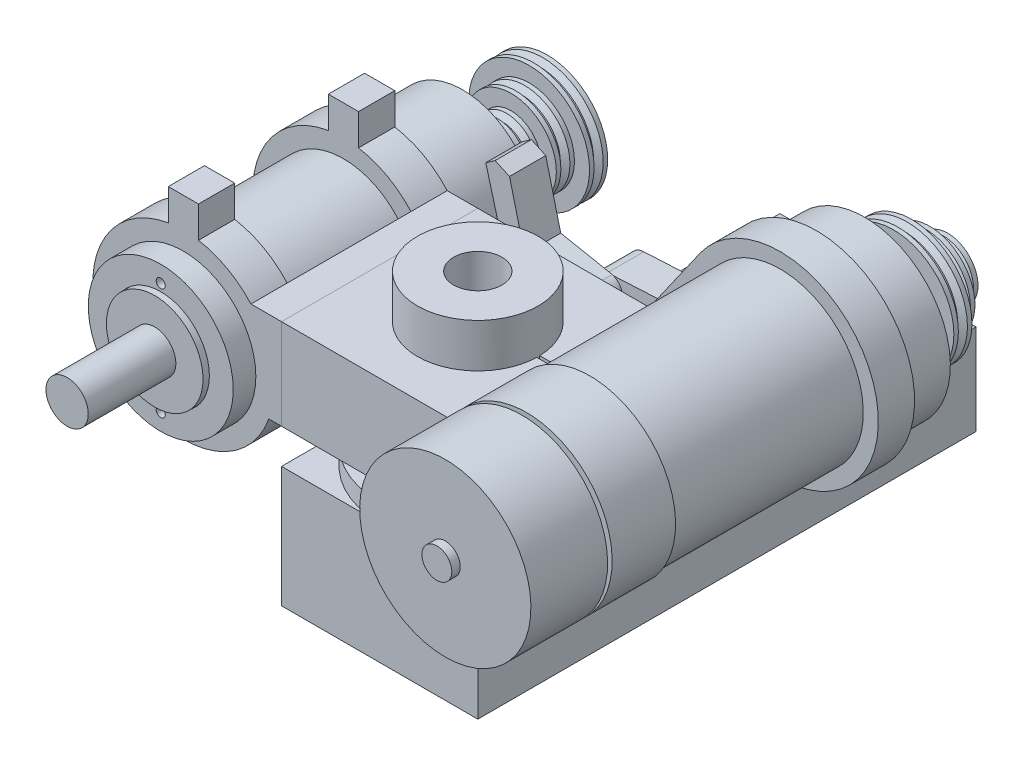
ISO-10303-21;
HEADER;
FILE_DESCRIPTION(('STEP AP214'),'2;1');
FILE_NAME('part.step','',(''),(''),'','','');
FILE_SCHEMA(('AUTOMOTIVE_DESIGN { 1 0 10303 214 1 1 1 1 }'));
ENDSEC;
DATA;
#1=APPLICATION_CONTEXT('core data for automotive mechanical design processes');
#2=APPLICATION_PROTOCOL_DEFINITION('international standard','automotive_design',2000,#1);
#3=PRODUCT_CONTEXT('',#1,'mechanical');
#4=PRODUCT('Part','Part','',(#3));
#5=PRODUCT_RELATED_PRODUCT_CATEGORY('part','',(#4));
#6=PRODUCT_DEFINITION_FORMATION('','',#4);
#7=PRODUCT_DEFINITION_CONTEXT('part definition',#1,'design');
#8=PRODUCT_DEFINITION('design','',#6,#7);
#9=PRODUCT_DEFINITION_SHAPE('','',#8);
#10=(LENGTH_UNIT() NAMED_UNIT(*) SI_UNIT(.MILLI.,.METRE.));
#11=(NAMED_UNIT(*) PLANE_ANGLE_UNIT() SI_UNIT($,.RADIAN.));
#12=(NAMED_UNIT(*) SI_UNIT($,.STERADIAN.) SOLID_ANGLE_UNIT());
#13=UNCERTAINTY_MEASURE_WITH_UNIT(LENGTH_MEASURE(1.E-05),#10,'distance_accuracy_value','');
#14=(GEOMETRIC_REPRESENTATION_CONTEXT(3) GLOBAL_UNCERTAINTY_ASSIGNED_CONTEXT((#13)) GLOBAL_UNIT_ASSIGNED_CONTEXT((#10,
#11,#12)) REPRESENTATION_CONTEXT('',''));
#15=CARTESIAN_POINT('',(0.,0.,0.));
#16=DIRECTION('',(0.,0.,1.));
#17=DIRECTION('',(1.,0.,0.));
#18=AXIS2_PLACEMENT_3D('',#15,#16,#17);
#19=CARTESIAN_POINT('',(-1.70405411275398,32.5039345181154,-56.5));
#20=DIRECTION('',(0.0523541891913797,-0.998628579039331,0.));
#21=DIRECTION('',(0.998628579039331,0.0523541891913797,0.));
#22=AXIS2_PLACEMENT_3D('',#19,#20,#21);
#23=PLANE('',#22);
#24=DIRECTION('',(0.998628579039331,0.0523541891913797,0.));
#25=VECTOR('',#24,1.);
#26=CARTESIAN_POINT('',(-1.70405411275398,32.5039345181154,-44.5));
#27=LINE('',#26,#25);
#28=CARTESIAN_POINT('',(-1.55817434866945,32.5115824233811,-44.5));
#29=VERTEX_POINT('',#28);
#30=CARTESIAN_POINT('',(36.2863595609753,34.4956232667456,-44.5));
#31=VERTEX_POINT('',#30);
#32=EDGE_CURVE('E117',#29,#31,#27,.T.);
#33=ORIENTED_EDGE('',*,*,#32,.T.);
#34=DIRECTION('',(0.,0.,1.));
#35=VECTOR('',#34,1.);
#36=CARTESIAN_POINT('',(36.2863595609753,34.4956232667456,-56.5));
#37=LINE('',#36,#35);
#38=CARTESIAN_POINT('',(36.2863595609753,34.4956232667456,-56.5));
#39=VERTEX_POINT('',#38);
#40=EDGE_CURVE('E12',#39,#31,#37,.T.);
#41=ORIENTED_EDGE('',*,*,#40,.F.);
#42=DIRECTION('',(0.998628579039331,0.0523541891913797,0.));
#43=VECTOR('',#42,1.);
#44=CARTESIAN_POINT('',(-1.70405411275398,32.5039345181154,-56.5));
#45=LINE('',#44,#43);
#46=CARTESIAN_POINT('',(-1.55817434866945,32.5115824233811,-56.5));
#47=VERTEX_POINT('',#46);
#48=EDGE_CURVE('E105',#47,#39,#45,.T.);
#49=ORIENTED_EDGE('',*,*,#48,.F.);
#50=DIRECTION('',(0.,0.,1.));
#51=VECTOR('',#50,1.);
#52=CARTESIAN_POINT('',(-1.55817434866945,32.5115824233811,-56.5));
#53=LINE('',#52,#51);
#54=EDGE_CURVE('E113',#47,#29,#53,.T.);
#55=ORIENTED_EDGE('',*,*,#54,.T.);
#56=EDGE_LOOP('',(#33,#41,#49,#55));
#57=FACE_BOUND('',#56,.T.);
#58=ADVANCED_FACE('F54',(#57),#23,.F.);
#59=CARTESIAN_POINT('',(36.2863595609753,28.9976178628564,-56.5));
#60=DIRECTION('',(0.,0.,1.));
#61=DIRECTION('',(1.,0.,0.));
#62=AXIS2_PLACEMENT_3D('',#59,#60,#61);
#63=CYLINDRICAL_SURFACE('',#62,5.49800540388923);
#64=CARTESIAN_POINT('',(36.2863595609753,28.9976178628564,-44.5));
#65=DIRECTION('',(0.,0.,-1.));
#66=DIRECTION('',(-1.,0.,0.));
#67=AXIS2_PLACEMENT_3D('',#64,#65,#66);
#68=CIRCLE('',#67,5.49800540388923);
#69=CARTESIAN_POINT('',(36.2863595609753,23.4996124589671,-44.5));
#70=VERTEX_POINT('',#69);
#71=EDGE_CURVE('E109',#31,#70,#68,.T.);
#72=ORIENTED_EDGE('',*,*,#71,.T.);
#73=DIRECTION('',(0.,0.,1.));
#74=VECTOR('',#73,1.);
#75=CARTESIAN_POINT('',(36.2863595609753,23.4996124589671,-56.5));
#76=LINE('',#75,#74);
#77=CARTESIAN_POINT('',(36.2863595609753,23.4996124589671,-56.5));
#78=VERTEX_POINT('',#77);
#79=EDGE_CURVE('E62',#78,#70,#76,.T.);
#80=ORIENTED_EDGE('',*,*,#79,.F.);
#81=CARTESIAN_POINT('',(36.2863595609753,28.9976178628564,-56.5));
#82=DIRECTION('',(0.,0.,-1.));
#83=DIRECTION('',(-1.,0.,0.));
#84=AXIS2_PLACEMENT_3D('',#81,#82,#83);
#85=CIRCLE('',#84,5.49800540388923);
#86=EDGE_CURVE('E100',#39,#78,#85,.T.);
#87=ORIENTED_EDGE('',*,*,#86,.F.);
#88=ORIENTED_EDGE('',*,*,#40,.T.);
#89=EDGE_LOOP('',(#72,#80,#87,#88));
#90=FACE_BOUND('',#89,.T.);
#91=ADVANCED_FACE('F108',(#90),#63,.T.);
#92=CARTESIAN_POINT('',(0.,23.4996124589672,-56.5));
#93=DIRECTION('',(0.,1.,0.));
#94=DIRECTION('',(-1.,0.,0.));
#95=AXIS2_PLACEMENT_3D('',#92,#93,#94);
#96=PLANE('',#95);
#97=DIRECTION('',(-1.,0.,0.));
#98=VECTOR('',#97,1.);
#99=CARTESIAN_POINT('',(0.,23.4996124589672,-44.5));
#100=LINE('',#99,#98);
#101=CARTESIAN_POINT('',(-1.55817434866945,23.4996124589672,-44.5));
#102=VERTEX_POINT('',#101);
#103=EDGE_CURVE('E87',#70,#102,#100,.T.);
#104=ORIENTED_EDGE('',*,*,#103,.T.);
#105=DIRECTION('',(0.,0.,1.));
#106=VECTOR('',#105,1.);
#107=CARTESIAN_POINT('',(-1.55817434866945,23.4996124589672,-56.5));
#108=LINE('',#107,#106);
#109=CARTESIAN_POINT('',(-1.55817434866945,23.4996124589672,-56.5));
#110=VERTEX_POINT('',#109);
#111=EDGE_CURVE('E110',#110,#102,#108,.T.);
#112=ORIENTED_EDGE('',*,*,#111,.F.);
#113=DIRECTION('',(-1.,0.,0.));
#114=VECTOR('',#113,1.);
#115=CARTESIAN_POINT('',(0.,23.4996124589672,-56.5));
#116=LINE('',#115,#114);
#117=EDGE_CURVE('E103',#78,#110,#116,.T.);
#118=ORIENTED_EDGE('',*,*,#117,.F.);
#119=ORIENTED_EDGE('',*,*,#79,.T.);
#120=EDGE_LOOP('',(#104,#112,#118,#119));
#121=FACE_BOUND('',#120,.T.);
#122=ADVANCED_FACE('F111',(#121),#96,.F.);
#123=CARTESIAN_POINT('',(-1.55817434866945,28.0055974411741,-56.5));
#124=DIRECTION('',(0.,0.,1.));
#125=DIRECTION('',(1.,0.,0.));
#126=AXIS2_PLACEMENT_3D('',#123,#124,#125);
#127=CYLINDRICAL_SURFACE('',#126,4.50598498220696);
#128=CARTESIAN_POINT('',(-1.55817434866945,28.0055974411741,-44.5));
#129=DIRECTION('',(0.,0.,-1.));
#130=DIRECTION('',(-1.,0.,0.));
#131=AXIS2_PLACEMENT_3D('',#128,#129,#130);
#132=CIRCLE('',#131,4.50598498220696);
#133=EDGE_CURVE('E93',#102,#29,#132,.T.);
#134=ORIENTED_EDGE('',*,*,#133,.T.);
#135=ORIENTED_EDGE('',*,*,#54,.F.);
#136=CARTESIAN_POINT('',(-1.55817434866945,28.0055974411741,-56.5));
#137=DIRECTION('',(0.,0.,-1.));
#138=DIRECTION('',(-1.,0.,0.));
#139=AXIS2_PLACEMENT_3D('',#136,#137,#138);
#140=CIRCLE('',#139,4.50598498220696);
#141=EDGE_CURVE('E70',#110,#47,#140,.T.);
#142=ORIENTED_EDGE('',*,*,#141,.F.);
#143=ORIENTED_EDGE('',*,*,#111,.T.);
#144=EDGE_LOOP('',(#134,#135,#142,#143));
#145=FACE_BOUND('',#144,.T.);
#146=ADVANCED_FACE('F124',(#145),#127,.T.);
#147=CARTESIAN_POINT('',(0.,0.,-56.5));
#148=DIRECTION('',(0.,0.,-1.));
#149=DIRECTION('',(-1.,0.,0.));
#150=AXIS2_PLACEMENT_3D('',#147,#148,#149);
#151=PLANE('',#150);
#152=ORIENTED_EDGE('',*,*,#48,.T.);
#153=ORIENTED_EDGE('',*,*,#86,.T.);
#154=ORIENTED_EDGE('',*,*,#117,.T.);
#155=ORIENTED_EDGE('',*,*,#141,.T.);
#156=EDGE_LOOP('',(#152,#153,#154,#155));
#157=FACE_BOUND('',#156,.T.);
#158=ADVANCED_FACE('F101',(#157),#151,.T.);
#159=CARTESIAN_POINT('',(0.,0.,-44.5));
#160=DIRECTION('',(0.,0.,-1.));
#161=DIRECTION('',(-1.,0.,0.));
#162=AXIS2_PLACEMENT_3D('',#159,#160,#161);
#163=PLANE('',#162);
#164=ORIENTED_EDGE('',*,*,#32,.F.);
#165=ORIENTED_EDGE('',*,*,#133,.F.);
#166=ORIENTED_EDGE('',*,*,#103,.F.);
#167=ORIENTED_EDGE('',*,*,#71,.F.);
#168=EDGE_LOOP('',(#164,#165,#166,#167));
#169=FACE_BOUND('',#168,.T.);
#170=ADVANCED_FACE('F127',(#169),#163,.F.);
#171=CLOSED_SHELL('',(#58,#91,#122,#146,#158,#170));
#172=MANIFOLD_SOLID_BREP('B2',#171);
#173=CARTESIAN_POINT('',(-0.592568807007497,10.1324008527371,-44.5));
#174=DIRECTION('',(-0.0583828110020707,0.998294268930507,0.));
#175=DIRECTION('',(-0.998294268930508,-0.0583828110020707,0.));
#176=AXIS2_PLACEMENT_3D('',#173,#174,#175);
#177=PLANE('',#176);
#178=DIRECTION('',(-0.998294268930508,-0.0583828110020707,0.));
#179=VECTOR('',#178,1.);
#180=CARTESIAN_POINT('',(-0.592568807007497,10.1324008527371,-32.5));
#181=LINE('',#180,#179);
#182=CARTESIAN_POINT('',(69.52879614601,14.2332782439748,-32.5));
#183=VERTEX_POINT('',#182);
#184=CARTESIAN_POINT('',(23.0838281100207,11.5170573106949,-32.5));
#185=VERTEX_POINT('',#184);
#186=EDGE_CURVE('E271',#183,#185,#181,.T.);
#187=ORIENTED_EDGE('',*,*,#186,.T.);
#188=DIRECTION('',(0.,0.,1.));
#189=VECTOR('',#188,1.);
#190=CARTESIAN_POINT('',(23.0838281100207,11.5170573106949,-44.5));
#191=LINE('',#190,#189);
#192=CARTESIAN_POINT('',(23.0838281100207,11.5170573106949,-44.5));
#193=VERTEX_POINT('',#192);
#194=EDGE_CURVE('E52',#193,#185,#191,.T.);
#195=ORIENTED_EDGE('',*,*,#194,.F.);
#196=DIRECTION('',(-0.998294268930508,-0.0583828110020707,0.));
#197=VECTOR('',#196,1.);
#198=CARTESIAN_POINT('',(-0.592568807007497,10.1324008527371,-44.5));
#199=LINE('',#198,#197);
#200=CARTESIAN_POINT('',(69.52879614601,14.2332782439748,-44.5));
#201=VERTEX_POINT('',#200);
#202=EDGE_CURVE('E253',#201,#193,#199,.T.);
#203=ORIENTED_EDGE('',*,*,#202,.F.);
#204=DIRECTION('',(0.,0.,1.));
#205=VECTOR('',#204,1.);
#206=CARTESIAN_POINT('',(69.52879614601,14.2332782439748,-44.5));
#207=LINE('',#206,#205);
#208=EDGE_CURVE('E270',#201,#183,#207,.T.);
#209=ORIENTED_EDGE('',*,*,#208,.T.);
#210=EDGE_LOOP('',(#187,#195,#203,#209));
#211=FACE_BOUND('',#210,.T.);
#212=ADVANCED_FACE('F205',(#211),#177,.F.);
#213=CARTESIAN_POINT('',(22.5,21.5,-44.5));
#214=DIRECTION('',(0.,0.,1.));
#215=DIRECTION('',(1.,0.,0.));
#216=AXIS2_PLACEMENT_3D('',#213,#214,#215);
#217=CYLINDRICAL_SURFACE('',#216,10.);
#218=CARTESIAN_POINT('',(22.5,21.5,-32.5));
#219=DIRECTION('',(0.,0.,-1.));
#220=DIRECTION('',(-1.,0.,0.));
#221=AXIS2_PLACEMENT_3D('',#218,#219,#220);
#222=CIRCLE('',#221,10.);
#223=CARTESIAN_POINT('',(14.3119365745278,27.2406983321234,-32.5));
#224=VERTEX_POINT('',#223);
#225=EDGE_CURVE('E258',#185,#224,#222,.T.);
#226=ORIENTED_EDGE('',*,*,#225,.T.);
#227=DIRECTION('',(0.,0.,1.));
#228=VECTOR('',#227,1.);
#229=CARTESIAN_POINT('',(14.3119365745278,27.2406983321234,-44.5));
#230=LINE('',#229,#228);
#231=CARTESIAN_POINT('',(14.3119365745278,27.2406983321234,-44.5));
#232=VERTEX_POINT('',#231);
#233=EDGE_CURVE('E213',#232,#224,#230,.T.);
#234=ORIENTED_EDGE('',*,*,#233,.F.);
#235=CARTESIAN_POINT('',(22.5,21.5,-44.5));
#236=DIRECTION('',(0.,0.,-1.));
#237=DIRECTION('',(-1.,0.,0.));
#238=AXIS2_PLACEMENT_3D('',#235,#236,#237);
#239=CIRCLE('',#238,10.);
#240=EDGE_CURVE('E247',#193,#232,#239,.T.);
#241=ORIENTED_EDGE('',*,*,#240,.F.);
#242=ORIENTED_EDGE('',*,*,#194,.T.);
#243=EDGE_LOOP('',(#226,#234,#241,#242));
#244=FACE_BOUND('',#243,.T.);
#245=ADVANCED_FACE('F257',(#244),#217,.T.);
#246=CARTESIAN_POINT('',(-3.20919576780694,2.24998559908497,-44.5));
#247=DIRECTION('',(-0.81880634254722,0.574069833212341,0.));
#248=DIRECTION('',(-0.574069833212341,-0.81880634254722,0.));
#249=AXIS2_PLACEMENT_3D('',#246,#247,#248);
#250=PLANE('',#249);
#251=DIRECTION('',(-0.574069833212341,-0.81880634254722,0.));
#252=VECTOR('',#251,1.);
#253=CARTESIAN_POINT('',(-3.20919576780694,2.24998559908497,-32.5));
#254=LINE('',#253,#252);
#255=CARTESIAN_POINT('',(41.020148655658,65.3351115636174,-32.5));
#256=VERTEX_POINT('',#255);
#257=EDGE_CURVE('E275',#256,#224,#254,.T.);
#258=ORIENTED_EDGE('',*,*,#257,.F.);
#259=DIRECTION('',(0.,0.,1.));
#260=VECTOR('',#259,1.);
#261=CARTESIAN_POINT('',(41.020148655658,65.3351115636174,-44.5));
#262=LINE('',#261,#260);
#263=CARTESIAN_POINT('',(41.020148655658,65.3351115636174,-44.5));
#264=VERTEX_POINT('',#263);
#265=EDGE_CURVE('E237',#264,#256,#262,.T.);
#266=ORIENTED_EDGE('',*,*,#265,.F.);
#267=DIRECTION('',(-0.574069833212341,-0.81880634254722,0.));
#268=VECTOR('',#267,1.);
#269=CARTESIAN_POINT('',(-3.20919576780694,2.24998559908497,-44.5));
#270=LINE('',#269,#268);
#271=EDGE_CURVE('E251',#264,#232,#270,.T.);
#272=ORIENTED_EDGE('',*,*,#271,.T.);
#273=ORIENTED_EDGE('',*,*,#233,.T.);
#274=EDGE_LOOP('',(#258,#266,#272,#273));
#275=FACE_BOUND('',#274,.T.);
#276=ADVANCED_FACE('F262',(#275),#250,.T.);
#277=CARTESIAN_POINT('',(67.6313547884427,46.6778419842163,-44.5));
#278=DIRECTION('',(0.,0.,1.));
#279=DIRECTION('',(1.,0.,0.));
#280=AXIS2_PLACEMENT_3D('',#277,#278,#279);
#281=CYLINDRICAL_SURFACE('',#280,32.5);
#282=CARTESIAN_POINT('',(67.6313547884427,46.6778419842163,-32.5));
#283=DIRECTION('',(0.,0.,-1.));
#284=DIRECTION('',(-1.,0.,0.));
#285=AXIS2_PLACEMENT_3D('',#282,#283,#284);
#286=CIRCLE('',#285,32.5);
#287=EDGE_CURVE('E240',#256,#183,#286,.T.);
#288=ORIENTED_EDGE('',*,*,#287,.T.);
#289=ORIENTED_EDGE('',*,*,#208,.F.);
#290=CARTESIAN_POINT('',(67.6313547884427,46.6778419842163,-44.5));
#291=DIRECTION('',(0.,0.,-1.));
#292=DIRECTION('',(-1.,0.,0.));
#293=AXIS2_PLACEMENT_3D('',#290,#291,#292);
#294=CIRCLE('',#293,32.5);
#295=EDGE_CURVE('E221',#264,#201,#294,.T.);
#296=ORIENTED_EDGE('',*,*,#295,.F.);
#297=ORIENTED_EDGE('',*,*,#265,.T.);
#298=EDGE_LOOP('',(#288,#289,#296,#297));
#299=FACE_BOUND('',#298,.T.);
#300=ADVANCED_FACE('F293',(#299),#281,.T.);
#301=CARTESIAN_POINT('',(67.6313547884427,46.6778419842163,-44.5));
#302=DIRECTION('',(0.,0.,1.));
#303=DIRECTION('',(1.,0.,0.));
#304=AXIS2_PLACEMENT_3D('',#301,#302,#303);
#305=CYLINDRICAL_SURFACE('',#304,27.5);
#306=CARTESIAN_POINT('',(67.6313547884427,46.6778419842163,-44.5));
#307=DIRECTION('',(0.,0.,-1.));
#308=DIRECTION('',(-1.,0.,0.));
#309=AXIS2_PLACEMENT_3D('',#306,#307,#308);
#310=CIRCLE('',#309,27.5);
#311=CARTESIAN_POINT('',(40.1313547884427,46.6778419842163,-44.5));
#312=VERTEX_POINT('',#311);
#313=EDGE_CURVE('E264',#312,#312,#310,.T.);
#314=ORIENTED_EDGE('',*,*,#313,.T.);
#315=EDGE_LOOP('',(#314));
#316=FACE_BOUND('',#315,.T.);
#317=CARTESIAN_POINT('',(67.6313547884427,46.6778419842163,-32.5));
#318=DIRECTION('',(0.,0.,-1.));
#319=DIRECTION('',(-1.,0.,0.));
#320=AXIS2_PLACEMENT_3D('',#317,#318,#319);
#321=CIRCLE('',#320,27.5);
#322=CARTESIAN_POINT('',(40.1313547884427,46.6778419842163,-32.5));
#323=VERTEX_POINT('',#322);
#324=EDGE_CURVE('E278',#323,#323,#321,.T.);
#325=ORIENTED_EDGE('',*,*,#324,.F.);
#326=EDGE_LOOP('',(#325));
#327=FACE_BOUND('',#326,.T.);
#328=ADVANCED_FACE('F291',(#316,#327),#305,.F.);
#329=CARTESIAN_POINT('',(0.,0.,-44.5));
#330=DIRECTION('',(0.,0.,-1.));
#331=DIRECTION('',(-1.,0.,0.));
#332=AXIS2_PLACEMENT_3D('',#329,#330,#331);
#333=PLANE('',#332);
#334=ORIENTED_EDGE('',*,*,#202,.T.);
#335=ORIENTED_EDGE('',*,*,#240,.T.);
#336=ORIENTED_EDGE('',*,*,#271,.F.);
#337=ORIENTED_EDGE('',*,*,#295,.T.);
#338=EDGE_LOOP('',(#334,#335,#336,#337));
#339=FACE_BOUND('',#338,.T.);
#340=ORIENTED_EDGE('',*,*,#313,.F.);
#341=EDGE_LOOP('',(#340));
#342=FACE_BOUND('',#341,.T.);
#343=ADVANCED_FACE('F248',(#339,#342),#333,.T.);
#344=CARTESIAN_POINT('',(0.,0.,-32.5));
#345=DIRECTION('',(0.,0.,-1.));
#346=DIRECTION('',(-1.,0.,0.));
#347=AXIS2_PLACEMENT_3D('',#344,#345,#346);
#348=PLANE('',#347);
#349=ORIENTED_EDGE('',*,*,#186,.F.);
#350=ORIENTED_EDGE('',*,*,#287,.F.);
#351=ORIENTED_EDGE('',*,*,#257,.T.);
#352=ORIENTED_EDGE('',*,*,#225,.F.);
#353=EDGE_LOOP('',(#349,#350,#351,#352));
#354=FACE_BOUND('',#353,.T.);
#355=ORIENTED_EDGE('',*,*,#324,.T.);
#356=EDGE_LOOP('',(#355));
#357=FACE_BOUND('',#356,.T.);
#358=ADVANCED_FACE('F285',(#354,#357),#348,.F.);
#359=CLOSED_SHELL('',(#212,#245,#276,#300,#328,#343,#358));
#360=MANIFOLD_SOLID_BREP('B6',#359);
#361=CARTESIAN_POINT('',(-65.,21.5,126.341621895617));
#362=DIRECTION('',(0.,0.,-1.));
#363=DIRECTION('',(-1.,0.,0.));
#364=AXIS2_PLACEMENT_3D('',#361,#362,#363);
#365=CYLINDRICAL_SURFACE('',#364,30.);
#366=CARTESIAN_POINT('',(-65.,21.5,-20.5));
#367=DIRECTION('',(0.,0.,-1.));
#368=DIRECTION('',(-1.,0.,0.));
#369=AXIS2_PLACEMENT_3D('',#366,#367,#368);
#370=CIRCLE('',#369,30.);
#371=CARTESIAN_POINT('',(-60.,51.0803989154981,-20.5));
#372=VERTEX_POINT('',#371);
#373=CARTESIAN_POINT('',(-42.6393202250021,41.5,-20.5));
#374=VERTEX_POINT('',#373);
#375=EDGE_CURVE('E592',#372,#374,#370,.T.);
#376=ORIENTED_EDGE('',*,*,#375,.T.);
#377=DIRECTION('',(0.,0.,-1.));
#378=VECTOR('',#377,1.);
#379=CARTESIAN_POINT('',(-42.6393202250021,41.5,126.341621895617));
#380=LINE('',#379,#378);
#381=CARTESIAN_POINT('',(-42.6393202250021,41.5,-32.5));
#382=VERTEX_POINT('',#381);
#383=EDGE_CURVE('E536',#374,#382,#380,.T.);
#384=ORIENTED_EDGE('',*,*,#383,.T.);
#385=CARTESIAN_POINT('',(-65.,21.5,-32.5));
#386=DIRECTION('',(0.,0.,-1.));
#387=DIRECTION('',(-1.,0.,0.));
#388=AXIS2_PLACEMENT_3D('',#385,#386,#387);
#389=CIRCLE('',#388,30.);
#390=CARTESIAN_POINT('',(-60.,51.0803989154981,-32.5));
#391=VERTEX_POINT('',#390);
#392=EDGE_CURVE('E569',#391,#382,#389,.T.);
#393=ORIENTED_EDGE('',*,*,#392,.F.);
#394=DIRECTION('',(0.,0.,-1.));
#395=VECTOR('',#394,1.);
#396=CARTESIAN_POINT('',(-60.,51.0803989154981,126.341621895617));
#397=LINE('',#396,#395);
#398=EDGE_CURVE('E531',#372,#391,#397,.T.);
#399=ORIENTED_EDGE('',*,*,#398,.F.);
#400=EDGE_LOOP('',(#376,#384,#393,#399));
#401=FACE_BOUND('',#400,.T.);
#402=ADVANCED_FACE('F389',(#401),#365,.T.);
#403=CARTESIAN_POINT('',(-60.0000000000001,1.19870318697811E-13,126.341621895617));
#404=DIRECTION('',(1.,0.,0.));
#405=DIRECTION('',(0.,1.,0.));
#406=AXIS2_PLACEMENT_3D('',#403,#404,#405);
#407=PLANE('',#406);
#408=DIRECTION('',(0.,-1.,0.));
#409=VECTOR('',#408,1.);
#410=CARTESIAN_POINT('',(-60.0000000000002,-40.0010000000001,-20.5));
#411=LINE('',#410,#409);
#412=CARTESIAN_POINT('',(-60.,61.5,-20.5));
#413=VERTEX_POINT('',#412);
#414=EDGE_CURVE('E498',#413,#372,#411,.T.);
#415=ORIENTED_EDGE('',*,*,#414,.T.);
#416=ORIENTED_EDGE('',*,*,#398,.T.);
#417=DIRECTION('',(0.,-1.,0.));
#418=VECTOR('',#417,1.);
#419=CARTESIAN_POINT('',(-60.0000000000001,1.19870318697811E-13,-32.5));
#420=LINE('',#419,#418);
#421=CARTESIAN_POINT('',(-60.,61.5,-32.5));
#422=VERTEX_POINT('',#421);
#423=EDGE_CURVE('E565',#422,#391,#420,.T.);
#424=ORIENTED_EDGE('',*,*,#423,.F.);
#425=DIRECTION('',(0.,0.,-1.));
#426=VECTOR('',#425,1.);
#427=CARTESIAN_POINT('',(-60.,61.5,126.341621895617));
#428=LINE('',#427,#426);
#429=EDGE_CURVE('E527',#413,#422,#428,.T.);
#430=ORIENTED_EDGE('',*,*,#429,.F.);
#431=EDGE_LOOP('',(#415,#416,#424,#430));
#432=FACE_BOUND('',#431,.T.);
#433=ADVANCED_FACE('F618',(#432),#407,.T.);
#434=CARTESIAN_POINT('',(0.,61.5,126.341621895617));
#435=DIRECTION('',(0.,-1.,0.));
#436=DIRECTION('',(0.,0.,-1.));
#437=AXIS2_PLACEMENT_3D('',#434,#435,#436);
#438=PLANE('',#437);
#439=DIRECTION('',(0.,0.,-1.));
#440=VECTOR('',#439,1.);
#441=CARTESIAN_POINT('',(-70.,61.5,126.341621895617));
#442=LINE('',#441,#440);
#443=CARTESIAN_POINT('',(-70.,61.5,-20.5));
#444=VERTEX_POINT('',#443);
#445=CARTESIAN_POINT('',(-70.,61.5,-32.5));
#446=VERTEX_POINT('',#445);
#447=EDGE_CURVE('E509',#444,#446,#442,.T.);
#448=ORIENTED_EDGE('',*,*,#447,.F.);
#449=DIRECTION('',(-1.,0.,0.));
#450=VECTOR('',#449,1.);
#451=CARTESIAN_POINT('',(-95.,61.5,-20.5));
#452=LINE('',#451,#450);
#453=EDGE_CURVE('E491',#413,#444,#452,.T.);
#454=ORIENTED_EDGE('',*,*,#453,.F.);
#455=ORIENTED_EDGE('',*,*,#429,.T.);
#456=DIRECTION('',(-1.,0.,0.));
#457=VECTOR('',#456,1.);
#458=CARTESIAN_POINT('',(0.,61.5,-32.5));
#459=LINE('',#458,#457);
#460=EDGE_CURVE('E517',#422,#446,#459,.T.);
#461=ORIENTED_EDGE('',*,*,#460,.T.);
#462=EDGE_LOOP('',(#448,#454,#455,#461));
#463=FACE_BOUND('',#462,.T.);
#464=ADVANCED_FACE('F515',(#463),#438,.F.);
#465=CARTESIAN_POINT('',(-69.9999999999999,0.,126.341621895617));
#466=DIRECTION('',(1.,0.,0.));
#467=DIRECTION('',(0.,1.,0.));
#468=AXIS2_PLACEMENT_3D('',#465,#466,#467);
#469=PLANE('',#468);
#470=DIRECTION('',(0.,0.,-1.));
#471=VECTOR('',#470,1.);
#472=CARTESIAN_POINT('',(-70.,51.0803989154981,126.341621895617));
#473=LINE('',#472,#471);
#474=CARTESIAN_POINT('',(-70.,51.0803989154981,-20.5));
#475=VERTEX_POINT('',#474);
#476=CARTESIAN_POINT('',(-70.,51.0803989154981,-32.5));
#477=VERTEX_POINT('',#476);
#478=EDGE_CURVE('E511',#475,#477,#473,.T.);
#479=ORIENTED_EDGE('',*,*,#478,.F.);
#480=DIRECTION('',(0.,-1.,0.));
#481=VECTOR('',#480,1.);
#482=CARTESIAN_POINT('',(-69.9999999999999,-40.001,-20.5));
#483=LINE('',#482,#481);
#484=EDGE_CURVE('E495',#444,#475,#483,.T.);
#485=ORIENTED_EDGE('',*,*,#484,.F.);
#486=ORIENTED_EDGE('',*,*,#447,.T.);
#487=DIRECTION('',(0.,-1.,0.));
#488=VECTOR('',#487,1.);
#489=CARTESIAN_POINT('',(-69.9999999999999,0.,-32.5));
#490=LINE('',#489,#488);
#491=EDGE_CURVE('E521',#446,#477,#490,.T.);
#492=ORIENTED_EDGE('',*,*,#491,.T.);
#493=EDGE_LOOP('',(#479,#485,#486,#492));
#494=FACE_BOUND('',#493,.T.);
#495=ADVANCED_FACE('F507',(#494),#469,.F.);
#496=CARTESIAN_POINT('',(-65.,21.5,126.341621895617));
#497=DIRECTION('',(0.,0.,-1.));
#498=DIRECTION('',(-1.,0.,0.));
#499=AXIS2_PLACEMENT_3D('',#496,#497,#498);
#500=CYLINDRICAL_SURFACE('',#499,30.);
#501=CARTESIAN_POINT('',(-65.,21.5,-20.5));
#502=DIRECTION('',(0.,0.,-1.));
#503=DIRECTION('',(-1.,0.,0.));
#504=AXIS2_PLACEMENT_3D('',#501,#502,#503);
#505=CIRCLE('',#504,30.);
#506=CARTESIAN_POINT('',(-42.6393202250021,1.5,-20.5));
#507=VERTEX_POINT('',#506);
#508=EDGE_CURVE('E587',#507,#475,#505,.T.);
#509=ORIENTED_EDGE('',*,*,#508,.T.);
#510=ORIENTED_EDGE('',*,*,#478,.T.);
#511=CARTESIAN_POINT('',(-65.,21.5,-32.5));
#512=DIRECTION('',(0.,0.,-1.));
#513=DIRECTION('',(-1.,0.,0.));
#514=AXIS2_PLACEMENT_3D('',#511,#512,#513);
#515=CIRCLE('',#514,30.);
#516=CARTESIAN_POINT('',(-36.7157287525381,11.5,-32.5));
#517=VERTEX_POINT('',#516);
#518=EDGE_CURVE('E562',#517,#477,#515,.T.);
#519=ORIENTED_EDGE('',*,*,#518,.F.);
#520=DIRECTION('',(0.,0.,-1.));
#521=VECTOR('',#520,1.);
#522=CARTESIAN_POINT('',(-36.7157287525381,11.5,126.341621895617));
#523=LINE('',#522,#521);
#524=CARTESIAN_POINT('',(-36.7157287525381,11.5,32.5));
#525=VERTEX_POINT('',#524);
#526=EDGE_CURVE('E543',#525,#517,#523,.T.);
#527=ORIENTED_EDGE('',*,*,#526,.F.);
#528=CARTESIAN_POINT('',(-65.,21.5,32.5));
#529=DIRECTION('',(0.,0.,1.));
#530=DIRECTION('',(1.,0.,0.));
#531=AXIS2_PLACEMENT_3D('',#528,#529,#530);
#532=CIRCLE('',#531,30.);
#533=CARTESIAN_POINT('',(-70.,51.0803989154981,32.5));
#534=VERTEX_POINT('',#533);
#535=EDGE_CURVE('E546',#525,#534,#532,.F.);
#536=ORIENTED_EDGE('',*,*,#535,.T.);
#537=CARTESIAN_POINT('',(-70.,51.0803989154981,20.5));
#538=VERTEX_POINT('',#537);
#539=EDGE_CURVE('E393',#534,#538,#473,.T.);
#540=ORIENTED_EDGE('',*,*,#539,.T.);
#541=CARTESIAN_POINT('',(-65.,21.5,20.5));
#542=DIRECTION('',(0.,0.,1.));
#543=DIRECTION('',(1.,0.,0.));
#544=AXIS2_PLACEMENT_3D('',#541,#542,#543);
#545=CIRCLE('',#544,30.);
#546=CARTESIAN_POINT('',(-42.6393202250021,1.5,20.5));
#547=VERTEX_POINT('',#546);
#548=EDGE_CURVE('E406',#538,#547,#545,.T.);
#549=ORIENTED_EDGE('',*,*,#548,.T.);
#550=DIRECTION('',(0.,0.,-1.));
#551=VECTOR('',#550,1.);
#552=CARTESIAN_POINT('',(-42.6393202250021,1.5,126.341621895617));
#553=LINE('',#552,#551);
#554=EDGE_CURVE('E589',#547,#507,#553,.T.);
#555=ORIENTED_EDGE('',*,*,#554,.T.);
#556=EDGE_LOOP('',(#509,#510,#519,#527,#536,#540,#549,#555));
#557=FACE_BOUND('',#556,.T.);
#558=ADVANCED_FACE('F648',(#557),#500,.T.);
#559=CARTESIAN_POINT('',(0.,11.5,126.341621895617));
#560=DIRECTION('',(0.,-1.,0.));
#561=DIRECTION('',(0.,0.,-1.));
#562=AXIS2_PLACEMENT_3D('',#559,#560,#561);
#563=PLANE('',#562);
#564=DIRECTION('',(0.,0.,-1.));
#565=VECTOR('',#564,1.);
#566=CARTESIAN_POINT('',(-32.5,11.5,126.341621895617));
#567=LINE('',#566,#565);
#568=CARTESIAN_POINT('',(-32.5,11.5,32.5));
#569=VERTEX_POINT('',#568);
#570=CARTESIAN_POINT('',(-32.5,11.5,-32.5));
#571=VERTEX_POINT('',#570);
#572=EDGE_CURVE('E541',#569,#571,#567,.T.);
#573=ORIENTED_EDGE('',*,*,#572,.F.);
#574=DIRECTION('',(-1.,0.,0.));
#575=VECTOR('',#574,1.);
#576=CARTESIAN_POINT('',(0.,11.5,32.5));
#577=LINE('',#576,#575);
#578=EDGE_CURVE('E544',#569,#525,#577,.T.);
#579=ORIENTED_EDGE('',*,*,#578,.T.);
#580=ORIENTED_EDGE('',*,*,#526,.T.);
#581=DIRECTION('',(-1.,0.,0.));
#582=VECTOR('',#581,1.);
#583=CARTESIAN_POINT('',(0.,11.5,-32.5));
#584=LINE('',#583,#582);
#585=EDGE_CURVE('E554',#571,#517,#584,.T.);
#586=ORIENTED_EDGE('',*,*,#585,.F.);
#587=EDGE_LOOP('',(#573,#579,#580,#586));
#588=FACE_BOUND('',#587,.T.);
#589=ADVANCED_FACE('F654',(#588),#563,.T.);
#590=CARTESIAN_POINT('',(-32.5,0.,126.341621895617));
#591=DIRECTION('',(-1.,0.,0.));
#592=DIRECTION('',(0.,0.,1.));
#593=AXIS2_PLACEMENT_3D('',#590,#591,#592);
#594=PLANE('',#593);
#595=DIRECTION('',(0.,1.,0.));
#596=VECTOR('',#595,1.);
#597=CARTESIAN_POINT('',(-32.5,0.,32.5));
#598=LINE('',#597,#596);
#599=CARTESIAN_POINT('',(-32.5,41.5,32.5));
#600=VERTEX_POINT('',#599);
#601=EDGE_CURVE('E550',#569,#600,#598,.T.);
#602=ORIENTED_EDGE('',*,*,#601,.F.);
#603=ORIENTED_EDGE('',*,*,#572,.T.);
#604=DIRECTION('',(0.,1.,0.));
#605=VECTOR('',#604,1.);
#606=CARTESIAN_POINT('',(-32.5,0.,-32.5));
#607=LINE('',#606,#605);
#608=CARTESIAN_POINT('',(-32.5,41.5,-32.5));
#609=VERTEX_POINT('',#608);
#610=EDGE_CURVE('E540',#571,#609,#607,.T.);
#611=ORIENTED_EDGE('',*,*,#610,.T.);
#612=DIRECTION('',(0.,0.,-1.));
#613=VECTOR('',#612,1.);
#614=CARTESIAN_POINT('',(-32.5,41.5,126.341621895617));
#615=LINE('',#614,#613);
#616=EDGE_CURVE('E537',#600,#609,#615,.T.);
#617=ORIENTED_EDGE('',*,*,#616,.F.);
#618=EDGE_LOOP('',(#602,#603,#611,#617));
#619=FACE_BOUND('',#618,.T.);
#620=ADVANCED_FACE('F657',(#619),#594,.F.);
#621=CARTESIAN_POINT('',(0.,41.5,126.341621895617));
#622=DIRECTION('',(0.,-1.,0.));
#623=DIRECTION('',(0.,0.,-1.));
#624=AXIS2_PLACEMENT_3D('',#621,#622,#623);
#625=PLANE('',#624);
#626=DIRECTION('',(-1.,0.,0.));
#627=VECTOR('',#626,1.);
#628=CARTESIAN_POINT('',(0.,41.5,32.5));
#629=LINE('',#628,#627);
#630=CARTESIAN_POINT('',(-42.6393202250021,41.5,32.5));
#631=VERTEX_POINT('',#630);
#632=EDGE_CURVE('E553',#600,#631,#629,.T.);
#633=ORIENTED_EDGE('',*,*,#632,.F.);
#634=ORIENTED_EDGE('',*,*,#616,.T.);
#635=DIRECTION('',(-1.,0.,0.));
#636=VECTOR('',#635,1.);
#637=CARTESIAN_POINT('',(0.,41.5,-32.5));
#638=LINE('',#637,#636);
#639=EDGE_CURVE('E539',#609,#382,#638,.T.);
#640=ORIENTED_EDGE('',*,*,#639,.T.);
#641=ORIENTED_EDGE('',*,*,#383,.F.);
#642=DIRECTION('',(0.,0.,-1.));
#643=VECTOR('',#642,1.);
#644=CARTESIAN_POINT('',(-42.6393202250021,41.5,126.341621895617));
#645=LINE('',#644,#643);
#646=CARTESIAN_POINT('',(-42.6393202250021,41.5,20.5));
#647=VERTEX_POINT('',#646);
#648=EDGE_CURVE('E599',#647,#374,#645,.T.);
#649=ORIENTED_EDGE('',*,*,#648,.F.);
#650=EDGE_CURVE('E532',#631,#647,#380,.T.);
#651=ORIENTED_EDGE('',*,*,#650,.F.);
#652=EDGE_LOOP('',(#633,#634,#640,#641,#649,#651));
#653=FACE_BOUND('',#652,.T.);
#654=ADVANCED_FACE('F610',(#653),#625,.F.);
#655=CARTESIAN_POINT('',(-65.,21.5,20.5));
#656=DIRECTION('',(0.,0.,1.));
#657=DIRECTION('',(1.,0.,0.));
#658=AXIS2_PLACEMENT_3D('',#655,#656,#657);
#659=CIRCLE('',#658,30.);
#660=CARTESIAN_POINT('',(-60.,51.0803989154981,20.5));
#661=VERTEX_POINT('',#660);
#662=EDGE_CURVE('E548',#647,#661,#659,.T.);
#663=ORIENTED_EDGE('',*,*,#662,.T.);
#664=CARTESIAN_POINT('',(-60.,51.0803989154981,32.5));
#665=VERTEX_POINT('',#664);
#666=EDGE_CURVE('E528',#665,#661,#397,.T.);
#667=ORIENTED_EDGE('',*,*,#666,.F.);
#668=CARTESIAN_POINT('',(-65.,21.5,32.5));
#669=DIRECTION('',(0.,0.,1.));
#670=DIRECTION('',(1.,0.,0.));
#671=AXIS2_PLACEMENT_3D('',#668,#669,#670);
#672=CIRCLE('',#671,30.);
#673=EDGE_CURVE('E557',#665,#631,#672,.F.);
#674=ORIENTED_EDGE('',*,*,#673,.T.);
#675=ORIENTED_EDGE('',*,*,#650,.T.);
#676=EDGE_LOOP('',(#663,#667,#674,#675));
#677=FACE_BOUND('',#676,.T.);
#678=ADVANCED_FACE('F629',(#677),#365,.T.);
#679=DIRECTION('',(0.,1.,0.));
#680=VECTOR('',#679,1.);
#681=CARTESIAN_POINT('',(-60.0000000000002,-40.0010000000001,20.5));
#682=LINE('',#681,#680);
#683=CARTESIAN_POINT('',(-60.,61.5,20.5));
#684=VERTEX_POINT('',#683);
#685=EDGE_CURVE('E512',#661,#684,#682,.T.);
#686=ORIENTED_EDGE('',*,*,#685,.T.);
#687=CARTESIAN_POINT('',(-60.,61.5,32.5));
#688=VERTEX_POINT('',#687);
#689=EDGE_CURVE('E522',#688,#684,#428,.T.);
#690=ORIENTED_EDGE('',*,*,#689,.F.);
#691=DIRECTION('',(0.,-1.,0.));
#692=VECTOR('',#691,1.);
#693=CARTESIAN_POINT('',(-60.0000000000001,1.19870318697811E-13,32.5));
#694=LINE('',#693,#692);
#695=EDGE_CURVE('E535',#688,#665,#694,.T.);
#696=ORIENTED_EDGE('',*,*,#695,.T.);
#697=ORIENTED_EDGE('',*,*,#666,.T.);
#698=EDGE_LOOP('',(#686,#690,#696,#697));
#699=FACE_BOUND('',#698,.T.);
#700=ADVANCED_FACE('F621',(#699),#407,.T.);
#701=ORIENTED_EDGE('',*,*,#689,.T.);
#702=DIRECTION('',(1.,0.,0.));
#703=VECTOR('',#702,1.);
#704=CARTESIAN_POINT('',(-95.,61.5,20.5));
#705=LINE('',#704,#703);
#706=CARTESIAN_POINT('',(-70.,61.5,20.5));
#707=VERTEX_POINT('',#706);
#708=EDGE_CURVE('E503',#707,#684,#705,.T.);
#709=ORIENTED_EDGE('',*,*,#708,.F.);
#710=CARTESIAN_POINT('',(-70.,61.5,32.5));
#711=VERTEX_POINT('',#710);
#712=EDGE_CURVE('E519',#711,#707,#442,.T.);
#713=ORIENTED_EDGE('',*,*,#712,.F.);
#714=DIRECTION('',(-1.,0.,0.));
#715=VECTOR('',#714,1.);
#716=CARTESIAN_POINT('',(0.,61.5,32.5));
#717=LINE('',#716,#715);
#718=EDGE_CURVE('E398',#688,#711,#717,.T.);
#719=ORIENTED_EDGE('',*,*,#718,.F.);
#720=EDGE_LOOP('',(#701,#709,#713,#719));
#721=FACE_BOUND('',#720,.T.);
#722=ADVANCED_FACE('F627',(#721),#438,.F.);
#723=ORIENTED_EDGE('',*,*,#712,.T.);
#724=DIRECTION('',(0.,1.,0.));
#725=VECTOR('',#724,1.);
#726=CARTESIAN_POINT('',(-69.9999999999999,-40.001,20.5));
#727=LINE('',#726,#725);
#728=EDGE_CURVE('E513',#538,#707,#727,.T.);
#729=ORIENTED_EDGE('',*,*,#728,.F.);
#730=ORIENTED_EDGE('',*,*,#539,.F.);
#731=DIRECTION('',(0.,-1.,0.));
#732=VECTOR('',#731,1.);
#733=CARTESIAN_POINT('',(-69.9999999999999,0.,32.5));
#734=LINE('',#733,#732);
#735=EDGE_CURVE('E203',#711,#534,#734,.T.);
#736=ORIENTED_EDGE('',*,*,#735,.F.);
#737=EDGE_LOOP('',(#723,#729,#730,#736));
#738=FACE_BOUND('',#737,.T.);
#739=ADVANCED_FACE('F636',(#738),#469,.F.);
#740=CARTESIAN_POINT('',(0.,0.,-32.5));
#741=DIRECTION('',(0.,0.,-1.));
#742=DIRECTION('',(-1.,0.,0.));
#743=AXIS2_PLACEMENT_3D('',#740,#741,#742);
#744=PLANE('',#743);
#745=ORIENTED_EDGE('',*,*,#518,.T.);
#746=ORIENTED_EDGE('',*,*,#491,.F.);
#747=ORIENTED_EDGE('',*,*,#460,.F.);
#748=ORIENTED_EDGE('',*,*,#423,.T.);
#749=ORIENTED_EDGE('',*,*,#392,.T.);
#750=ORIENTED_EDGE('',*,*,#639,.F.);
#751=ORIENTED_EDGE('',*,*,#610,.F.);
#752=ORIENTED_EDGE('',*,*,#585,.T.);
#753=EDGE_LOOP('',(#745,#746,#747,#748,#749,#750,#751,#752));
#754=FACE_BOUND('',#753,.T.);
#755=ADVANCED_FACE('F615',(#754),#744,.T.);
#756=CARTESIAN_POINT('',(32.5,11.5,32.5));
#757=DIRECTION('',(0.,0.,1.));
#758=DIRECTION('',(1.,0.,0.));
#759=AXIS2_PLACEMENT_3D('',#756,#757,#758);
#760=PLANE('',#759);
#761=ORIENTED_EDGE('',*,*,#535,.F.);
#762=ORIENTED_EDGE('',*,*,#578,.F.);
#763=ORIENTED_EDGE('',*,*,#601,.T.);
#764=ORIENTED_EDGE('',*,*,#632,.T.);
#765=ORIENTED_EDGE('',*,*,#673,.F.);
#766=ORIENTED_EDGE('',*,*,#695,.F.);
#767=ORIENTED_EDGE('',*,*,#718,.T.);
#768=ORIENTED_EDGE('',*,*,#735,.T.);
#769=EDGE_LOOP('',(#761,#762,#763,#764,#765,#766,#767,#768));
#770=FACE_BOUND('',#769,.T.);
#771=ADVANCED_FACE('F391',(#770),#760,.T.);
#772=CARTESIAN_POINT('',(-95.,-40.001,-20.5));
#773=DIRECTION('',(0.,0.,-1.));
#774=DIRECTION('',(-1.,0.,0.));
#775=AXIS2_PLACEMENT_3D('',#772,#773,#774);
#776=PLANE('',#775);
#777=ORIENTED_EDGE('',*,*,#414,.F.);
#778=ORIENTED_EDGE('',*,*,#453,.T.);
#779=ORIENTED_EDGE('',*,*,#484,.T.);
#780=ORIENTED_EDGE('',*,*,#508,.F.);
#781=DIRECTION('',(0.,1.,0.));
#782=VECTOR('',#781,1.);
#783=CARTESIAN_POINT('',(-42.6393202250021,-40.001,-20.5));
#784=LINE('',#783,#782);
#785=EDGE_CURVE('E581',#507,#374,#784,.T.);
#786=ORIENTED_EDGE('',*,*,#785,.T.);
#787=ORIENTED_EDGE('',*,*,#375,.F.);
#788=EDGE_LOOP('',(#777,#778,#779,#780,#786,#787));
#789=FACE_BOUND('',#788,.T.);
#790=ADVANCED_FACE('F493',(#789),#776,.F.);
#791=CARTESIAN_POINT('',(-42.6393202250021,-40.001,-20.5));
#792=DIRECTION('',(1.,0.,0.));
#793=DIRECTION('',(0.,0.,-1.));
#794=AXIS2_PLACEMENT_3D('',#791,#792,#793);
#795=PLANE('',#794);
#796=DIRECTION('',(0.,1.,0.));
#797=VECTOR('',#796,1.);
#798=CARTESIAN_POINT('',(-42.6393202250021,-40.001,20.5));
#799=LINE('',#798,#797);
#800=EDGE_CURVE('E502',#547,#647,#799,.T.);
#801=ORIENTED_EDGE('',*,*,#800,.T.);
#802=ORIENTED_EDGE('',*,*,#648,.T.);
#803=ORIENTED_EDGE('',*,*,#785,.F.);
#804=ORIENTED_EDGE('',*,*,#554,.F.);
#805=EDGE_LOOP('',(#801,#802,#803,#804));
#806=FACE_BOUND('',#805,.T.);
#807=ADVANCED_FACE('F602',(#806),#795,.F.);
#808=CARTESIAN_POINT('',(-95.,-40.001,20.5));
#809=DIRECTION('',(0.,0.,1.));
#810=DIRECTION('',(1.,0.,0.));
#811=AXIS2_PLACEMENT_3D('',#808,#809,#810);
#812=PLANE('',#811);
#813=ORIENTED_EDGE('',*,*,#800,.F.);
#814=ORIENTED_EDGE('',*,*,#548,.F.);
#815=ORIENTED_EDGE('',*,*,#728,.T.);
#816=ORIENTED_EDGE('',*,*,#708,.T.);
#817=ORIENTED_EDGE('',*,*,#685,.F.);
#818=ORIENTED_EDGE('',*,*,#662,.F.);
#819=EDGE_LOOP('',(#813,#814,#815,#816,#817,#818));
#820=FACE_BOUND('',#819,.T.);
#821=ADVANCED_FACE('F646',(#820),#812,.F.);
#822=CLOSED_SHELL('',(#402,#433,#464,#495,#558,#589,#620,#654,#678,#700,#722,#739,#755,#771,
#790,#807,#821));
#823=MANIFOLD_SOLID_BREP('B46',#822);
#824=CARTESIAN_POINT('',(32.5,11.5,-32.5));
#825=DIRECTION('',(0.,0.,-1.));
#826=DIRECTION('',(-1.,0.,0.));
#827=AXIS2_PLACEMENT_3D('',#824,#825,#826);
#828=PLANE('',#827);
#829=DIRECTION('',(-0.981428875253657,0.191826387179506,0.));
#830=VECTOR('',#829,1.);
#831=CARTESIAN_POINT('',(6.17256408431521,31.5802883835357,-32.5));
#832=LINE('',#831,#830);
#833=CARTESIAN_POINT('',(0.,32.7867544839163,-32.5));
#834=VERTEX_POINT('',#833);
#835=CARTESIAN_POINT('',(-17.0454470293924,36.1183932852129,-32.5));
#836=VERTEX_POINT('',#835);
#837=EDGE_CURVE('E818',#834,#836,#832,.T.);
#838=ORIENTED_EDGE('',*,*,#837,.T.);
#839=DIRECTION('',(-0.243219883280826,0.969971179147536,0.));
#840=VECTOR('',#839,1.);
#841=CARTESIAN_POINT('',(-7.51619119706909,-1.88468192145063,-32.5));
#842=LINE('',#841,#840);
#843=CARTESIAN_POINT('',(-18.3948827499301,41.5,-32.5));
#844=VERTEX_POINT('',#843);
#845=EDGE_CURVE('E944',#836,#844,#842,.T.);
#846=ORIENTED_EDGE('',*,*,#845,.T.);
#847=DIRECTION('',(-1.,0.,0.));
#848=VECTOR('',#847,1.);
#849=CARTESIAN_POINT('',(32.5,41.5,-32.5));
#850=LINE('',#849,#848);
#851=CARTESIAN_POINT('',(32.5,41.5,-32.5));
#852=VERTEX_POINT('',#851);
#853=EDGE_CURVE('E1028',#852,#844,#850,.T.);
#854=ORIENTED_EDGE('',*,*,#853,.F.);
#855=DIRECTION('',(0.,1.,0.));
#856=VECTOR('',#855,1.);
#857=CARTESIAN_POINT('',(32.5,11.5,-32.5));
#858=LINE('',#857,#856);
#859=CARTESIAN_POINT('',(32.5,11.5,-32.5));
#860=VERTEX_POINT('',#859);
#861=EDGE_CURVE('E1053',#860,#852,#858,.T.);
#862=ORIENTED_EDGE('',*,*,#861,.F.);
#863=DIRECTION('',(-1.,0.,0.));
#864=VECTOR('',#863,1.);
#865=CARTESIAN_POINT('',(32.5,11.5,-32.5));
#866=LINE('',#865,#864);
#867=CARTESIAN_POINT('',(-32.5,11.5,-32.5));
#868=VERTEX_POINT('',#867);
#869=EDGE_CURVE('E1045',#860,#868,#866,.T.);
#870=ORIENTED_EDGE('',*,*,#869,.T.);
#871=DIRECTION('',(0.,1.,0.));
#872=VECTOR('',#871,1.);
#873=CARTESIAN_POINT('',(-32.5,11.5,-32.5));
#874=LINE('',#873,#872);
#875=CARTESIAN_POINT('',(-32.5,41.5,-32.5));
#876=VERTEX_POINT('',#875);
#877=EDGE_CURVE('E1049',#868,#876,#874,.T.);
#878=ORIENTED_EDGE('',*,*,#877,.T.);
#879=CARTESIAN_POINT('',(-25.9363107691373,41.5,-32.5));
#880=VERTEX_POINT('',#879);
#881=EDGE_CURVE('E1027',#880,#876,#850,.T.);
#882=ORIENTED_EDGE('',*,*,#881,.F.);
#883=DIRECTION('',(-0.262989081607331,0.964798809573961,0.));
#884=VECTOR('',#883,1.);
#885=CARTESIAN_POINT('',(-13.6126115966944,-3.71058523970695,-32.5));
#886=LINE('',#885,#884);
#887=CARTESIAN_POINT('',(-22.7703183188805,29.8852754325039,-32.5));
#888=VERTEX_POINT('',#887);
#889=EDGE_CURVE('E825',#888,#880,#886,.T.);
#890=ORIENTED_EDGE('',*,*,#889,.F.);
#891=CARTESIAN_POINT('',(-17.9463242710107,31.2002208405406,-32.5));
#892=DIRECTION('',(0.,0.,-1.));
#893=DIRECTION('',(-1.,0.,0.));
#894=AXIS2_PLACEMENT_3D('',#891,#892,#893);
#895=CIRCLE('',#894,5.);
#896=CARTESIAN_POINT('',(-18.911413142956,26.294244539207,-32.5));
#897=VERTEX_POINT('',#896);
#898=EDGE_CURVE('E968',#897,#888,#895,.T.);
#899=ORIENTED_EDGE('',*,*,#898,.F.);
#900=DIRECTION('',(-0.981195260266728,0.193017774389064,0.));
#901=VECTOR('',#900,1.);
#902=CARTESIAN_POINT('',(4.27525669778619,21.7330327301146,-32.5));
#903=LINE('',#902,#901);
#904=CARTESIAN_POINT('',(-2.52879412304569,23.0715051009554,-32.5));
#905=VERTEX_POINT('',#904);
#906=EDGE_CURVE('E965',#905,#897,#903,.T.);
#907=ORIENTED_EDGE('',*,*,#906,.F.);
#908=CARTESIAN_POINT('',(-1.55817434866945,28.0055974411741,-32.5));
#909=DIRECTION('',(0.,0.,-1.));
#910=DIRECTION('',(-1.,0.,0.));
#911=AXIS2_PLACEMENT_3D('',#908,#909,#910);
#912=CIRCLE('',#911,5.02865488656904);
#913=EDGE_CURVE('E963',#834,#905,#912,.T.);
#914=ORIENTED_EDGE('',*,*,#913,.F.);
#915=EDGE_LOOP('',(#838,#846,#854,#862,#870,#878,#882,#890,#899,#907,#914));
#916=FACE_BOUND('',#915,.T.);
#917=ADVANCED_FACE('F801',(#916),#828,.T.);
#918=CARTESIAN_POINT('',(0.,6.,0.));
#919=DIRECTION('',(0.,-1.,0.));
#920=DIRECTION('',(0.,0.,-1.));
#921=AXIS2_PLACEMENT_3D('',#918,#919,#920);
#922=CYLINDRICAL_SURFACE('',#921,32.5);
#923=CARTESIAN_POINT('',(0.,6.,0.));
#924=DIRECTION('',(0.,1.,0.));
#925=DIRECTION('',(0.,0.,1.));
#926=AXIS2_PLACEMENT_3D('',#923,#924,#925);
#927=CIRCLE('',#926,32.5);
#928=CARTESIAN_POINT('',(0.,6.,32.5));
#929=VERTEX_POINT('',#928);
#930=EDGE_CURVE('E810',#929,#929,#927,.T.);
#931=ORIENTED_EDGE('',*,*,#930,.F.);
#932=EDGE_LOOP('',(#931));
#933=FACE_BOUND('',#932,.T.);
#934=CARTESIAN_POINT('',(0.,0.,0.));
#935=DIRECTION('',(0.,1.,0.));
#936=DIRECTION('',(0.,0.,1.));
#937=AXIS2_PLACEMENT_3D('',#934,#935,#936);
#938=CIRCLE('',#937,32.5);
#939=CARTESIAN_POINT('',(0.,0.,32.5));
#940=VERTEX_POINT('',#939);
#941=EDGE_CURVE('E805',#940,#940,#938,.T.);
#942=ORIENTED_EDGE('',*,*,#941,.T.);
#943=EDGE_LOOP('',(#942));
#944=FACE_BOUND('',#943,.T.);
#945=ADVANCED_FACE('F803',(#933,#944),#922,.T.);
#946=CARTESIAN_POINT('',(0.,6.,0.));
#947=DIRECTION('',(0.,1.,0.));
#948=DIRECTION('',(0.,0.,1.));
#949=AXIS2_PLACEMENT_3D('',#946,#947,#948);
#950=PLANE('',#949);
#951=CARTESIAN_POINT('',(0.,6.,0.));
#952=DIRECTION('',(0.,1.,0.));
#953=DIRECTION('',(0.,0.,1.));
#954=AXIS2_PLACEMENT_3D('',#951,#952,#953);
#955=CIRCLE('',#954,20.);
#956=CARTESIAN_POINT('',(0.,6.,20.));
#957=VERTEX_POINT('',#956);
#958=EDGE_CURVE('E387',#957,#957,#955,.T.);
#959=ORIENTED_EDGE('',*,*,#958,.F.);
#960=EDGE_LOOP('',(#959));
#961=FACE_BOUND('',#960,.T.);
#962=ORIENTED_EDGE('',*,*,#930,.T.);
#963=EDGE_LOOP('',(#962));
#964=FACE_BOUND('',#963,.T.);
#965=ADVANCED_FACE('F1076',(#961,#964),#950,.T.);
#966=CARTESIAN_POINT('',(0.,0.,0.));
#967=DIRECTION('',(0.,1.,0.));
#968=DIRECTION('',(0.,0.,1.));
#969=AXIS2_PLACEMENT_3D('',#966,#967,#968);
#970=PLANE('',#969);
#971=CARTESIAN_POINT('',(0.,0.,0.));
#972=DIRECTION('',(0.,1.,0.));
#973=DIRECTION('',(0.,0.,1.));
#974=AXIS2_PLACEMENT_3D('',#971,#972,#973);
#975=CIRCLE('',#974,8.);
#976=CARTESIAN_POINT('',(0.,0.,8.));
#977=VERTEX_POINT('',#976);
#978=EDGE_CURVE('E1061',#977,#977,#975,.F.);
#979=ORIENTED_EDGE('',*,*,#978,.F.);
#980=EDGE_LOOP('',(#979));
#981=FACE_BOUND('',#980,.T.);
#982=ORIENTED_EDGE('',*,*,#941,.F.);
#983=EDGE_LOOP('',(#982));
#984=FACE_BOUND('',#983,.T.);
#985=ADVANCED_FACE('F1073',(#981,#984),#970,.F.);
#986=CARTESIAN_POINT('',(0.,56.,0.));
#987=DIRECTION('',(0.,-1.,0.));
#988=DIRECTION('',(0.,0.,-1.));
#989=AXIS2_PLACEMENT_3D('',#986,#987,#988);
#990=CYLINDRICAL_SURFACE('',#989,20.);
#991=CARTESIAN_POINT('',(0.,41.5,0.));
#992=DIRECTION('',(0.,1.,0.));
#993=DIRECTION('',(0.,0.,1.));
#994=AXIS2_PLACEMENT_3D('',#991,#992,#993);
#995=CIRCLE('',#994,20.);
#996=CARTESIAN_POINT('',(19.9937490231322,41.5,-0.499999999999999));
#997=VERTEX_POINT('',#996);
#998=CARTESIAN_POINT('',(19.9937490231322,41.5,0.500000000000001));
#999=VERTEX_POINT('',#998);
#1000=EDGE_CURVE('E1015',#997,#999,#995,.T.);
#1001=ORIENTED_EDGE('',*,*,#1000,.T.);
#1002=DIRECTION('',(0.,1.,0.));
#1003=VECTOR('',#1002,1.);
#1004=CARTESIAN_POINT('',(19.9937490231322,-40.001,0.500000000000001));
#1005=LINE('',#1004,#1003);
#1006=CARTESIAN_POINT('',(19.9937490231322,11.5,0.500000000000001));
#1007=VERTEX_POINT('',#1006);
#1008=EDGE_CURVE('E1002',#1007,#999,#1005,.T.);
#1009=ORIENTED_EDGE('',*,*,#1008,.F.);
#1010=CARTESIAN_POINT('',(0.,11.5,0.));
#1011=DIRECTION('',(0.,1.,0.));
#1012=DIRECTION('',(0.,0.,1.));
#1013=AXIS2_PLACEMENT_3D('',#1010,#1011,#1012);
#1014=CIRCLE('',#1013,20.);
#1015=CARTESIAN_POINT('',(19.9937490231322,11.5,-0.499999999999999));
#1016=VERTEX_POINT('',#1015);
#1017=EDGE_CURVE('E1031',#1016,#1007,#1014,.T.);
#1018=ORIENTED_EDGE('',*,*,#1017,.F.);
#1019=DIRECTION('',(0.,1.,0.));
#1020=VECTOR('',#1019,1.);
#1021=CARTESIAN_POINT('',(19.9937490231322,-40.001,-0.499999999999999));
#1022=LINE('',#1021,#1020);
#1023=EDGE_CURVE('E1003',#1016,#997,#1022,.T.);
#1024=ORIENTED_EDGE('',*,*,#1023,.T.);
#1025=EDGE_LOOP('',(#1001,#1009,#1018,#1024));
#1026=FACE_BOUND('',#1025,.T.);
#1027=CARTESIAN_POINT('',(0.,56.,0.));
#1028=DIRECTION('',(0.,1.,0.));
#1029=DIRECTION('',(0.,0.,1.));
#1030=AXIS2_PLACEMENT_3D('',#1027,#1028,#1029);
#1031=CIRCLE('',#1030,20.);
#1032=CARTESIAN_POINT('',(0.,56.,20.));
#1033=VERTEX_POINT('',#1032);
#1034=EDGE_CURVE('E1064',#1033,#1033,#1031,.T.);
#1035=ORIENTED_EDGE('',*,*,#1034,.F.);
#1036=EDGE_LOOP('',(#1035));
#1037=FACE_BOUND('',#1036,.T.);
#1038=ORIENTED_EDGE('',*,*,#958,.T.);
#1039=EDGE_LOOP('',(#1038));
#1040=FACE_BOUND('',#1039,.T.);
#1041=ADVANCED_FACE('F1075',(#1026,#1037,#1040),#990,.T.);
#1042=CARTESIAN_POINT('',(0.,56.,0.));
#1043=DIRECTION('',(0.,1.,0.));
#1044=DIRECTION('',(0.,0.,1.));
#1045=AXIS2_PLACEMENT_3D('',#1042,#1043,#1044);
#1046=PLANE('',#1045);
#1047=CARTESIAN_POINT('',(0.,56.,0.));
#1048=DIRECTION('',(0.,1.,0.));
#1049=DIRECTION('',(0.,0.,1.));
#1050=AXIS2_PLACEMENT_3D('',#1047,#1048,#1049);
#1051=CIRCLE('',#1050,8.);
#1052=CARTESIAN_POINT('',(0.,56.,8.));
#1053=VERTEX_POINT('',#1052);
#1054=EDGE_CURVE('E1052',#1053,#1053,#1051,.T.);
#1055=ORIENTED_EDGE('',*,*,#1054,.F.);
#1056=EDGE_LOOP('',(#1055));
#1057=FACE_BOUND('',#1056,.T.);
#1058=ORIENTED_EDGE('',*,*,#1034,.T.);
#1059=EDGE_LOOP('',(#1058));
#1060=FACE_BOUND('',#1059,.T.);
#1061=ADVANCED_FACE('F1083',(#1057,#1060),#1046,.T.);
#1062=CARTESIAN_POINT('',(0.,-40.001,0.));
#1063=DIRECTION('',(0.,1.,0.));
#1064=DIRECTION('',(0.,0.,1.));
#1065=AXIS2_PLACEMENT_3D('',#1062,#1063,#1064);
#1066=CYLINDRICAL_SURFACE('',#1065,8.);
#1067=ORIENTED_EDGE('',*,*,#1054,.T.);
#1068=EDGE_LOOP('',(#1067));
#1069=FACE_BOUND('',#1068,.T.);
#1070=ORIENTED_EDGE('',*,*,#978,.T.);
#1071=EDGE_LOOP('',(#1070));
#1072=FACE_BOUND('',#1071,.T.);
#1073=ADVANCED_FACE('F1113',(#1069,#1072),#1066,.F.);
#1074=CARTESIAN_POINT('',(32.5,11.5,-32.5));
#1075=DIRECTION('',(1.,0.,0.));
#1076=DIRECTION('',(0.,0.,-1.));
#1077=AXIS2_PLACEMENT_3D('',#1074,#1075,#1076);
#1078=PLANE('',#1077);
#1079=DIRECTION('',(0.,0.,-1.));
#1080=VECTOR('',#1079,1.);
#1081=CARTESIAN_POINT('',(32.5,11.5,-32.5));
#1082=LINE('',#1081,#1080);
#1083=CARTESIAN_POINT('',(32.5,11.5,32.5));
#1084=VERTEX_POINT('',#1083);
#1085=CARTESIAN_POINT('',(32.5,11.5,0.500000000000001));
#1086=VERTEX_POINT('',#1085);
#1087=EDGE_CURVE('E1042',#1084,#1086,#1082,.T.);
#1088=ORIENTED_EDGE('',*,*,#1087,.T.);
#1089=DIRECTION('',(0.,1.,0.));
#1090=VECTOR('',#1089,1.);
#1091=CARTESIAN_POINT('',(32.5,-40.001,0.500000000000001));
#1092=LINE('',#1091,#1090);
#1093=CARTESIAN_POINT('',(32.5,41.5,0.500000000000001));
#1094=VERTEX_POINT('',#1093);
#1095=EDGE_CURVE('E1008',#1086,#1094,#1092,.T.);
#1096=ORIENTED_EDGE('',*,*,#1095,.T.);
#1097=DIRECTION('',(0.,0.,-1.));
#1098=VECTOR('',#1097,1.);
#1099=CARTESIAN_POINT('',(32.5,41.5,-32.5));
#1100=LINE('',#1099,#1098);
#1101=CARTESIAN_POINT('',(32.5,41.5,32.5));
#1102=VERTEX_POINT('',#1101);
#1103=EDGE_CURVE('E1024',#1102,#1094,#1100,.T.);
#1104=ORIENTED_EDGE('',*,*,#1103,.F.);
#1105=DIRECTION('',(0.,1.,0.));
#1106=VECTOR('',#1105,1.);
#1107=CARTESIAN_POINT('',(32.5,11.5,32.5));
#1108=LINE('',#1107,#1106);
#1109=EDGE_CURVE('E1056',#1084,#1102,#1108,.T.);
#1110=ORIENTED_EDGE('',*,*,#1109,.F.);
#1111=EDGE_LOOP('',(#1088,#1096,#1104,#1110));
#1112=FACE_BOUND('',#1111,.T.);
#1113=ADVANCED_FACE('F1106',(#1112),#1078,.T.);
#1114=CARTESIAN_POINT('',(-32.5,11.5,-32.5));
#1115=DIRECTION('',(-1.,0.,0.));
#1116=DIRECTION('',(0.,0.,1.));
#1117=AXIS2_PLACEMENT_3D('',#1114,#1115,#1116);
#1118=PLANE('',#1117);
#1119=DIRECTION('',(0.,1.,0.));
#1120=VECTOR('',#1119,1.);
#1121=CARTESIAN_POINT('',(-32.5,11.5,32.5));
#1122=LINE('',#1121,#1120);
#1123=CARTESIAN_POINT('',(-32.5,11.5,32.5));
#1124=VERTEX_POINT('',#1123);
#1125=CARTESIAN_POINT('',(-32.5,41.5,32.5));
#1126=VERTEX_POINT('',#1125);
#1127=EDGE_CURVE('E1048',#1124,#1126,#1122,.T.);
#1128=ORIENTED_EDGE('',*,*,#1127,.T.);
#1129=DIRECTION('',(0.,0.,1.));
#1130=VECTOR('',#1129,1.);
#1131=CARTESIAN_POINT('',(-32.5,41.5,-32.5));
#1132=LINE('',#1131,#1130);
#1133=EDGE_CURVE('E1017',#876,#1126,#1132,.T.);
#1134=ORIENTED_EDGE('',*,*,#1133,.F.);
#1135=ORIENTED_EDGE('',*,*,#877,.F.);
#1136=DIRECTION('',(0.,0.,1.));
#1137=VECTOR('',#1136,1.);
#1138=CARTESIAN_POINT('',(-32.5,11.5,-32.5));
#1139=LINE('',#1138,#1137);
#1140=EDGE_CURVE('E1035',#868,#1124,#1139,.T.);
#1141=ORIENTED_EDGE('',*,*,#1140,.T.);
#1142=EDGE_LOOP('',(#1128,#1134,#1135,#1141));
#1143=FACE_BOUND('',#1142,.T.);
#1144=ADVANCED_FACE('F1104',(#1143),#1118,.T.);
#1145=DIRECTION('',(0.,1.,0.));
#1146=VECTOR('',#1145,1.);
#1147=CARTESIAN_POINT('',(32.5,-40.001,-0.499999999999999));
#1148=LINE('',#1147,#1146);
#1149=CARTESIAN_POINT('',(32.5,11.5,-0.499999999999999));
#1150=VERTEX_POINT('',#1149);
#1151=CARTESIAN_POINT('',(32.5,41.5,-0.5));
#1152=VERTEX_POINT('',#1151);
#1153=EDGE_CURVE('E1006',#1150,#1152,#1148,.T.);
#1154=ORIENTED_EDGE('',*,*,#1153,.F.);
#1155=EDGE_CURVE('E1041',#1150,#860,#1082,.T.);
#1156=ORIENTED_EDGE('',*,*,#1155,.T.);
#1157=ORIENTED_EDGE('',*,*,#861,.T.);
#1158=EDGE_CURVE('E1023',#1152,#852,#1100,.T.);
#1159=ORIENTED_EDGE('',*,*,#1158,.F.);
#1160=EDGE_LOOP('',(#1154,#1156,#1157,#1159));
#1161=FACE_BOUND('',#1160,.T.);
#1162=ADVANCED_FACE('F1100',(#1161),#1078,.T.);
#1163=CARTESIAN_POINT('',(32.5,11.5,32.5));
#1164=DIRECTION('',(0.,0.,1.));
#1165=DIRECTION('',(1.,0.,0.));
#1166=AXIS2_PLACEMENT_3D('',#1163,#1164,#1165);
#1167=PLANE('',#1166);
#1168=ORIENTED_EDGE('',*,*,#1109,.T.);
#1169=DIRECTION('',(1.,0.,0.));
#1170=VECTOR('',#1169,1.);
#1171=CARTESIAN_POINT('',(32.5,41.5,32.5));
#1172=LINE('',#1171,#1170);
#1173=EDGE_CURVE('E1020',#1126,#1102,#1172,.T.);
#1174=ORIENTED_EDGE('',*,*,#1173,.F.);
#1175=ORIENTED_EDGE('',*,*,#1127,.F.);
#1176=DIRECTION('',(1.,0.,0.));
#1177=VECTOR('',#1176,1.);
#1178=CARTESIAN_POINT('',(32.5,11.5,32.5));
#1179=LINE('',#1178,#1177);
#1180=EDGE_CURVE('E1038',#1124,#1084,#1179,.T.);
#1181=ORIENTED_EDGE('',*,*,#1180,.T.);
#1182=EDGE_LOOP('',(#1168,#1174,#1175,#1181));
#1183=FACE_BOUND('',#1182,.T.);
#1184=ADVANCED_FACE('F1103',(#1183),#1167,.T.);
#1185=CARTESIAN_POINT('',(0.,11.5,0.));
#1186=DIRECTION('',(0.,-1.,0.));
#1187=DIRECTION('',(0.,0.,-1.));
#1188=AXIS2_PLACEMENT_3D('',#1185,#1186,#1187);
#1189=PLANE('',#1188);
#1190=DIRECTION('',(-1.,0.,0.));
#1191=VECTOR('',#1190,1.);
#1192=CARTESIAN_POINT('',(0.,11.5,-0.499999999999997));
#1193=LINE('',#1192,#1191);
#1194=EDGE_CURVE('E929',#1150,#1016,#1193,.T.);
#1195=ORIENTED_EDGE('',*,*,#1194,.T.);
#1196=ORIENTED_EDGE('',*,*,#1017,.T.);
#1197=DIRECTION('',(-1.,0.,0.));
#1198=VECTOR('',#1197,1.);
#1199=CARTESIAN_POINT('',(0.,11.5,0.500000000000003));
#1200=LINE('',#1199,#1198);
#1201=EDGE_CURVE('E1005',#1086,#1007,#1200,.T.);
#1202=ORIENTED_EDGE('',*,*,#1201,.F.);
#1203=ORIENTED_EDGE('',*,*,#1087,.F.);
#1204=ORIENTED_EDGE('',*,*,#1180,.F.);
#1205=ORIENTED_EDGE('',*,*,#1140,.F.);
#1206=ORIENTED_EDGE('',*,*,#869,.F.);
#1207=ORIENTED_EDGE('',*,*,#1155,.F.);
#1208=EDGE_LOOP('',(#1195,#1196,#1202,#1203,#1204,#1205,#1206,#1207));
#1209=FACE_BOUND('',#1208,.T.);
#1210=ADVANCED_FACE('F1098',(#1209),#1189,.T.);
#1211=CARTESIAN_POINT('',(0.,41.5,0.));
#1212=DIRECTION('',(0.,-1.,0.));
#1213=DIRECTION('',(0.,0.,-1.));
#1214=AXIS2_PLACEMENT_3D('',#1211,#1212,#1213);
#1215=PLANE('',#1214);
#1216=ORIENTED_EDGE('',*,*,#1000,.F.);
#1217=DIRECTION('',(-1.,0.,0.));
#1218=VECTOR('',#1217,1.);
#1219=CARTESIAN_POINT('',(0.,41.5,-0.499999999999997));
#1220=LINE('',#1219,#1218);
#1221=EDGE_CURVE('E999',#1152,#997,#1220,.T.);
#1222=ORIENTED_EDGE('',*,*,#1221,.F.);
#1223=ORIENTED_EDGE('',*,*,#1158,.T.);
#1224=ORIENTED_EDGE('',*,*,#853,.T.);
#1225=EDGE_CURVE('E1032',#844,#880,#850,.T.);
#1226=ORIENTED_EDGE('',*,*,#1225,.T.);
#1227=ORIENTED_EDGE('',*,*,#881,.T.);
#1228=ORIENTED_EDGE('',*,*,#1133,.T.);
#1229=ORIENTED_EDGE('',*,*,#1173,.T.);
#1230=ORIENTED_EDGE('',*,*,#1103,.T.);
#1231=DIRECTION('',(-1.,0.,0.));
#1232=VECTOR('',#1231,1.);
#1233=CARTESIAN_POINT('',(0.,41.5,0.500000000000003));
#1234=LINE('',#1233,#1232);
#1235=EDGE_CURVE('E996',#1094,#999,#1234,.T.);
#1236=ORIENTED_EDGE('',*,*,#1235,.T.);
#1237=EDGE_LOOP('',(#1216,#1222,#1223,#1224,#1226,#1227,#1228,#1229,#1230,#1236));
#1238=FACE_BOUND('',#1237,.T.);
#1239=ADVANCED_FACE('F1162',(#1238),#1215,.F.);
#1240=CARTESIAN_POINT('',(0.,-40.001,0.500000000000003));
#1241=DIRECTION('',(0.,0.,-1.));
#1242=DIRECTION('',(-1.,0.,0.));
#1243=AXIS2_PLACEMENT_3D('',#1240,#1241,#1242);
#1244=PLANE('',#1243);
#1245=ORIENTED_EDGE('',*,*,#1201,.T.);
#1246=ORIENTED_EDGE('',*,*,#1008,.T.);
#1247=ORIENTED_EDGE('',*,*,#1235,.F.);
#1248=ORIENTED_EDGE('',*,*,#1095,.F.);
#1249=EDGE_LOOP('',(#1245,#1246,#1247,#1248));
#1250=FACE_BOUND('',#1249,.T.);
#1251=ADVANCED_FACE('F1170',(#1250),#1244,.T.);
#1252=CARTESIAN_POINT('',(0.,-40.001,-0.499999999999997));
#1253=DIRECTION('',(0.,0.,-1.));
#1254=DIRECTION('',(-1.,0.,0.));
#1255=AXIS2_PLACEMENT_3D('',#1252,#1253,#1254);
#1256=PLANE('',#1255);
#1257=ORIENTED_EDGE('',*,*,#1153,.T.);
#1258=ORIENTED_EDGE('',*,*,#1221,.T.);
#1259=ORIENTED_EDGE('',*,*,#1023,.F.);
#1260=ORIENTED_EDGE('',*,*,#1194,.F.);
#1261=EDGE_LOOP('',(#1257,#1258,#1259,#1260));
#1262=FACE_BOUND('',#1261,.T.);
#1263=ADVANCED_FACE('F1178',(#1262),#1256,.F.);
#1264=CARTESIAN_POINT('',(6.17256408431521,31.5802883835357,-44.5));
#1265=DIRECTION('',(0.191826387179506,0.981428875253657,0.));
#1266=DIRECTION('',(-0.981428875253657,0.191826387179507,0.));
#1267=AXIS2_PLACEMENT_3D('',#1264,#1265,#1266);
#1268=PLANE('',#1267);
#1269=ORIENTED_EDGE('',*,*,#837,.F.);
#1270=DIRECTION('',(0.,0.,1.));
#1271=VECTOR('',#1270,1.);
#1272=CARTESIAN_POINT('',(0.,32.7867544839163,-44.5));
#1273=LINE('',#1272,#1271);
#1274=CARTESIAN_POINT('',(0.,32.7867544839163,-44.5));
#1275=VERTEX_POINT('',#1274);
#1276=EDGE_CURVE('E921',#1275,#834,#1273,.T.);
#1277=ORIENTED_EDGE('',*,*,#1276,.F.);
#1278=DIRECTION('',(-0.981428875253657,0.191826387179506,0.));
#1279=VECTOR('',#1278,1.);
#1280=CARTESIAN_POINT('',(6.17256408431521,31.5802883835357,-44.5));
#1281=LINE('',#1280,#1279);
#1282=CARTESIAN_POINT('',(-17.0454470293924,36.1183932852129,-44.5));
#1283=VERTEX_POINT('',#1282);
#1284=EDGE_CURVE('E925',#1275,#1283,#1281,.T.);
#1285=ORIENTED_EDGE('',*,*,#1284,.T.);
#1286=DIRECTION('',(0.,0.,1.));
#1287=VECTOR('',#1286,1.);
#1288=CARTESIAN_POINT('',(-17.0454470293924,36.1183932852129,-44.5));
#1289=LINE('',#1288,#1287);
#1290=EDGE_CURVE('E961',#1283,#836,#1289,.T.);
#1291=ORIENTED_EDGE('',*,*,#1290,.T.);
#1292=EDGE_LOOP('',(#1269,#1277,#1285,#1291));
#1293=FACE_BOUND('',#1292,.T.);
#1294=ADVANCED_FACE('F923',(#1293),#1268,.T.);
#1295=CARTESIAN_POINT('',(-1.55817434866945,28.0055974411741,-44.5));
#1296=DIRECTION('',(0.,0.,1.));
#1297=DIRECTION('',(1.,0.,0.));
#1298=AXIS2_PLACEMENT_3D('',#1295,#1296,#1297);
#1299=CYLINDRICAL_SURFACE('',#1298,5.02865488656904);
#1300=ORIENTED_EDGE('',*,*,#913,.T.);
#1301=DIRECTION('',(0.,0.,1.));
#1302=VECTOR('',#1301,1.);
#1303=CARTESIAN_POINT('',(-2.52879412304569,23.0715051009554,-44.5));
#1304=LINE('',#1303,#1302);
#1305=CARTESIAN_POINT('',(-2.52879412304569,23.0715051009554,-44.5));
#1306=VERTEX_POINT('',#1305);
#1307=EDGE_CURVE('E930',#1306,#905,#1304,.T.);
#1308=ORIENTED_EDGE('',*,*,#1307,.F.);
#1309=CARTESIAN_POINT('',(-1.55817434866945,28.0055974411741,-44.5));
#1310=DIRECTION('',(0.,0.,-1.));
#1311=DIRECTION('',(-1.,0.,0.));
#1312=AXIS2_PLACEMENT_3D('',#1309,#1310,#1311);
#1313=CIRCLE('',#1312,5.02865488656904);
#1314=EDGE_CURVE('E933',#1275,#1306,#1313,.T.);
#1315=ORIENTED_EDGE('',*,*,#1314,.F.);
#1316=ORIENTED_EDGE('',*,*,#1276,.T.);
#1317=EDGE_LOOP('',(#1300,#1308,#1315,#1316));
#1318=FACE_BOUND('',#1317,.T.);
#1319=ADVANCED_FACE('F934',(#1318),#1299,.T.);
#1320=CARTESIAN_POINT('',(4.27525669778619,21.7330327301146,-44.5));
#1321=DIRECTION('',(0.193017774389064,0.981195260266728,0.));
#1322=DIRECTION('',(-0.981195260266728,0.193017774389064,0.));
#1323=AXIS2_PLACEMENT_3D('',#1320,#1321,#1322);
#1324=PLANE('',#1323);
#1325=ORIENTED_EDGE('',*,*,#906,.T.);
#1326=DIRECTION('',(0.,0.,1.));
#1327=VECTOR('',#1326,1.);
#1328=CARTESIAN_POINT('',(-18.911413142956,26.294244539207,-44.5));
#1329=LINE('',#1328,#1327);
#1330=CARTESIAN_POINT('',(-18.911413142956,26.294244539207,-44.5));
#1331=VERTEX_POINT('',#1330);
#1332=EDGE_CURVE('E990',#1331,#897,#1329,.T.);
#1333=ORIENTED_EDGE('',*,*,#1332,.F.);
#1334=DIRECTION('',(-0.981195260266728,0.193017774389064,0.));
#1335=VECTOR('',#1334,1.);
#1336=CARTESIAN_POINT('',(4.27525669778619,21.7330327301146,-44.5));
#1337=LINE('',#1336,#1335);
#1338=EDGE_CURVE('E938',#1306,#1331,#1337,.T.);
#1339=ORIENTED_EDGE('',*,*,#1338,.F.);
#1340=ORIENTED_EDGE('',*,*,#1307,.T.);
#1341=EDGE_LOOP('',(#1325,#1333,#1339,#1340));
#1342=FACE_BOUND('',#1341,.T.);
#1343=ADVANCED_FACE('F1204',(#1342),#1324,.F.);
#1344=CARTESIAN_POINT('',(-17.9463242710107,31.2002208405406,-44.5));
#1345=DIRECTION('',(0.,0.,1.));
#1346=DIRECTION('',(1.,0.,0.));
#1347=AXIS2_PLACEMENT_3D('',#1344,#1345,#1346);
#1348=CYLINDRICAL_SURFACE('',#1347,5.);
#1349=ORIENTED_EDGE('',*,*,#898,.T.);
#1350=DIRECTION('',(0.,0.,1.));
#1351=VECTOR('',#1350,1.);
#1352=CARTESIAN_POINT('',(-22.7703183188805,29.8852754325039,-44.5));
#1353=LINE('',#1352,#1351);
#1354=CARTESIAN_POINT('',(-22.7703183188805,29.8852754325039,-44.5));
#1355=VERTEX_POINT('',#1354);
#1356=EDGE_CURVE('E987',#1355,#888,#1353,.T.);
#1357=ORIENTED_EDGE('',*,*,#1356,.F.);
#1358=CARTESIAN_POINT('',(-17.9463242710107,31.2002208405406,-44.5));
#1359=DIRECTION('',(0.,0.,-1.));
#1360=DIRECTION('',(-1.,0.,0.));
#1361=AXIS2_PLACEMENT_3D('',#1358,#1359,#1360);
#1362=CIRCLE('',#1361,5.);
#1363=EDGE_CURVE('E950',#1331,#1355,#1362,.T.);
#1364=ORIENTED_EDGE('',*,*,#1363,.F.);
#1365=ORIENTED_EDGE('',*,*,#1332,.T.);
#1366=EDGE_LOOP('',(#1349,#1357,#1364,#1365));
#1367=FACE_BOUND('',#1366,.T.);
#1368=ADVANCED_FACE('F1211',(#1367),#1348,.T.);
#1369=CARTESIAN_POINT('',(-13.6126115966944,-3.71058523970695,-44.5));
#1370=DIRECTION('',(0.964798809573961,0.262989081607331,0.));
#1371=DIRECTION('',(-0.262989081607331,0.964798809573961,0.));
#1372=AXIS2_PLACEMENT_3D('',#1369,#1370,#1371);
#1373=PLANE('',#1372);
#1374=ORIENTED_EDGE('',*,*,#889,.T.);
#1375=CARTESIAN_POINT('',(-29.8602505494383,55.8953216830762,-32.5));
#1376=VERTEX_POINT('',#1375);
#1377=EDGE_CURVE('E970',#880,#1376,#886,.T.);
#1378=ORIENTED_EDGE('',*,*,#1377,.T.);
#1379=DIRECTION('',(0.,0.,1.));
#1380=VECTOR('',#1379,1.);
#1381=CARTESIAN_POINT('',(-29.8602505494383,55.8953216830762,-44.5));
#1382=LINE('',#1381,#1380);
#1383=CARTESIAN_POINT('',(-29.8602505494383,55.8953216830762,-44.5));
#1384=VERTEX_POINT('',#1383);
#1385=EDGE_CURVE('E984',#1384,#1376,#1382,.T.);
#1386=ORIENTED_EDGE('',*,*,#1385,.F.);
#1387=DIRECTION('',(-0.262989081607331,0.964798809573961,0.));
#1388=VECTOR('',#1387,1.);
#1389=CARTESIAN_POINT('',(-13.6126115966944,-3.71058523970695,-44.5));
#1390=LINE('',#1389,#1388);
#1391=EDGE_CURVE('E952',#1355,#1384,#1390,.T.);
#1392=ORIENTED_EDGE('',*,*,#1391,.F.);
#1393=ORIENTED_EDGE('',*,*,#1356,.T.);
#1394=EDGE_LOOP('',(#1374,#1378,#1386,#1392,#1393));
#1395=FACE_BOUND('',#1394,.T.);
#1396=ADVANCED_FACE('F1219',(#1395),#1373,.F.);
#1397=CARTESIAN_POINT('',(-36.1772168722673,51.4538618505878,-44.5));
#1398=DIRECTION('',(-0.57516313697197,0.818038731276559,0.));
#1399=DIRECTION('',(-0.818038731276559,-0.575163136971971,0.));
#1400=AXIS2_PLACEMENT_3D('',#1397,#1398,#1399);
#1401=PLANE('',#1400);
#1402=DIRECTION('',(-0.818038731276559,-0.575163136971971,0.));
#1403=VECTOR('',#1402,1.);
#1404=CARTESIAN_POINT('',(-36.1772168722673,51.4538618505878,-32.5));
#1405=LINE('',#1404,#1403);
#1406=CARTESIAN_POINT('',(-26.767906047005,58.0695494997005,-32.5));
#1407=VERTEX_POINT('',#1406);
#1408=EDGE_CURVE('E972',#1407,#1376,#1405,.T.);
#1409=ORIENTED_EDGE('',*,*,#1408,.F.);
#1410=DIRECTION('',(0.,0.,1.));
#1411=VECTOR('',#1410,1.);
#1412=CARTESIAN_POINT('',(-26.767906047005,58.0695494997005,-44.5));
#1413=LINE('',#1412,#1411);
#1414=CARTESIAN_POINT('',(-26.767906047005,58.0695494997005,-44.5));
#1415=VERTEX_POINT('',#1414);
#1416=EDGE_CURVE('E982',#1415,#1407,#1413,.T.);
#1417=ORIENTED_EDGE('',*,*,#1416,.F.);
#1418=DIRECTION('',(-0.818038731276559,-0.575163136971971,0.));
#1419=VECTOR('',#1418,1.);
#1420=CARTESIAN_POINT('',(-36.1772168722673,51.4538618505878,-44.5));
#1421=LINE('',#1420,#1419);
#1422=EDGE_CURVE('E954',#1415,#1384,#1421,.T.);
#1423=ORIENTED_EDGE('',*,*,#1422,.T.);
#1424=ORIENTED_EDGE('',*,*,#1385,.T.);
#1425=EDGE_LOOP('',(#1409,#1417,#1423,#1424));
#1426=FACE_BOUND('',#1425,.T.);
#1427=ADVANCED_FACE('F1227',(#1426),#1401,.T.);
#1428=CARTESIAN_POINT('',(17.3201481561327,37.94580802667,-44.5));
#1429=DIRECTION('',(0.415234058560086,0.909714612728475,0.));
#1430=DIRECTION('',(-0.909714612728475,0.415234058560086,0.));
#1431=AXIS2_PLACEMENT_3D('',#1428,#1429,#1430);
#1432=PLANE('',#1431);
#1433=DIRECTION('',(-0.909714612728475,0.415234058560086,0.));
#1434=VECTOR('',#1433,1.);
#1435=CARTESIAN_POINT('',(17.3201481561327,37.94580802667,-32.5));
#1436=LINE('',#1435,#1434);
#1437=CARTESIAN_POINT('',(-22.004503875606,55.8953216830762,-32.5));
#1438=VERTEX_POINT('',#1437);
#1439=EDGE_CURVE('E975',#1438,#1407,#1436,.T.);
#1440=ORIENTED_EDGE('',*,*,#1439,.F.);
#1441=DIRECTION('',(0.,0.,1.));
#1442=VECTOR('',#1441,1.);
#1443=CARTESIAN_POINT('',(-22.004503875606,55.8953216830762,-44.5));
#1444=LINE('',#1443,#1442);
#1445=CARTESIAN_POINT('',(-22.004503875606,55.8953216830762,-44.5));
#1446=VERTEX_POINT('',#1445);
#1447=EDGE_CURVE('E979',#1446,#1438,#1444,.T.);
#1448=ORIENTED_EDGE('',*,*,#1447,.F.);
#1449=DIRECTION('',(-0.909714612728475,0.415234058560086,0.));
#1450=VECTOR('',#1449,1.);
#1451=CARTESIAN_POINT('',(17.3201481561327,37.94580802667,-44.5));
#1452=LINE('',#1451,#1450);
#1453=EDGE_CURVE('E957',#1446,#1415,#1452,.T.);
#1454=ORIENTED_EDGE('',*,*,#1453,.T.);
#1455=ORIENTED_EDGE('',*,*,#1416,.T.);
#1456=EDGE_LOOP('',(#1440,#1448,#1454,#1455));
#1457=FACE_BOUND('',#1456,.T.);
#1458=ADVANCED_FACE('F1235',(#1457),#1432,.T.);
#1459=CARTESIAN_POINT('',(-7.51619119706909,-1.88468192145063,-44.5));
#1460=DIRECTION('',(0.969971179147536,0.243219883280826,0.));
#1461=DIRECTION('',(-0.243219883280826,0.969971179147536,0.));
#1462=AXIS2_PLACEMENT_3D('',#1459,#1460,#1461);
#1463=PLANE('',#1462);
#1464=ORIENTED_EDGE('',*,*,#845,.F.);
#1465=ORIENTED_EDGE('',*,*,#1290,.F.);
#1466=DIRECTION('',(-0.243219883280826,0.969971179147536,0.));
#1467=VECTOR('',#1466,1.);
#1468=CARTESIAN_POINT('',(-7.51619119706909,-1.88468192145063,-44.5));
#1469=LINE('',#1468,#1467);
#1470=EDGE_CURVE('E943',#1283,#1446,#1469,.T.);
#1471=ORIENTED_EDGE('',*,*,#1470,.T.);
#1472=ORIENTED_EDGE('',*,*,#1447,.T.);
#1473=EDGE_CURVE('E946',#844,#1438,#842,.T.);
#1474=ORIENTED_EDGE('',*,*,#1473,.F.);
#1475=EDGE_LOOP('',(#1464,#1465,#1471,#1472,#1474));
#1476=FACE_BOUND('',#1475,.T.);
#1477=ADVANCED_FACE('F1243',(#1476),#1463,.T.);
#1478=CARTESIAN_POINT('',(0.,0.,-44.5));
#1479=DIRECTION('',(0.,0.,-1.));
#1480=DIRECTION('',(-1.,0.,0.));
#1481=AXIS2_PLACEMENT_3D('',#1478,#1479,#1480);
#1482=PLANE('',#1481);
#1483=ORIENTED_EDGE('',*,*,#1284,.F.);
#1484=ORIENTED_EDGE('',*,*,#1314,.T.);
#1485=ORIENTED_EDGE('',*,*,#1338,.T.);
#1486=ORIENTED_EDGE('',*,*,#1363,.T.);
#1487=ORIENTED_EDGE('',*,*,#1391,.T.);
#1488=ORIENTED_EDGE('',*,*,#1422,.F.);
#1489=ORIENTED_EDGE('',*,*,#1453,.F.);
#1490=ORIENTED_EDGE('',*,*,#1470,.F.);
#1491=EDGE_LOOP('',(#1483,#1484,#1485,#1486,#1487,#1488,#1489,#1490));
#1492=FACE_BOUND('',#1491,.T.);
#1493=ADVANCED_FACE('F940',(#1492),#1482,.T.);
#1494=CARTESIAN_POINT('',(0.,0.,-32.5));
#1495=DIRECTION('',(0.,0.,-1.));
#1496=DIRECTION('',(-1.,0.,0.));
#1497=AXIS2_PLACEMENT_3D('',#1494,#1495,#1496);
#1498=PLANE('',#1497);
#1499=ORIENTED_EDGE('',*,*,#1225,.F.);
#1500=ORIENTED_EDGE('',*,*,#1473,.T.);
#1501=ORIENTED_EDGE('',*,*,#1439,.T.);
#1502=ORIENTED_EDGE('',*,*,#1408,.T.);
#1503=ORIENTED_EDGE('',*,*,#1377,.F.);
#1504=EDGE_LOOP('',(#1499,#1500,#1501,#1502,#1503));
#1505=FACE_BOUND('',#1504,.T.);
#1506=ADVANCED_FACE('F1258',(#1505),#1498,.F.);
#1507=CLOSED_SHELL('',(#917,#945,#965,#985,#1041,#1061,#1073,#1113,#1144,#1162,#1184,#1210,
#1239,#1251,#1263,#1294,#1319,#1343,#1368,#1396,#1427,#1458,#1477,#1493,#1506));
#1508=MANIFOLD_SOLID_BREP('B197',#1507);
#1509=CARTESIAN_POINT('',(67.6313547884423,46.6778419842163,-101.450371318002));
#1510=DIRECTION('',(0.,0.,-1.));
#1511=DIRECTION('',(0.,-1.,0.));
#1512=AXIS2_PLACEMENT_3D('',#1509,#1510,#1511);
#1513=CYLINDRICAL_SURFACE('',#1512,4.94999999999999);
#1514=CARTESIAN_POINT('',(67.6313547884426,46.6778419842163,-63.));
#1515=DIRECTION('',(0.,0.,1.));
#1516=DIRECTION('',(1.,0.,0.));
#1517=AXIS2_PLACEMENT_3D('',#1514,#1515,#1516);
#1518=CIRCLE('',#1517,4.94999999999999);
#1519=CARTESIAN_POINT('',(72.5813547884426,46.6778419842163,-63.0000000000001));
#1520=VERTEX_POINT('',#1519);
#1521=EDGE_CURVE('E1530',#1520,#1520,#1518,.T.);
#1522=ORIENTED_EDGE('',*,*,#1521,.T.);
#1523=EDGE_LOOP('',(#1522));
#1524=FACE_BOUND('',#1523,.T.);
#1525=CARTESIAN_POINT('',(67.6313547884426,46.6778419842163,-62.5));
#1526=DIRECTION('',(0.,0.,-1.));
#1527=DIRECTION('',(0.,-1.,0.));
#1528=AXIS2_PLACEMENT_3D('',#1525,#1526,#1527);
#1529=CIRCLE('',#1528,4.94999999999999);
#1530=CARTESIAN_POINT('',(67.6313547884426,41.7278419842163,-62.5));
#1531=VERTEX_POINT('',#1530);
#1532=EDGE_CURVE('E800',#1531,#1531,#1529,.T.);
#1533=ORIENTED_EDGE('',*,*,#1532,.T.);
#1534=EDGE_LOOP('',(#1533));
#1535=FACE_BOUND('',#1534,.T.);
#1536=ADVANCED_FACE('F1382',(#1524,#1535),#1513,.T.);
#1537=CARTESIAN_POINT('',(67.6313547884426,51.6278419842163,-62.5));
#1538=DIRECTION('',(0.,0.,1.));
#1539=DIRECTION('',(0.,1.,0.));
#1540=AXIS2_PLACEMENT_3D('',#1537,#1538,#1539);
#1541=PLANE('',#1540);
#1542=ORIENTED_EDGE('',*,*,#1532,.F.);
#1543=EDGE_LOOP('',(#1542));
#1544=FACE_BOUND('',#1543,.T.);
#1545=CARTESIAN_POINT('',(67.6313547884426,46.6778419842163,-62.5));
#1546=DIRECTION('',(0.,0.,-1.));
#1547=DIRECTION('',(0.,-1.,0.));
#1548=AXIS2_PLACEMENT_3D('',#1545,#1546,#1547);
#1549=CIRCLE('',#1548,12.5);
#1550=CARTESIAN_POINT('',(67.6313547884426,34.1778419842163,-62.5));
#1551=VERTEX_POINT('',#1550);
#1552=EDGE_CURVE('E1390',#1551,#1551,#1549,.T.);
#1553=ORIENTED_EDGE('',*,*,#1552,.T.);
#1554=EDGE_LOOP('',(#1553));
#1555=FACE_BOUND('',#1554,.T.);
#1556=ADVANCED_FACE('F1564',(#1544,#1555),#1541,.F.);
#1557=CARTESIAN_POINT('',(67.6313547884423,46.6778419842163,-101.450371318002));
#1558=DIRECTION('',(0.,0.,-1.));
#1559=DIRECTION('',(0.,-1.,0.));
#1560=AXIS2_PLACEMENT_3D('',#1557,#1558,#1559);
#1561=CYLINDRICAL_SURFACE('',#1560,12.5);
#1562=ORIENTED_EDGE('',*,*,#1552,.F.);
#1563=EDGE_LOOP('',(#1562));
#1564=FACE_BOUND('',#1563,.T.);
#1565=CARTESIAN_POINT('',(67.6313547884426,46.6778419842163,-60.5));
#1566=DIRECTION('',(0.,0.,-1.));
#1567=DIRECTION('',(0.,-1.,0.));
#1568=AXIS2_PLACEMENT_3D('',#1565,#1566,#1567);
#1569=CIRCLE('',#1568,12.5);
#1570=CARTESIAN_POINT('',(67.6313547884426,34.1778419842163,-60.5));
#1571=VERTEX_POINT('',#1570);
#1572=EDGE_CURVE('E1395',#1571,#1571,#1569,.T.);
#1573=ORIENTED_EDGE('',*,*,#1572,.T.);
#1574=EDGE_LOOP('',(#1573));
#1575=FACE_BOUND('',#1574,.T.);
#1576=ADVANCED_FACE('F1569',(#1564,#1575),#1561,.T.);
#1577=CARTESIAN_POINT('',(67.6313547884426,59.1778419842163,-60.5));
#1578=DIRECTION('',(0.,0.,1.));
#1579=DIRECTION('',(0.,1.,0.));
#1580=AXIS2_PLACEMENT_3D('',#1577,#1578,#1579);
#1581=PLANE('',#1580);
#1582=ORIENTED_EDGE('',*,*,#1572,.F.);
#1583=EDGE_LOOP('',(#1582));
#1584=FACE_BOUND('',#1583,.T.);
#1585=CARTESIAN_POINT('',(67.6313547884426,46.6778419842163,-60.5));
#1586=DIRECTION('',(0.,0.,-1.));
#1587=DIRECTION('',(0.,-1.,0.));
#1588=AXIS2_PLACEMENT_3D('',#1585,#1586,#1587);
#1589=CIRCLE('',#1588,28.35);
#1590=CARTESIAN_POINT('',(67.6313547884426,18.3278419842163,-60.5));
#1591=VERTEX_POINT('',#1590);
#1592=EDGE_CURVE('E1400',#1591,#1591,#1589,.T.);
#1593=ORIENTED_EDGE('',*,*,#1592,.T.);
#1594=EDGE_LOOP('',(#1593));
#1595=FACE_BOUND('',#1594,.T.);
#1596=ADVANCED_FACE('F1575',(#1584,#1595),#1581,.F.);
#1597=CARTESIAN_POINT('',(67.6313547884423,46.6778419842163,-101.450371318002));
#1598=DIRECTION('',(0.,0.,-1.));
#1599=DIRECTION('',(0.,-1.,0.));
#1600=AXIS2_PLACEMENT_3D('',#1597,#1598,#1599);
#1601=CYLINDRICAL_SURFACE('',#1600,28.35);
#1602=ORIENTED_EDGE('',*,*,#1592,.F.);
#1603=EDGE_LOOP('',(#1602));
#1604=FACE_BOUND('',#1603,.T.);
#1605=CARTESIAN_POINT('',(67.6313547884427,46.6778419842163,-45.9));
#1606=DIRECTION('',(0.,0.,-1.));
#1607=DIRECTION('',(0.,-1.,0.));
#1608=AXIS2_PLACEMENT_3D('',#1605,#1606,#1607);
#1609=CIRCLE('',#1608,28.35);
#1610=CARTESIAN_POINT('',(67.6313547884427,18.3278419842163,-45.9));
#1611=VERTEX_POINT('',#1610);
#1612=EDGE_CURVE('E1406',#1611,#1611,#1609,.T.);
#1613=ORIENTED_EDGE('',*,*,#1612,.T.);
#1614=EDGE_LOOP('',(#1613));
#1615=FACE_BOUND('',#1614,.T.);
#1616=ADVANCED_FACE('F1579',(#1604,#1615),#1601,.T.);
#1617=CARTESIAN_POINT('',(67.6313547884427,75.0278419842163,-45.9));
#1618=DIRECTION('',(0.,0.,-1.));
#1619=DIRECTION('',(0.,-1.,0.));
#1620=AXIS2_PLACEMENT_3D('',#1617,#1618,#1619);
#1621=PLANE('',#1620);
#1622=ORIENTED_EDGE('',*,*,#1612,.F.);
#1623=EDGE_LOOP('',(#1622));
#1624=FACE_BOUND('',#1623,.T.);
#1625=CARTESIAN_POINT('',(67.6313547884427,46.6778419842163,-45.9));
#1626=DIRECTION('',(0.,0.,-1.));
#1627=DIRECTION('',(0.,-1.,0.));
#1628=AXIS2_PLACEMENT_3D('',#1625,#1626,#1627);
#1629=CIRCLE('',#1628,27.5);
#1630=CARTESIAN_POINT('',(67.6313547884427,19.1778419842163,-45.9));
#1631=VERTEX_POINT('',#1630);
#1632=EDGE_CURVE('E1410',#1631,#1631,#1629,.T.);
#1633=ORIENTED_EDGE('',*,*,#1632,.T.);
#1634=EDGE_LOOP('',(#1633));
#1635=FACE_BOUND('',#1634,.T.);
#1636=ADVANCED_FACE('F1583',(#1624,#1635),#1621,.F.);
#1637=CARTESIAN_POINT('',(67.6313547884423,46.6778419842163,-101.450371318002));
#1638=DIRECTION('',(0.,0.,-1.));
#1639=DIRECTION('',(0.,-1.,0.));
#1640=AXIS2_PLACEMENT_3D('',#1637,#1638,#1639);
#1641=CYLINDRICAL_SURFACE('',#1640,27.5);
#1642=ORIENTED_EDGE('',*,*,#1632,.F.);
#1643=EDGE_LOOP('',(#1642));
#1644=FACE_BOUND('',#1643,.T.);
#1645=CARTESIAN_POINT('',(67.6313547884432,46.6778419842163,30.5));
#1646=DIRECTION('',(0.,0.,-1.));
#1647=DIRECTION('',(0.,-1.,0.));
#1648=AXIS2_PLACEMENT_3D('',#1645,#1646,#1647);
#1649=CIRCLE('',#1648,27.5);
#1650=CARTESIAN_POINT('',(67.6313547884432,19.1778419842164,30.5));
#1651=VERTEX_POINT('',#1650);
#1652=EDGE_CURVE('E1414',#1651,#1651,#1649,.T.);
#1653=ORIENTED_EDGE('',*,*,#1652,.T.);
#1654=EDGE_LOOP('',(#1653));
#1655=FACE_BOUND('',#1654,.T.);
#1656=ADVANCED_FACE('F1587',(#1644,#1655),#1641,.T.);
#1657=CARTESIAN_POINT('',(67.6313547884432,74.1778419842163,30.5));
#1658=DIRECTION('',(0.,0.,1.));
#1659=DIRECTION('',(0.,1.,0.));
#1660=AXIS2_PLACEMENT_3D('',#1657,#1658,#1659);
#1661=PLANE('',#1660);
#1662=ORIENTED_EDGE('',*,*,#1652,.F.);
#1663=EDGE_LOOP('',(#1662));
#1664=FACE_BOUND('',#1663,.T.);
#1665=CARTESIAN_POINT('',(67.6313547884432,46.6778419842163,30.5));
#1666=DIRECTION('',(0.,0.,-1.));
#1667=DIRECTION('',(0.,-1.,0.));
#1668=AXIS2_PLACEMENT_3D('',#1665,#1666,#1667);
#1669=CIRCLE('',#1668,28.35);
#1670=CARTESIAN_POINT('',(67.6313547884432,18.3278419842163,30.5));
#1671=VERTEX_POINT('',#1670);
#1672=EDGE_CURVE('E1418',#1671,#1671,#1669,.T.);
#1673=ORIENTED_EDGE('',*,*,#1672,.T.);
#1674=EDGE_LOOP('',(#1673));
#1675=FACE_BOUND('',#1674,.T.);
#1676=ADVANCED_FACE('F1591',(#1664,#1675),#1661,.F.);
#1677=CARTESIAN_POINT('',(67.6313547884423,46.6778419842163,-101.450371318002));
#1678=DIRECTION('',(0.,0.,-1.));
#1679=DIRECTION('',(0.,-1.,0.));
#1680=AXIS2_PLACEMENT_3D('',#1677,#1678,#1679);
#1681=CYLINDRICAL_SURFACE('',#1680,28.35);
#1682=ORIENTED_EDGE('',*,*,#1672,.F.);
#1683=EDGE_LOOP('',(#1682));
#1684=FACE_BOUND('',#1683,.T.);
#1685=CARTESIAN_POINT('',(67.6313547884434,46.6778419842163,51.5));
#1686=DIRECTION('',(0.,0.,-1.));
#1687=DIRECTION('',(0.,-1.,0.));
#1688=AXIS2_PLACEMENT_3D('',#1685,#1686,#1687);
#1689=CIRCLE('',#1688,28.35);
#1690=CARTESIAN_POINT('',(67.6313547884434,18.3278419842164,51.5));
#1691=VERTEX_POINT('',#1690);
#1692=EDGE_CURVE('E1422',#1691,#1691,#1689,.T.);
#1693=ORIENTED_EDGE('',*,*,#1692,.T.);
#1694=EDGE_LOOP('',(#1693));
#1695=FACE_BOUND('',#1694,.T.);
#1696=ADVANCED_FACE('F1595',(#1684,#1695),#1681,.T.);
#1697=CARTESIAN_POINT('',(67.6313547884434,75.0278419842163,51.5));
#1698=DIRECTION('',(0.,0.,-1.));
#1699=DIRECTION('',(0.,-1.,0.));
#1700=AXIS2_PLACEMENT_3D('',#1697,#1698,#1699);
#1701=PLANE('',#1700);
#1702=ORIENTED_EDGE('',*,*,#1692,.F.);
#1703=EDGE_LOOP('',(#1702));
#1704=FACE_BOUND('',#1703,.T.);
#1705=CARTESIAN_POINT('',(67.6313547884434,46.6778419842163,51.5));
#1706=DIRECTION('',(0.,0.,-1.));
#1707=DIRECTION('',(0.,-1.,0.));
#1708=AXIS2_PLACEMENT_3D('',#1705,#1706,#1707);
#1709=CIRCLE('',#1708,9.99999999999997);
#1710=CARTESIAN_POINT('',(67.6313547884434,36.6778419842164,51.5));
#1711=VERTEX_POINT('',#1710);
#1712=EDGE_CURVE('E1426',#1711,#1711,#1709,.T.);
#1713=ORIENTED_EDGE('',*,*,#1712,.T.);
#1714=EDGE_LOOP('',(#1713));
#1715=FACE_BOUND('',#1714,.T.);
#1716=ADVANCED_FACE('F1599',(#1704,#1715),#1701,.F.);
#1717=CARTESIAN_POINT('',(67.6313547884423,46.6778419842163,-101.450371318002));
#1718=DIRECTION('',(0.,0.,-1.));
#1719=DIRECTION('',(0.,-1.,0.));
#1720=AXIS2_PLACEMENT_3D('',#1717,#1718,#1719);
#1721=CYLINDRICAL_SURFACE('',#1720,9.99999999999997);
#1722=ORIENTED_EDGE('',*,*,#1712,.F.);
#1723=EDGE_LOOP('',(#1722));
#1724=FACE_BOUND('',#1723,.T.);
#1725=CARTESIAN_POINT('',(67.6313547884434,46.6778419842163,53.));
#1726=DIRECTION('',(0.,0.,-1.));
#1727=DIRECTION('',(0.,-1.,0.));
#1728=AXIS2_PLACEMENT_3D('',#1725,#1726,#1727);
#1729=CIRCLE('',#1728,9.99999999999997);
#1730=CARTESIAN_POINT('',(67.6313547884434,36.6778419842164,53.));
#1731=VERTEX_POINT('',#1730);
#1732=EDGE_CURVE('E1430',#1731,#1731,#1729,.T.);
#1733=ORIENTED_EDGE('',*,*,#1732,.T.);
#1734=EDGE_LOOP('',(#1733));
#1735=FACE_BOUND('',#1734,.T.);
#1736=ADVANCED_FACE('F1603',(#1724,#1735),#1721,.T.);
#1737=CARTESIAN_POINT('',(67.6313547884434,56.6778419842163,53.));
#1738=DIRECTION('',(0.,0.,1.));
#1739=DIRECTION('',(0.,1.,0.));
#1740=AXIS2_PLACEMENT_3D('',#1737,#1738,#1739);
#1741=PLANE('',#1740);
#1742=ORIENTED_EDGE('',*,*,#1732,.F.);
#1743=EDGE_LOOP('',(#1742));
#1744=FACE_BOUND('',#1743,.T.);
#1745=CARTESIAN_POINT('',(67.6313547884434,46.6778419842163,53.));
#1746=DIRECTION('',(0.,0.,-1.));
#1747=DIRECTION('',(0.,-1.,0.));
#1748=AXIS2_PLACEMENT_3D('',#1745,#1746,#1747);
#1749=CIRCLE('',#1748,28.35);
#1750=CARTESIAN_POINT('',(67.6313547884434,18.3278419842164,53.));
#1751=VERTEX_POINT('',#1750);
#1752=EDGE_CURVE('E1434',#1751,#1751,#1749,.T.);
#1753=ORIENTED_EDGE('',*,*,#1752,.T.);
#1754=EDGE_LOOP('',(#1753));
#1755=FACE_BOUND('',#1754,.T.);
#1756=ADVANCED_FACE('F1607',(#1744,#1755),#1741,.F.);
#1757=CARTESIAN_POINT('',(67.6313547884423,46.6778419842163,-101.450371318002));
#1758=DIRECTION('',(0.,0.,-1.));
#1759=DIRECTION('',(0.,-1.,0.));
#1760=AXIS2_PLACEMENT_3D('',#1757,#1758,#1759);
#1761=CYLINDRICAL_SURFACE('',#1760,28.35);
#1762=ORIENTED_EDGE('',*,*,#1752,.F.);
#1763=EDGE_LOOP('',(#1762));
#1764=FACE_BOUND('',#1763,.T.);
#1765=CARTESIAN_POINT('',(67.6313547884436,46.6778419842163,78.4));
#1766=DIRECTION('',(0.,0.,-1.));
#1767=DIRECTION('',(0.,-1.,0.));
#1768=AXIS2_PLACEMENT_3D('',#1765,#1766,#1767);
#1769=CIRCLE('',#1768,28.35);
#1770=CARTESIAN_POINT('',(67.6313547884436,18.3278419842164,78.4));
#1771=VERTEX_POINT('',#1770);
#1772=EDGE_CURVE('E1438',#1771,#1771,#1769,.T.);
#1773=ORIENTED_EDGE('',*,*,#1772,.T.);
#1774=EDGE_LOOP('',(#1773));
#1775=FACE_BOUND('',#1774,.T.);
#1776=ADVANCED_FACE('F1611',(#1764,#1775),#1761,.T.);
#1777=CARTESIAN_POINT('',(67.6313547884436,75.0278419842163,78.4));
#1778=DIRECTION('',(0.,0.,-1.));
#1779=DIRECTION('',(0.,-1.,0.));
#1780=AXIS2_PLACEMENT_3D('',#1777,#1778,#1779);
#1781=PLANE('',#1780);
#1782=ORIENTED_EDGE('',*,*,#1772,.F.);
#1783=EDGE_LOOP('',(#1782));
#1784=FACE_BOUND('',#1783,.T.);
#1785=CARTESIAN_POINT('',(67.6313547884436,46.6778419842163,78.4));
#1786=DIRECTION('',(0.,0.,-1.));
#1787=DIRECTION('',(0.,-1.,0.));
#1788=AXIS2_PLACEMENT_3D('',#1785,#1786,#1787);
#1789=CIRCLE('',#1788,4.94999999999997);
#1790=CARTESIAN_POINT('',(67.6313547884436,41.7278419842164,78.4));
#1791=VERTEX_POINT('',#1790);
#1792=EDGE_CURVE('E1442',#1791,#1791,#1789,.T.);
#1793=ORIENTED_EDGE('',*,*,#1792,.T.);
#1794=EDGE_LOOP('',(#1793));
#1795=FACE_BOUND('',#1794,.T.);
#1796=ADVANCED_FACE('F1615',(#1784,#1795),#1781,.F.);
#1797=CARTESIAN_POINT('',(67.6313547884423,46.6778419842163,-101.450371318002));
#1798=DIRECTION('',(0.,0.,-1.));
#1799=DIRECTION('',(0.,-1.,0.));
#1800=AXIS2_PLACEMENT_3D('',#1797,#1798,#1799);
#1801=CYLINDRICAL_SURFACE('',#1800,4.94999999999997);
#1802=ORIENTED_EDGE('',*,*,#1792,.F.);
#1803=EDGE_LOOP('',(#1802));
#1804=FACE_BOUND('',#1803,.T.);
#1805=CARTESIAN_POINT('',(67.6313547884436,46.6778419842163,81.2));
#1806=DIRECTION('',(0.,0.,-1.));
#1807=DIRECTION('',(0.,-1.,0.));
#1808=AXIS2_PLACEMENT_3D('',#1805,#1806,#1807);
#1809=CIRCLE('',#1808,4.94999999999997);
#1810=CARTESIAN_POINT('',(67.6313547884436,41.7278419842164,81.2));
#1811=VERTEX_POINT('',#1810);
#1812=EDGE_CURVE('E1446',#1811,#1811,#1809,.T.);
#1813=ORIENTED_EDGE('',*,*,#1812,.T.);
#1814=EDGE_LOOP('',(#1813));
#1815=FACE_BOUND('',#1814,.T.);
#1816=ADVANCED_FACE('F1619',(#1804,#1815),#1801,.T.);
#1817=CARTESIAN_POINT('',(67.6313547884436,51.6278419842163,81.2));
#1818=DIRECTION('',(0.,0.,-1.));
#1819=DIRECTION('',(0.,-1.,0.));
#1820=AXIS2_PLACEMENT_3D('',#1817,#1818,#1819);
#1821=PLANE('',#1820);
#1822=ORIENTED_EDGE('',*,*,#1812,.F.);
#1823=EDGE_LOOP('',(#1822));
#1824=FACE_BOUND('',#1823,.T.);
#1825=ADVANCED_FACE('F1559',(#1824),#1821,.F.);
#1826=CARTESIAN_POINT('',(67.631354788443,46.6778419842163,-4.50000000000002));
#1827=DIRECTION('',(0.,0.,1.));
#1828=DIRECTION('',(1.,0.,0.));
#1829=AXIS2_PLACEMENT_3D('',#1826,#1827,#1828);
#1830=CYLINDRICAL_SURFACE('',#1829,4.94999999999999);
#1831=CARTESIAN_POINT('',(67.6313547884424,46.6778419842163,-88.));
#1832=DIRECTION('',(0.,0.,1.));
#1833=DIRECTION('',(1.,0.,0.));
#1834=AXIS2_PLACEMENT_3D('',#1831,#1832,#1833);
#1835=CIRCLE('',#1834,4.94999999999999);
#1836=CARTESIAN_POINT('',(72.5813547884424,46.6778419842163,-88.0000000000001));
#1837=VERTEX_POINT('',#1836);
#1838=EDGE_CURVE('E1526',#1837,#1837,#1835,.T.);
#1839=ORIENTED_EDGE('',*,*,#1838,.F.);
#1840=EDGE_LOOP('',(#1839));
#1841=FACE_BOUND('',#1840,.T.);
#1842=CARTESIAN_POINT('',(67.6313547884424,46.6778419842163,-81.5));
#1843=DIRECTION('',(0.,0.,1.));
#1844=DIRECTION('',(0.,1.,0.));
#1845=AXIS2_PLACEMENT_3D('',#1842,#1843,#1844);
#1846=CIRCLE('',#1845,4.94999999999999);
#1847=CARTESIAN_POINT('',(67.6313547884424,51.6278419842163,-81.5));
#1848=VERTEX_POINT('',#1847);
#1849=EDGE_CURVE('E1450',#1848,#1848,#1846,.F.);
#1850=ORIENTED_EDGE('',*,*,#1849,.F.);
#1851=EDGE_LOOP('',(#1850));
#1852=FACE_BOUND('',#1851,.T.);
#1853=ADVANCED_FACE('F1549',(#1841,#1852),#1830,.F.);
#1854=CARTESIAN_POINT('',(67.6313547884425,66.6778419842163,-70.));
#1855=DIRECTION('',(0.,0.,1.));
#1856=DIRECTION('',(1.,0.,0.));
#1857=AXIS2_PLACEMENT_3D('',#1854,#1855,#1856);
#1858=PLANE('',#1857);
#1859=CARTESIAN_POINT('',(67.6313547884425,46.6778419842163,-70.));
#1860=DIRECTION('',(0.,0.,1.));
#1861=DIRECTION('',(1.,0.,0.));
#1862=AXIS2_PLACEMENT_3D('',#1859,#1860,#1861);
#1863=CIRCLE('',#1862,20.);
#1864=CARTESIAN_POINT('',(87.6313547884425,46.6778419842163,-70.0000000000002));
#1865=VERTEX_POINT('',#1864);
#1866=EDGE_CURVE('E1454',#1865,#1865,#1863,.T.);
#1867=ORIENTED_EDGE('',*,*,#1866,.T.);
#1868=EDGE_LOOP('',(#1867));
#1869=FACE_BOUND('',#1868,.T.);
#1870=CARTESIAN_POINT('',(67.6313547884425,46.6778419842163,-70.));
#1871=DIRECTION('',(0.,0.,1.));
#1872=DIRECTION('',(1.,0.,0.));
#1873=AXIS2_PLACEMENT_3D('',#1870,#1871,#1872);
#1874=CIRCLE('',#1873,8.99999999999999);
#1875=CARTESIAN_POINT('',(76.6313547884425,46.6778419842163,-70.0000000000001));
#1876=VERTEX_POINT('',#1875);
#1877=EDGE_CURVE('E1538',#1876,#1876,#1874,.T.);
#1878=ORIENTED_EDGE('',*,*,#1877,.F.);
#1879=EDGE_LOOP('',(#1878));
#1880=FACE_BOUND('',#1879,.T.);
#1881=ADVANCED_FACE('F1546',(#1869,#1880),#1858,.T.);
#1882=CARTESIAN_POINT('',(67.631354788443,46.6778419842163,-4.50000000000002));
#1883=DIRECTION('',(0.,0.,1.));
#1884=DIRECTION('',(1.,0.,0.));
#1885=AXIS2_PLACEMENT_3D('',#1882,#1883,#1884);
#1886=CYLINDRICAL_SURFACE('',#1885,20.);
#1887=CARTESIAN_POINT('',(67.6313547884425,46.6778419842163,-71.5));
#1888=DIRECTION('',(0.,0.,1.));
#1889=DIRECTION('',(1.,0.,0.));
#1890=AXIS2_PLACEMENT_3D('',#1887,#1888,#1889);
#1891=CIRCLE('',#1890,20.);
#1892=CARTESIAN_POINT('',(87.6313547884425,46.6778419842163,-71.5000000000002));
#1893=VERTEX_POINT('',#1892);
#1894=EDGE_CURVE('E1458',#1893,#1893,#1891,.T.);
#1895=ORIENTED_EDGE('',*,*,#1894,.T.);
#1896=EDGE_LOOP('',(#1895));
#1897=FACE_BOUND('',#1896,.T.);
#1898=ORIENTED_EDGE('',*,*,#1866,.F.);
#1899=EDGE_LOOP('',(#1898));
#1900=FACE_BOUND('',#1899,.T.);
#1901=ADVANCED_FACE('F1548',(#1897,#1900),#1886,.T.);
#1902=CARTESIAN_POINT('',(67.6313547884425,46.6778419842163,-71.5));
#1903=DIRECTION('',(0.,0.,1.));
#1904=DIRECTION('',(1.,0.,0.));
#1905=AXIS2_PLACEMENT_3D('',#1902,#1903,#1904);
#1906=CONICAL_SURFACE('',#1905,20.,1.0471975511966);
#1907=CARTESIAN_POINT('',(67.6313547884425,46.6778419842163,-72.6547005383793));
#1908=DIRECTION('',(0.,0.,1.));
#1909=DIRECTION('',(1.,0.,0.));
#1910=AXIS2_PLACEMENT_3D('',#1907,#1908,#1909);
#1911=CIRCLE('',#1910,18.);
#1912=CARTESIAN_POINT('',(85.6313547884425,46.6778419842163,-72.6547005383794));
#1913=VERTEX_POINT('',#1912);
#1914=EDGE_CURVE('E1462',#1913,#1913,#1911,.T.);
#1915=ORIENTED_EDGE('',*,*,#1914,.T.);
#1916=EDGE_LOOP('',(#1915));
#1917=FACE_BOUND('',#1916,.T.);
#1918=ORIENTED_EDGE('',*,*,#1894,.F.);
#1919=EDGE_LOOP('',(#1918));
#1920=FACE_BOUND('',#1919,.T.);
#1921=ADVANCED_FACE('F1556',(#1917,#1920),#1906,.T.);
#1922=CARTESIAN_POINT('',(67.631354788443,46.6778419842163,-4.50000000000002));
#1923=DIRECTION('',(0.,0.,1.));
#1924=DIRECTION('',(1.,0.,0.));
#1925=AXIS2_PLACEMENT_3D('',#1922,#1923,#1924);
#1926=CYLINDRICAL_SURFACE('',#1925,18.);
#1927=CARTESIAN_POINT('',(67.6313547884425,46.6778419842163,-73.3452994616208));
#1928=DIRECTION('',(0.,0.,1.));
#1929=DIRECTION('',(1.,0.,0.));
#1930=AXIS2_PLACEMENT_3D('',#1927,#1928,#1929);
#1931=CIRCLE('',#1930,18.);
#1932=CARTESIAN_POINT('',(85.6313547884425,46.6778419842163,-73.3452994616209));
#1933=VERTEX_POINT('',#1932);
#1934=EDGE_CURVE('E1466',#1933,#1933,#1931,.T.);
#1935=ORIENTED_EDGE('',*,*,#1934,.T.);
#1936=EDGE_LOOP('',(#1935));
#1937=FACE_BOUND('',#1936,.T.);
#1938=ORIENTED_EDGE('',*,*,#1914,.F.);
#1939=EDGE_LOOP('',(#1938));
#1940=FACE_BOUND('',#1939,.T.);
#1941=ADVANCED_FACE('F1655',(#1937,#1940),#1926,.T.);
#1942=CARTESIAN_POINT('',(67.6313547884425,46.6778419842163,-73.3452994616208));
#1943=DIRECTION('',(0.,0.,-1.));
#1944=DIRECTION('',(-1.,0.,0.));
#1945=AXIS2_PLACEMENT_3D('',#1942,#1943,#1944);
#1946=CONICAL_SURFACE('',#1945,18.,1.0471975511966);
#1947=CARTESIAN_POINT('',(67.6313547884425,46.6778419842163,-74.5));
#1948=DIRECTION('',(0.,0.,1.));
#1949=DIRECTION('',(1.,0.,0.));
#1950=AXIS2_PLACEMENT_3D('',#1947,#1948,#1949);
#1951=CIRCLE('',#1950,20.);
#1952=CARTESIAN_POINT('',(87.6313547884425,46.6778419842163,-74.5000000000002));
#1953=VERTEX_POINT('',#1952);
#1954=EDGE_CURVE('E1470',#1953,#1953,#1951,.T.);
#1955=ORIENTED_EDGE('',*,*,#1954,.T.);
#1956=EDGE_LOOP('',(#1955));
#1957=FACE_BOUND('',#1956,.T.);
#1958=ORIENTED_EDGE('',*,*,#1934,.F.);
#1959=EDGE_LOOP('',(#1958));
#1960=FACE_BOUND('',#1959,.T.);
#1961=ADVANCED_FACE('F1665',(#1957,#1960),#1946,.T.);
#1962=CARTESIAN_POINT('',(67.631354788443,46.6778419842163,-4.50000000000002));
#1963=DIRECTION('',(0.,0.,1.));
#1964=DIRECTION('',(1.,0.,0.));
#1965=AXIS2_PLACEMENT_3D('',#1962,#1963,#1964);
#1966=CYLINDRICAL_SURFACE('',#1965,20.);
#1967=CARTESIAN_POINT('',(67.6313547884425,46.6778419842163,-76.));
#1968=DIRECTION('',(0.,0.,1.));
#1969=DIRECTION('',(1.,0.,0.));
#1970=AXIS2_PLACEMENT_3D('',#1967,#1968,#1969);
#1971=CIRCLE('',#1970,20.);
#1972=CARTESIAN_POINT('',(87.6313547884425,46.6778419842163,-76.0000000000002));
#1973=VERTEX_POINT('',#1972);
#1974=EDGE_CURVE('E1474',#1973,#1973,#1971,.T.);
#1975=ORIENTED_EDGE('',*,*,#1974,.T.);
#1976=EDGE_LOOP('',(#1975));
#1977=FACE_BOUND('',#1976,.T.);
#1978=ORIENTED_EDGE('',*,*,#1954,.F.);
#1979=EDGE_LOOP('',(#1978));
#1980=FACE_BOUND('',#1979,.T.);
#1981=ADVANCED_FACE('F1675',(#1977,#1980),#1966,.T.);
#1982=CARTESIAN_POINT('',(67.6313547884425,66.6778419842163,-76.));
#1983=DIRECTION('',(0.,0.,-1.));
#1984=DIRECTION('',(-1.,0.,0.));
#1985=AXIS2_PLACEMENT_3D('',#1982,#1983,#1984);
#1986=PLANE('',#1985);
#1987=CARTESIAN_POINT('',(67.6313547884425,46.6778419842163,-76.));
#1988=DIRECTION('',(0.,0.,1.));
#1989=DIRECTION('',(1.,0.,0.));
#1990=AXIS2_PLACEMENT_3D('',#1987,#1988,#1989);
#1991=CIRCLE('',#1990,15.);
#1992=CARTESIAN_POINT('',(82.6313547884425,46.6778419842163,-76.0000000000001));
#1993=VERTEX_POINT('',#1992);
#1994=EDGE_CURVE('E1478',#1993,#1993,#1991,.T.);
#1995=ORIENTED_EDGE('',*,*,#1994,.T.);
#1996=EDGE_LOOP('',(#1995));
#1997=FACE_BOUND('',#1996,.T.);
#1998=ORIENTED_EDGE('',*,*,#1974,.F.);
#1999=EDGE_LOOP('',(#1998));
#2000=FACE_BOUND('',#1999,.T.);
#2001=ADVANCED_FACE('F1685',(#1997,#2000),#1986,.T.);
#2002=CARTESIAN_POINT('',(67.631354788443,46.6778419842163,-4.50000000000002));
#2003=DIRECTION('',(0.,0.,1.));
#2004=DIRECTION('',(1.,0.,0.));
#2005=AXIS2_PLACEMENT_3D('',#2002,#2003,#2004);
#2006=CYLINDRICAL_SURFACE('',#2005,15.);
#2007=CARTESIAN_POINT('',(67.6313547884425,46.6778419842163,-77.5));
#2008=DIRECTION('',(0.,0.,1.));
#2009=DIRECTION('',(1.,0.,0.));
#2010=AXIS2_PLACEMENT_3D('',#2007,#2008,#2009);
#2011=CIRCLE('',#2010,15.);
#2012=CARTESIAN_POINT('',(82.6313547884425,46.6778419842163,-77.5000000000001));
#2013=VERTEX_POINT('',#2012);
#2014=EDGE_CURVE('E1482',#2013,#2013,#2011,.T.);
#2015=ORIENTED_EDGE('',*,*,#2014,.T.);
#2016=EDGE_LOOP('',(#2015));
#2017=FACE_BOUND('',#2016,.T.);
#2018=ORIENTED_EDGE('',*,*,#1994,.F.);
#2019=EDGE_LOOP('',(#2018));
#2020=FACE_BOUND('',#2019,.T.);
#2021=ADVANCED_FACE('F1695',(#2017,#2020),#2006,.T.);
#2022=CARTESIAN_POINT('',(67.6313547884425,46.6778419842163,-77.5));
#2023=DIRECTION('',(0.,0.,1.));
#2024=DIRECTION('',(1.,0.,0.));
#2025=AXIS2_PLACEMENT_3D('',#2022,#2023,#2024);
#2026=CONICAL_SURFACE('',#2025,15.,1.0471975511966);
#2027=CARTESIAN_POINT('',(67.6313547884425,46.6778419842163,-78.6547005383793));
#2028=DIRECTION('',(0.,0.,1.));
#2029=DIRECTION('',(1.,0.,0.));
#2030=AXIS2_PLACEMENT_3D('',#2027,#2028,#2029);
#2031=CIRCLE('',#2030,13.);
#2032=CARTESIAN_POINT('',(80.6313547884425,46.6778419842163,-78.6547005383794));
#2033=VERTEX_POINT('',#2032);
#2034=EDGE_CURVE('E1486',#2033,#2033,#2031,.T.);
#2035=ORIENTED_EDGE('',*,*,#2034,.T.);
#2036=EDGE_LOOP('',(#2035));
#2037=FACE_BOUND('',#2036,.T.);
#2038=ORIENTED_EDGE('',*,*,#2014,.F.);
#2039=EDGE_LOOP('',(#2038));
#2040=FACE_BOUND('',#2039,.T.);
#2041=ADVANCED_FACE('F1705',(#2037,#2040),#2026,.T.);
#2042=CARTESIAN_POINT('',(67.631354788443,46.6778419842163,-4.50000000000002));
#2043=DIRECTION('',(0.,0.,1.));
#2044=DIRECTION('',(1.,0.,0.));
#2045=AXIS2_PLACEMENT_3D('',#2042,#2043,#2044);
#2046=CYLINDRICAL_SURFACE('',#2045,13.);
#2047=CARTESIAN_POINT('',(67.6313547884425,46.6778419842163,-79.3452994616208));
#2048=DIRECTION('',(0.,0.,1.));
#2049=DIRECTION('',(1.,0.,0.));
#2050=AXIS2_PLACEMENT_3D('',#2047,#2048,#2049);
#2051=CIRCLE('',#2050,13.);
#2052=CARTESIAN_POINT('',(80.6313547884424,46.6778419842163,-79.3452994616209));
#2053=VERTEX_POINT('',#2052);
#2054=EDGE_CURVE('E1490',#2053,#2053,#2051,.T.);
#2055=ORIENTED_EDGE('',*,*,#2054,.T.);
#2056=EDGE_LOOP('',(#2055));
#2057=FACE_BOUND('',#2056,.T.);
#2058=ORIENTED_EDGE('',*,*,#2034,.F.);
#2059=EDGE_LOOP('',(#2058));
#2060=FACE_BOUND('',#2059,.T.);
#2061=ADVANCED_FACE('F1715',(#2057,#2060),#2046,.T.);
#2062=CARTESIAN_POINT('',(67.6313547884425,46.6778419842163,-79.3452994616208));
#2063=DIRECTION('',(0.,0.,-1.));
#2064=DIRECTION('',(-1.,0.,0.));
#2065=AXIS2_PLACEMENT_3D('',#2062,#2063,#2064);
#2066=CONICAL_SURFACE('',#2065,13.,1.0471975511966);
#2067=CARTESIAN_POINT('',(67.6313547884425,46.6778419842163,-80.5));
#2068=DIRECTION('',(0.,0.,1.));
#2069=DIRECTION('',(1.,0.,0.));
#2070=AXIS2_PLACEMENT_3D('',#2067,#2068,#2069);
#2071=CIRCLE('',#2070,15.);
#2072=CARTESIAN_POINT('',(82.6313547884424,46.6778419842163,-80.5000000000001));
#2073=VERTEX_POINT('',#2072);
#2074=EDGE_CURVE('E1494',#2073,#2073,#2071,.T.);
#2075=ORIENTED_EDGE('',*,*,#2074,.T.);
#2076=EDGE_LOOP('',(#2075));
#2077=FACE_BOUND('',#2076,.T.);
#2078=ORIENTED_EDGE('',*,*,#2054,.F.);
#2079=EDGE_LOOP('',(#2078));
#2080=FACE_BOUND('',#2079,.T.);
#2081=ADVANCED_FACE('F1725',(#2077,#2080),#2066,.T.);
#2082=CARTESIAN_POINT('',(67.631354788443,46.6778419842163,-4.50000000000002));
#2083=DIRECTION('',(0.,0.,1.));
#2084=DIRECTION('',(1.,0.,0.));
#2085=AXIS2_PLACEMENT_3D('',#2082,#2083,#2084);
#2086=CYLINDRICAL_SURFACE('',#2085,15.);
#2087=CARTESIAN_POINT('',(67.6313547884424,46.6778419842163,-82.));
#2088=DIRECTION('',(0.,0.,1.));
#2089=DIRECTION('',(1.,0.,0.));
#2090=AXIS2_PLACEMENT_3D('',#2087,#2088,#2089);
#2091=CIRCLE('',#2090,15.);
#2092=CARTESIAN_POINT('',(82.6313547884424,46.6778419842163,-82.0000000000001));
#2093=VERTEX_POINT('',#2092);
#2094=EDGE_CURVE('E1498',#2093,#2093,#2091,.T.);
#2095=ORIENTED_EDGE('',*,*,#2094,.T.);
#2096=EDGE_LOOP('',(#2095));
#2097=FACE_BOUND('',#2096,.T.);
#2098=ORIENTED_EDGE('',*,*,#2074,.F.);
#2099=EDGE_LOOP('',(#2098));
#2100=FACE_BOUND('',#2099,.T.);
#2101=ADVANCED_FACE('F1735',(#2097,#2100),#2086,.T.);
#2102=CARTESIAN_POINT('',(67.6313547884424,61.6778419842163,-82.));
#2103=DIRECTION('',(0.,0.,-1.));
#2104=DIRECTION('',(-1.,0.,0.));
#2105=AXIS2_PLACEMENT_3D('',#2102,#2103,#2104);
#2106=PLANE('',#2105);
#2107=CARTESIAN_POINT('',(67.6313547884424,46.6778419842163,-82.));
#2108=DIRECTION('',(0.,0.,1.));
#2109=DIRECTION('',(1.,0.,0.));
#2110=AXIS2_PLACEMENT_3D('',#2107,#2108,#2109);
#2111=CIRCLE('',#2110,9.99999999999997);
#2112=CARTESIAN_POINT('',(77.6313547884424,46.6778419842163,-82.0000000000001));
#2113=VERTEX_POINT('',#2112);
#2114=EDGE_CURVE('E1502',#2113,#2113,#2111,.T.);
#2115=ORIENTED_EDGE('',*,*,#2114,.T.);
#2116=EDGE_LOOP('',(#2115));
#2117=FACE_BOUND('',#2116,.T.);
#2118=ORIENTED_EDGE('',*,*,#2094,.F.);
#2119=EDGE_LOOP('',(#2118));
#2120=FACE_BOUND('',#2119,.T.);
#2121=ADVANCED_FACE('F1745',(#2117,#2120),#2106,.T.);
#2122=CARTESIAN_POINT('',(67.631354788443,46.6778419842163,-4.50000000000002));
#2123=DIRECTION('',(0.,0.,1.));
#2124=DIRECTION('',(1.,0.,0.));
#2125=AXIS2_PLACEMENT_3D('',#2122,#2123,#2124);
#2126=CYLINDRICAL_SURFACE('',#2125,9.99999999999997);
#2127=CARTESIAN_POINT('',(67.6313547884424,46.6778419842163,-83.5));
#2128=DIRECTION('',(0.,0.,1.));
#2129=DIRECTION('',(1.,0.,0.));
#2130=AXIS2_PLACEMENT_3D('',#2127,#2128,#2129);
#2131=CIRCLE('',#2130,9.99999999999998);
#2132=CARTESIAN_POINT('',(77.6313547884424,46.6778419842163,-83.5000000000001));
#2133=VERTEX_POINT('',#2132);
#2134=EDGE_CURVE('E1506',#2133,#2133,#2131,.T.);
#2135=ORIENTED_EDGE('',*,*,#2134,.T.);
#2136=EDGE_LOOP('',(#2135));
#2137=FACE_BOUND('',#2136,.T.);
#2138=ORIENTED_EDGE('',*,*,#2114,.F.);
#2139=EDGE_LOOP('',(#2138));
#2140=FACE_BOUND('',#2139,.T.);
#2141=ADVANCED_FACE('F1755',(#2137,#2140),#2126,.T.);
#2142=CARTESIAN_POINT('',(67.6313547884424,46.6778419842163,-83.5));
#2143=DIRECTION('',(0.,0.,1.));
#2144=DIRECTION('',(1.,0.,0.));
#2145=AXIS2_PLACEMENT_3D('',#2142,#2143,#2144);
#2146=CONICAL_SURFACE('',#2145,9.99999999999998,1.0471975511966);
#2147=CARTESIAN_POINT('',(67.6313547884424,46.6778419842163,-84.6547005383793));
#2148=DIRECTION('',(0.,0.,1.));
#2149=DIRECTION('',(1.,0.,0.));
#2150=AXIS2_PLACEMENT_3D('',#2147,#2148,#2149);
#2151=CIRCLE('',#2150,7.99999999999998);
#2152=CARTESIAN_POINT('',(75.6313547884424,46.6778419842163,-84.6547005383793));
#2153=VERTEX_POINT('',#2152);
#2154=EDGE_CURVE('E1510',#2153,#2153,#2151,.T.);
#2155=ORIENTED_EDGE('',*,*,#2154,.T.);
#2156=EDGE_LOOP('',(#2155));
#2157=FACE_BOUND('',#2156,.T.);
#2158=ORIENTED_EDGE('',*,*,#2134,.F.);
#2159=EDGE_LOOP('',(#2158));
#2160=FACE_BOUND('',#2159,.T.);
#2161=ADVANCED_FACE('F1765',(#2157,#2160),#2146,.T.);
#2162=CARTESIAN_POINT('',(67.631354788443,46.6778419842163,-4.50000000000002));
#2163=DIRECTION('',(0.,0.,1.));
#2164=DIRECTION('',(1.,0.,0.));
#2165=AXIS2_PLACEMENT_3D('',#2162,#2163,#2164);
#2166=CYLINDRICAL_SURFACE('',#2165,7.99999999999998);
#2167=CARTESIAN_POINT('',(67.6313547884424,46.6778419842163,-85.3452994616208));
#2168=DIRECTION('',(0.,0.,1.));
#2169=DIRECTION('',(1.,0.,0.));
#2170=AXIS2_PLACEMENT_3D('',#2167,#2168,#2169);
#2171=CIRCLE('',#2170,7.99999999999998);
#2172=CARTESIAN_POINT('',(75.6313547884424,46.6778419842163,-85.3452994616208));
#2173=VERTEX_POINT('',#2172);
#2174=EDGE_CURVE('E1514',#2173,#2173,#2171,.T.);
#2175=ORIENTED_EDGE('',*,*,#2174,.T.);
#2176=EDGE_LOOP('',(#2175));
#2177=FACE_BOUND('',#2176,.T.);
#2178=ORIENTED_EDGE('',*,*,#2154,.F.);
#2179=EDGE_LOOP('',(#2178));
#2180=FACE_BOUND('',#2179,.T.);
#2181=ADVANCED_FACE('F1775',(#2177,#2180),#2166,.T.);
#2182=CARTESIAN_POINT('',(67.6313547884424,46.6778419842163,-85.3452994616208));
#2183=DIRECTION('',(0.,0.,-1.));
#2184=DIRECTION('',(-1.,0.,0.));
#2185=AXIS2_PLACEMENT_3D('',#2182,#2183,#2184);
#2186=CONICAL_SURFACE('',#2185,7.99999999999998,1.0471975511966);
#2187=CARTESIAN_POINT('',(67.6313547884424,46.6778419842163,-86.5));
#2188=DIRECTION('',(0.,0.,1.));
#2189=DIRECTION('',(1.,0.,0.));
#2190=AXIS2_PLACEMENT_3D('',#2187,#2188,#2189);
#2191=CIRCLE('',#2190,9.99999999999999);
#2192=CARTESIAN_POINT('',(77.6313547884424,46.6778419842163,-86.5000000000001));
#2193=VERTEX_POINT('',#2192);
#2194=EDGE_CURVE('E1518',#2193,#2193,#2191,.T.);
#2195=ORIENTED_EDGE('',*,*,#2194,.T.);
#2196=EDGE_LOOP('',(#2195));
#2197=FACE_BOUND('',#2196,.T.);
#2198=ORIENTED_EDGE('',*,*,#2174,.F.);
#2199=EDGE_LOOP('',(#2198));
#2200=FACE_BOUND('',#2199,.T.);
#2201=ADVANCED_FACE('F1785',(#2197,#2200),#2186,.T.);
#2202=CARTESIAN_POINT('',(67.631354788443,46.6778419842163,-4.50000000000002));
#2203=DIRECTION('',(0.,0.,1.));
#2204=DIRECTION('',(1.,0.,0.));
#2205=AXIS2_PLACEMENT_3D('',#2202,#2203,#2204);
#2206=CYLINDRICAL_SURFACE('',#2205,9.99999999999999);
#2207=CARTESIAN_POINT('',(67.6313547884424,46.6778419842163,-88.));
#2208=DIRECTION('',(0.,0.,1.));
#2209=DIRECTION('',(1.,0.,0.));
#2210=AXIS2_PLACEMENT_3D('',#2207,#2208,#2209);
#2211=CIRCLE('',#2210,9.99999999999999);
#2212=CARTESIAN_POINT('',(77.6313547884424,46.6778419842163,-88.0000000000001));
#2213=VERTEX_POINT('',#2212);
#2214=EDGE_CURVE('E1522',#2213,#2213,#2211,.T.);
#2215=ORIENTED_EDGE('',*,*,#2214,.T.);
#2216=EDGE_LOOP('',(#2215));
#2217=FACE_BOUND('',#2216,.T.);
#2218=ORIENTED_EDGE('',*,*,#2194,.F.);
#2219=EDGE_LOOP('',(#2218));
#2220=FACE_BOUND('',#2219,.T.);
#2221=ADVANCED_FACE('F1795',(#2217,#2220),#2206,.T.);
#2222=CARTESIAN_POINT('',(67.6313547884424,56.6778419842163,-88.));
#2223=DIRECTION('',(0.,0.,-1.));
#2224=DIRECTION('',(-1.,0.,0.));
#2225=AXIS2_PLACEMENT_3D('',#2222,#2223,#2224);
#2226=PLANE('',#2225);
#2227=ORIENTED_EDGE('',*,*,#1838,.T.);
#2228=EDGE_LOOP('',(#2227));
#2229=FACE_BOUND('',#2228,.T.);
#2230=ORIENTED_EDGE('',*,*,#2214,.F.);
#2231=EDGE_LOOP('',(#2230));
#2232=FACE_BOUND('',#2231,.T.);
#2233=ADVANCED_FACE('F1805',(#2229,#2232),#2226,.T.);
#2234=CARTESIAN_POINT('',(67.6313547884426,55.6778419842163,-63.));
#2235=DIRECTION('',(0.,0.,1.));
#2236=DIRECTION('',(1.,0.,0.));
#2237=AXIS2_PLACEMENT_3D('',#2234,#2235,#2236);
#2238=PLANE('',#2237);
#2239=CARTESIAN_POINT('',(67.6313547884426,46.6778419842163,-63.));
#2240=DIRECTION('',(0.,0.,1.));
#2241=DIRECTION('',(1.,0.,0.));
#2242=AXIS2_PLACEMENT_3D('',#2239,#2240,#2241);
#2243=CIRCLE('',#2242,8.99999999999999);
#2244=CARTESIAN_POINT('',(76.6313547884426,46.6778419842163,-63.0000000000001));
#2245=VERTEX_POINT('',#2244);
#2246=EDGE_CURVE('E1534',#2245,#2245,#2243,.T.);
#2247=ORIENTED_EDGE('',*,*,#2246,.T.);
#2248=EDGE_LOOP('',(#2247));
#2249=FACE_BOUND('',#2248,.T.);
#2250=ORIENTED_EDGE('',*,*,#1521,.F.);
#2251=EDGE_LOOP('',(#2250));
#2252=FACE_BOUND('',#2251,.T.);
#2253=ADVANCED_FACE('F1815',(#2249,#2252),#2238,.T.);
#2254=CARTESIAN_POINT('',(67.631354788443,46.6778419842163,-4.50000000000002));
#2255=DIRECTION('',(0.,0.,1.));
#2256=DIRECTION('',(1.,0.,0.));
#2257=AXIS2_PLACEMENT_3D('',#2254,#2255,#2256);
#2258=CYLINDRICAL_SURFACE('',#2257,8.99999999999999);
#2259=ORIENTED_EDGE('',*,*,#1877,.T.);
#2260=EDGE_LOOP('',(#2259));
#2261=FACE_BOUND('',#2260,.T.);
#2262=ORIENTED_EDGE('',*,*,#2246,.F.);
#2263=EDGE_LOOP('',(#2262));
#2264=FACE_BOUND('',#2263,.T.);
#2265=ADVANCED_FACE('F1543',(#2261,#2264),#2258,.T.);
#2266=CARTESIAN_POINT('',(67.6313547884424,46.6778419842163,-81.5));
#2267=DIRECTION('',(0.,0.,1.));
#2268=DIRECTION('',(0.,1.,0.));
#2269=AXIS2_PLACEMENT_3D('',#2266,#2267,#2268);
#2270=PLANE('',#2269);
#2271=ORIENTED_EDGE('',*,*,#1849,.T.);
#2272=EDGE_LOOP('',(#2271));
#2273=FACE_BOUND('',#2272,.T.);
#2274=ADVANCED_FACE('F1384',(#2273),#2270,.F.);
#2275=CLOSED_SHELL('',(#1536,#1556,#1576,#1596,#1616,#1636,#1656,#1676,#1696,#1716,#1736,#1756,
#1776,#1796,#1816,#1825,#1853,#1881,#1901,#1921,#1941,#1961,#1981,#2001,#2021,#2041,#2061,#2081,
#2101,#2121,#2141,#2161,#2181,#2201,#2221,#2233,#2253,#2265,#2274));
#2276=MANIFOLD_SOLID_BREP('B381',#2275);
#2277=CARTESIAN_POINT('',(-65.,21.5,116.394277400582));
#2278=DIRECTION('',(0.,0.,1.));
#2279=DIRECTION('',(0.,-1.,0.));
#2280=AXIS2_PLACEMENT_3D('',#2277,#2278,#2279);
#2281=CYLINDRICAL_SURFACE('',#2280,4.99999999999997);
#2282=CARTESIAN_POINT('',(-65.,21.5,-63.));
#2283=DIRECTION('',(0.,0.,1.));
#2284=DIRECTION('',(0.,-1.,0.));
#2285=AXIS2_PLACEMENT_3D('',#2282,#2283,#2284);
#2286=CIRCLE('',#2285,4.99999999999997);
#2287=CARTESIAN_POINT('',(-65.,16.5000000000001,-63.));
#2288=VERTEX_POINT('',#2287);
#2289=EDGE_CURVE('E2079',#2288,#2288,#2286,.T.);
#2290=ORIENTED_EDGE('',*,*,#2289,.F.);
#2291=EDGE_LOOP('',(#2290));
#2292=FACE_BOUND('',#2291,.T.);
#2293=CARTESIAN_POINT('',(-65.,21.5,-64.5));
#2294=DIRECTION('',(0.,0.,-1.));
#2295=DIRECTION('',(-1.,0.,0.));
#2296=AXIS2_PLACEMENT_3D('',#2293,#2294,#2295);
#2297=CIRCLE('',#2296,4.99999999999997);
#2298=CARTESIAN_POINT('',(-70.,21.5,-64.5));
#2299=VERTEX_POINT('',#2298);
#2300=EDGE_CURVE('E1381',#2299,#2299,#2297,.T.);
#2301=ORIENTED_EDGE('',*,*,#2300,.F.);
#2302=EDGE_LOOP('',(#2301));
#2303=FACE_BOUND('',#2302,.T.);
#2304=ADVANCED_FACE('F2010',(#2292,#2303),#2281,.T.);
#2305=CARTESIAN_POINT('',(-65.,21.5,71.));
#2306=DIRECTION('',(0.,0.,-1.));
#2307=DIRECTION('',(0.,1.,0.));
#2308=AXIS2_PLACEMENT_3D('',#2305,#2306,#2307);
#2309=PLANE('',#2308);
#2310=CARTESIAN_POINT('',(-65.,21.5,71.));
#2311=DIRECTION('',(0.,0.,1.));
#2312=DIRECTION('',(0.,-1.,0.));
#2313=AXIS2_PLACEMENT_3D('',#2310,#2311,#2312);
#2314=CIRCLE('',#2313,6.99999999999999);
#2315=CARTESIAN_POINT('',(-65.,14.5,71.));
#2316=VERTEX_POINT('',#2315);
#2317=EDGE_CURVE('E2022',#2316,#2316,#2314,.T.);
#2318=ORIENTED_EDGE('',*,*,#2317,.T.);
#2319=EDGE_LOOP('',(#2318));
#2320=FACE_BOUND('',#2319,.T.);
#2321=ADVANCED_FACE('F2012',(#2320),#2309,.F.);
#2322=CARTESIAN_POINT('',(-65.,21.5,116.394277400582));
#2323=DIRECTION('',(0.,0.,1.));
#2324=DIRECTION('',(0.,-1.,0.));
#2325=AXIS2_PLACEMENT_3D('',#2322,#2323,#2324);
#2326=CYLINDRICAL_SURFACE('',#2325,6.99999999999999);
#2327=ORIENTED_EDGE('',*,*,#2317,.F.);
#2328=EDGE_LOOP('',(#2327));
#2329=FACE_BOUND('',#2328,.T.);
#2330=CARTESIAN_POINT('',(-65.,21.5,42.));
#2331=DIRECTION('',(0.,0.,1.));
#2332=DIRECTION('',(0.,-1.,0.));
#2333=AXIS2_PLACEMENT_3D('',#2330,#2331,#2332);
#2334=CIRCLE('',#2333,6.99999999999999);
#2335=CARTESIAN_POINT('',(-65.,14.5,42.));
#2336=VERTEX_POINT('',#2335);
#2337=EDGE_CURVE('E2026',#2336,#2336,#2334,.T.);
#2338=ORIENTED_EDGE('',*,*,#2337,.T.);
#2339=EDGE_LOOP('',(#2338));
#2340=FACE_BOUND('',#2339,.T.);
#2341=ADVANCED_FACE('F2374',(#2329,#2340),#2326,.T.);
#2342=CARTESIAN_POINT('',(-65.,28.5,42.));
#2343=DIRECTION('',(0.,0.,-1.));
#2344=DIRECTION('',(0.,1.,0.));
#2345=AXIS2_PLACEMENT_3D('',#2342,#2343,#2344);
#2346=PLANE('',#2345);
#2347=ORIENTED_EDGE('',*,*,#2337,.F.);
#2348=EDGE_LOOP('',(#2347));
#2349=FACE_BOUND('',#2348,.T.);
#2350=CARTESIAN_POINT('',(-65.,21.5,42.));
#2351=DIRECTION('',(0.,0.,1.));
#2352=DIRECTION('',(0.,-1.,0.));
#2353=AXIS2_PLACEMENT_3D('',#2350,#2351,#2352);
#2354=CIRCLE('',#2353,16.);
#2355=CARTESIAN_POINT('',(-65.,5.50000000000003,42.));
#2356=VERTEX_POINT('',#2355);
#2357=EDGE_CURVE('E2031',#2356,#2356,#2354,.T.);
#2358=ORIENTED_EDGE('',*,*,#2357,.T.);
#2359=EDGE_LOOP('',(#2358));
#2360=FACE_BOUND('',#2359,.T.);
#2361=ADVANCED_FACE('F2451',(#2349,#2360),#2346,.F.);
#2362=CARTESIAN_POINT('',(-65.,21.5,116.394277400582));
#2363=DIRECTION('',(0.,0.,1.));
#2364=DIRECTION('',(0.,-1.,0.));
#2365=AXIS2_PLACEMENT_3D('',#2362,#2363,#2364);
#2366=CYLINDRICAL_SURFACE('',#2365,16.);
#2367=ORIENTED_EDGE('',*,*,#2357,.F.);
#2368=EDGE_LOOP('',(#2367));
#2369=FACE_BOUND('',#2368,.T.);
#2370=CARTESIAN_POINT('',(-65.,21.5,38.));
#2371=DIRECTION('',(0.,0.,1.));
#2372=DIRECTION('',(0.,-1.,0.));
#2373=AXIS2_PLACEMENT_3D('',#2370,#2371,#2372);
#2374=CIRCLE('',#2373,16.);
#2375=CARTESIAN_POINT('',(-65.,5.50000000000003,38.));
#2376=VERTEX_POINT('',#2375);
#2377=EDGE_CURVE('E2034',#2376,#2376,#2374,.T.);
#2378=ORIENTED_EDGE('',*,*,#2377,.T.);
#2379=EDGE_LOOP('',(#2378));
#2380=FACE_BOUND('',#2379,.T.);
#2381=ADVANCED_FACE('F2447',(#2369,#2380),#2366,.T.);
#2382=CARTESIAN_POINT('',(-65.,37.5,38.));
#2383=DIRECTION('',(0.,0.,1.));
#2384=DIRECTION('',(0.,-1.,0.));
#2385=AXIS2_PLACEMENT_3D('',#2382,#2383,#2384);
#2386=PLANE('',#2385);
#2387=ORIENTED_EDGE('',*,*,#2377,.F.);
#2388=EDGE_LOOP('',(#2387));
#2389=FACE_BOUND('',#2388,.T.);
#2390=CARTESIAN_POINT('',(-65.,21.5,38.));
#2391=DIRECTION('',(0.,0.,1.));
#2392=DIRECTION('',(0.,-1.,0.));
#2393=AXIS2_PLACEMENT_3D('',#2390,#2391,#2392);
#2394=CIRCLE('',#2393,7.39999999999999);
#2395=CARTESIAN_POINT('',(-65.,14.1,38.));
#2396=VERTEX_POINT('',#2395);
#2397=EDGE_CURVE('E2037',#2396,#2396,#2394,.T.);
#2398=ORIENTED_EDGE('',*,*,#2397,.T.);
#2399=EDGE_LOOP('',(#2398));
#2400=FACE_BOUND('',#2399,.T.);
#2401=ADVANCED_FACE('F2443',(#2389,#2400),#2386,.F.);
#2402=CARTESIAN_POINT('',(-65.,21.5,116.394277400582));
#2403=DIRECTION('',(0.,0.,1.));
#2404=DIRECTION('',(0.,-1.,0.));
#2405=AXIS2_PLACEMENT_3D('',#2402,#2403,#2404);
#2406=CYLINDRICAL_SURFACE('',#2405,7.39999999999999);
#2407=ORIENTED_EDGE('',*,*,#2397,.F.);
#2408=EDGE_LOOP('',(#2407));
#2409=FACE_BOUND('',#2408,.T.);
#2410=CARTESIAN_POINT('',(-65.,21.5,34.));
#2411=DIRECTION('',(0.,0.,1.));
#2412=DIRECTION('',(0.,-1.,0.));
#2413=AXIS2_PLACEMENT_3D('',#2410,#2411,#2412);
#2414=CIRCLE('',#2413,7.39999999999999);
#2415=CARTESIAN_POINT('',(-65.,14.1,34.));
#2416=VERTEX_POINT('',#2415);
#2417=EDGE_CURVE('E2040',#2416,#2416,#2414,.T.);
#2418=ORIENTED_EDGE('',*,*,#2417,.T.);
#2419=EDGE_LOOP('',(#2418));
#2420=FACE_BOUND('',#2419,.T.);
#2421=ADVANCED_FACE('F2439',(#2409,#2420),#2406,.T.);
#2422=CARTESIAN_POINT('',(-65.,28.9,34.));
#2423=DIRECTION('',(0.,0.,-1.));
#2424=DIRECTION('',(0.,1.,0.));
#2425=AXIS2_PLACEMENT_3D('',#2422,#2423,#2424);
#2426=PLANE('',#2425);
#2427=ORIENTED_EDGE('',*,*,#2417,.F.);
#2428=EDGE_LOOP('',(#2427));
#2429=FACE_BOUND('',#2428,.T.);
#2430=CARTESIAN_POINT('',(-65.,21.5,34.));
#2431=DIRECTION('',(0.,0.,1.));
#2432=DIRECTION('',(0.,-1.,0.));
#2433=AXIS2_PLACEMENT_3D('',#2430,#2431,#2432);
#2434=CIRCLE('',#2433,11.);
#2435=CARTESIAN_POINT('',(-65.,10.5,34.));
#2436=VERTEX_POINT('',#2435);
#2437=EDGE_CURVE('E2043',#2436,#2436,#2434,.T.);
#2438=ORIENTED_EDGE('',*,*,#2437,.T.);
#2439=EDGE_LOOP('',(#2438));
#2440=FACE_BOUND('',#2439,.T.);
#2441=ADVANCED_FACE('F2435',(#2429,#2440),#2426,.F.);
#2442=CARTESIAN_POINT('',(-65.,21.5,116.394277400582));
#2443=DIRECTION('',(0.,0.,1.));
#2444=DIRECTION('',(0.,-1.,0.));
#2445=AXIS2_PLACEMENT_3D('',#2442,#2443,#2444);
#2446=CYLINDRICAL_SURFACE('',#2445,11.);
#2447=ORIENTED_EDGE('',*,*,#2437,.F.);
#2448=EDGE_LOOP('',(#2447));
#2449=FACE_BOUND('',#2448,.T.);
#2450=CARTESIAN_POINT('',(-65.,21.5,30.));
#2451=DIRECTION('',(0.,0.,1.));
#2452=DIRECTION('',(1.,0.,0.));
#2453=AXIS2_PLACEMENT_3D('',#2450,#2451,#2452);
#2454=CIRCLE('',#2453,11.);
#2455=CARTESIAN_POINT('',(-54.,21.5,30.));
#2456=VERTEX_POINT('',#2455);
#2457=EDGE_CURVE('E2082',#2456,#2456,#2454,.T.);
#2458=ORIENTED_EDGE('',*,*,#2457,.T.);
#2459=EDGE_LOOP('',(#2458));
#2460=FACE_BOUND('',#2459,.T.);
#2461=ADVANCED_FACE('F2431',(#2449,#2460),#2446,.T.);
#2462=CARTESIAN_POINT('',(-65.,21.5,-51.));
#2463=DIRECTION('',(0.,0.,1.));
#2464=DIRECTION('',(0.,-1.,0.));
#2465=AXIS2_PLACEMENT_3D('',#2462,#2463,#2464);
#2466=CYLINDRICAL_SURFACE('',#2465,9.);
#2467=CARTESIAN_POINT('',(-65.,21.5,-51.));
#2468=DIRECTION('',(0.,0.,-1.));
#2469=DIRECTION('',(0.,1.,0.));
#2470=AXIS2_PLACEMENT_3D('',#2467,#2468,#2469);
#2471=CIRCLE('',#2470,9.);
#2472=CARTESIAN_POINT('',(-65.,30.5,-51.));
#2473=VERTEX_POINT('',#2472);
#2474=EDGE_CURVE('E2148',#2473,#2473,#2471,.T.);
#2475=ORIENTED_EDGE('',*,*,#2474,.F.);
#2476=EDGE_LOOP('',(#2475));
#2477=FACE_BOUND('',#2476,.T.);
#2478=CARTESIAN_POINT('',(-65.,21.5,-49.));
#2479=DIRECTION('',(0.,0.,-1.));
#2480=DIRECTION('',(0.,1.,0.));
#2481=AXIS2_PLACEMENT_3D('',#2478,#2479,#2480);
#2482=CIRCLE('',#2481,9.);
#2483=CARTESIAN_POINT('',(-65.,30.5,-49.));
#2484=VERTEX_POINT('',#2483);
#2485=EDGE_CURVE('E2149',#2484,#2484,#2482,.T.);
#2486=ORIENTED_EDGE('',*,*,#2485,.T.);
#2487=EDGE_LOOP('',(#2486));
#2488=FACE_BOUND('',#2487,.T.);
#2489=ADVANCED_FACE('F2434',(#2477,#2488),#2466,.T.);
#2490=CARTESIAN_POINT('',(-65.,21.5,-59.));
#2491=DIRECTION('',(0.,0.,-1.));
#2492=DIRECTION('',(0.,1.,0.));
#2493=AXIS2_PLACEMENT_3D('',#2490,#2491,#2492);
#2494=PLANE('',#2493);
#2495=CARTESIAN_POINT('',(-65.,21.5,-59.));
#2496=DIRECTION('',(0.,0.,-1.));
#2497=DIRECTION('',(0.,1.,0.));
#2498=AXIS2_PLACEMENT_3D('',#2495,#2496,#2497);
#2499=CIRCLE('',#2498,13.);
#2500=CARTESIAN_POINT('',(-65.,34.5,-59.));
#2501=VERTEX_POINT('',#2500);
#2502=EDGE_CURVE('E2156',#2501,#2501,#2499,.T.);
#2503=ORIENTED_EDGE('',*,*,#2502,.T.);
#2504=EDGE_LOOP('',(#2503));
#2505=FACE_BOUND('',#2504,.T.);
#2506=CARTESIAN_POINT('',(-65.,21.5,-59.));
#2507=DIRECTION('',(0.,0.,-1.));
#2508=DIRECTION('',(0.,1.,0.));
#2509=AXIS2_PLACEMENT_3D('',#2506,#2507,#2508);
#2510=CIRCLE('',#2509,5.99999999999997);
#2511=CARTESIAN_POINT('',(-65.,27.5,-59.));
#2512=VERTEX_POINT('',#2511);
#2513=EDGE_CURVE('E2152',#2512,#2512,#2510,.T.);
#2514=ORIENTED_EDGE('',*,*,#2513,.F.);
#2515=EDGE_LOOP('',(#2514));
#2516=FACE_BOUND('',#2515,.T.);
#2517=ADVANCED_FACE('F2942',(#2505,#2516),#2494,.T.);
#2518=CARTESIAN_POINT('',(-65.,21.5,-51.));
#2519=DIRECTION('',(0.,0.,-1.));
#2520=DIRECTION('',(0.,1.,0.));
#2521=AXIS2_PLACEMENT_3D('',#2518,#2519,#2520);
#2522=PLANE('',#2521);
#2523=ORIENTED_EDGE('',*,*,#2474,.T.);
#2524=EDGE_LOOP('',(#2523));
#2525=FACE_BOUND('',#2524,.T.);
#2526=CARTESIAN_POINT('',(-65.,21.5,-51.));
#2527=DIRECTION('',(0.,0.,-1.));
#2528=DIRECTION('',(0.,1.,0.));
#2529=AXIS2_PLACEMENT_3D('',#2526,#2527,#2528);
#2530=CIRCLE('',#2529,13.);
#2531=CARTESIAN_POINT('',(-65.,34.5,-51.));
#2532=VERTEX_POINT('',#2531);
#2533=EDGE_CURVE('E2157',#2532,#2532,#2530,.T.);
#2534=ORIENTED_EDGE('',*,*,#2533,.F.);
#2535=EDGE_LOOP('',(#2534));
#2536=FACE_BOUND('',#2535,.T.);
#2537=ADVANCED_FACE('F2945',(#2525,#2536),#2522,.F.);
#2538=CARTESIAN_POINT('',(-65.,21.5,-59.));
#2539=DIRECTION('',(0.,0.,1.));
#2540=DIRECTION('',(0.,-1.,0.));
#2541=AXIS2_PLACEMENT_3D('',#2538,#2539,#2540);
#2542=CYLINDRICAL_SURFACE('',#2541,13.);
#2543=ORIENTED_EDGE('',*,*,#2502,.F.);
#2544=EDGE_LOOP('',(#2543));
#2545=FACE_BOUND('',#2544,.T.);
#2546=ORIENTED_EDGE('',*,*,#2533,.T.);
#2547=EDGE_LOOP('',(#2546));
#2548=FACE_BOUND('',#2547,.T.);
#2549=ADVANCED_FACE('F2501',(#2545,#2548),#2542,.T.);
#2550=CARTESIAN_POINT('',(-65.,21.5,-49.));
#2551=DIRECTION('',(0.,0.,-1.));
#2552=DIRECTION('',(-1.,0.,0.));
#2553=AXIS2_PLACEMENT_3D('',#2550,#2551,#2552);
#2554=PLANE('',#2553);
#2555=CARTESIAN_POINT('',(-65.,21.5,-49.));
#2556=DIRECTION('',(0.,0.,-1.));
#2557=DIRECTION('',(-1.,0.,0.));
#2558=AXIS2_PLACEMENT_3D('',#2555,#2556,#2557);
#2559=CIRCLE('',#2558,21.);
#2560=CARTESIAN_POINT('',(-86.,21.5,-49.));
#2561=VERTEX_POINT('',#2560);
#2562=EDGE_CURVE('E2137',#2561,#2561,#2559,.T.);
#2563=ORIENTED_EDGE('',*,*,#2562,.T.);
#2564=EDGE_LOOP('',(#2563));
#2565=FACE_BOUND('',#2564,.T.);
#2566=ORIENTED_EDGE('',*,*,#2485,.F.);
#2567=EDGE_LOOP('',(#2566));
#2568=FACE_BOUND('',#2567,.T.);
#2569=ADVANCED_FACE('F2497',(#2565,#2568),#2554,.T.);
#2570=CARTESIAN_POINT('',(-65.,21.5,40.));
#2571=DIRECTION('',(0.,0.,-1.));
#2572=DIRECTION('',(-1.,0.,0.));
#2573=AXIS2_PLACEMENT_3D('',#2570,#2571,#2572);
#2574=CYLINDRICAL_SURFACE('',#2573,24.);
#2575=CARTESIAN_POINT('',(-65.,21.5,40.));
#2576=DIRECTION('',(0.,0.,1.));
#2577=DIRECTION('',(1.,0.,0.));
#2578=AXIS2_PLACEMENT_3D('',#2575,#2576,#2577);
#2579=CIRCLE('',#2578,24.);
#2580=CARTESIAN_POINT('',(-41.,21.5,40.));
#2581=VERTEX_POINT('',#2580);
#2582=EDGE_CURVE('E2133',#2581,#2581,#2579,.T.);
#2583=ORIENTED_EDGE('',*,*,#2582,.F.);
#2584=EDGE_LOOP('',(#2583));
#2585=FACE_BOUND('',#2584,.T.);
#2586=CARTESIAN_POINT('',(-65.,21.5,-60.));
#2587=DIRECTION('',(0.,0.,1.));
#2588=DIRECTION('',(1.,0.,0.));
#2589=AXIS2_PLACEMENT_3D('',#2586,#2587,#2588);
#2590=CIRCLE('',#2589,24.);
#2591=CARTESIAN_POINT('',(-41.,21.5,-60.));
#2592=VERTEX_POINT('',#2591);
#2593=EDGE_CURVE('E2134',#2592,#2592,#2590,.T.);
#2594=ORIENTED_EDGE('',*,*,#2593,.T.);
#2595=EDGE_LOOP('',(#2594));
#2596=FACE_BOUND('',#2595,.T.);
#2597=ADVANCED_FACE('F2500',(#2585,#2596),#2574,.T.);
#2598=CARTESIAN_POINT('',(-65.,3.,35.));
#2599=DIRECTION('',(0.,0.,1.));
#2600=DIRECTION('',(1.,0.,0.));
#2601=AXIS2_PLACEMENT_3D('',#2598,#2599,#2600);
#2602=PLANE('',#2601);
#2603=CARTESIAN_POINT('',(-65.,3.,35.));
#2604=DIRECTION('',(0.,0.,1.));
#2605=DIRECTION('',(1.,0.,0.));
#2606=AXIS2_PLACEMENT_3D('',#2603,#2604,#2605);
#2607=CIRCLE('',#2606,1.5);
#2608=CARTESIAN_POINT('',(-63.5,3.,35.));
#2609=VERTEX_POINT('',#2608);
#2610=EDGE_CURVE('E2113',#2609,#2609,#2607,.T.);
#2611=ORIENTED_EDGE('',*,*,#2610,.T.);
#2612=EDGE_LOOP('',(#2611));
#2613=FACE_BOUND('',#2612,.T.);
#2614=ADVANCED_FACE('F2518',(#2613),#2602,.T.);
#2615=CARTESIAN_POINT('',(-65.,3.,35.));
#2616=DIRECTION('',(0.,0.,1.));
#2617=DIRECTION('',(1.,0.,0.));
#2618=AXIS2_PLACEMENT_3D('',#2615,#2616,#2617);
#2619=CYLINDRICAL_SURFACE('',#2618,1.5);
#2620=ORIENTED_EDGE('',*,*,#2610,.F.);
#2621=EDGE_LOOP('',(#2620));
#2622=FACE_BOUND('',#2621,.T.);
#2623=CARTESIAN_POINT('',(-65.,3.,40.));
#2624=DIRECTION('',(0.,0.,1.));
#2625=DIRECTION('',(1.,0.,0.));
#2626=AXIS2_PLACEMENT_3D('',#2623,#2624,#2625);
#2627=CIRCLE('',#2626,1.5);
#2628=CARTESIAN_POINT('',(-63.5,3.,40.));
#2629=VERTEX_POINT('',#2628);
#2630=EDGE_CURVE('E2123',#2629,#2629,#2627,.T.);
#2631=ORIENTED_EDGE('',*,*,#2630,.T.);
#2632=EDGE_LOOP('',(#2631));
#2633=FACE_BOUND('',#2632,.T.);
#2634=ADVANCED_FACE('F2522',(#2622,#2633),#2619,.F.);
#2635=CARTESIAN_POINT('',(-65.,40.,35.));
#2636=DIRECTION('',(0.,0.,1.));
#2637=DIRECTION('',(1.,0.,0.));
#2638=AXIS2_PLACEMENT_3D('',#2635,#2636,#2637);
#2639=PLANE('',#2638);
#2640=CARTESIAN_POINT('',(-65.,40.,35.));
#2641=DIRECTION('',(0.,0.,1.));
#2642=DIRECTION('',(1.,0.,0.));
#2643=AXIS2_PLACEMENT_3D('',#2640,#2641,#2642);
#2644=CIRCLE('',#2643,1.5);
#2645=CARTESIAN_POINT('',(-63.5,40.,35.));
#2646=VERTEX_POINT('',#2645);
#2647=EDGE_CURVE('E2119',#2646,#2646,#2644,.T.);
#2648=ORIENTED_EDGE('',*,*,#2647,.T.);
#2649=EDGE_LOOP('',(#2648));
#2650=FACE_BOUND('',#2649,.T.);
#2651=ADVANCED_FACE('F2526',(#2650),#2639,.T.);
#2652=CARTESIAN_POINT('',(-65.,40.,35.));
#2653=DIRECTION('',(0.,0.,1.));
#2654=DIRECTION('',(1.,0.,0.));
#2655=AXIS2_PLACEMENT_3D('',#2652,#2653,#2654);
#2656=CYLINDRICAL_SURFACE('',#2655,1.5);
#2657=ORIENTED_EDGE('',*,*,#2647,.F.);
#2658=EDGE_LOOP('',(#2657));
#2659=FACE_BOUND('',#2658,.T.);
#2660=CARTESIAN_POINT('',(-65.,40.,40.));
#2661=DIRECTION('',(0.,0.,1.));
#2662=DIRECTION('',(1.,0.,0.));
#2663=AXIS2_PLACEMENT_3D('',#2660,#2661,#2662);
#2664=CIRCLE('',#2663,1.5);
#2665=CARTESIAN_POINT('',(-63.5,40.,40.));
#2666=VERTEX_POINT('',#2665);
#2667=EDGE_CURVE('E2116',#2666,#2666,#2664,.T.);
#2668=ORIENTED_EDGE('',*,*,#2667,.T.);
#2669=EDGE_LOOP('',(#2668));
#2670=FACE_BOUND('',#2669,.T.);
#2671=ADVANCED_FACE('F2530',(#2659,#2670),#2656,.F.);
#2672=CARTESIAN_POINT('',(-65.,21.5,30.));
#2673=DIRECTION('',(0.,0.,1.));
#2674=DIRECTION('',(1.,0.,0.));
#2675=AXIS2_PLACEMENT_3D('',#2672,#2673,#2674);
#2676=CYLINDRICAL_SURFACE('',#2675,16.1);
#2677=CARTESIAN_POINT('',(-65.,21.5,30.));
#2678=DIRECTION('',(0.,0.,1.));
#2679=DIRECTION('',(1.,0.,0.));
#2680=AXIS2_PLACEMENT_3D('',#2677,#2678,#2679);
#2681=CIRCLE('',#2680,16.1);
#2682=CARTESIAN_POINT('',(-48.9,21.5,30.));
#2683=VERTEX_POINT('',#2682);
#2684=EDGE_CURVE('E2102',#2683,#2683,#2681,.T.);
#2685=ORIENTED_EDGE('',*,*,#2684,.F.);
#2686=EDGE_LOOP('',(#2685));
#2687=FACE_BOUND('',#2686,.T.);
#2688=CARTESIAN_POINT('',(-65.,21.5,40.));
#2689=DIRECTION('',(0.,0.,1.));
#2690=DIRECTION('',(1.,0.,0.));
#2691=AXIS2_PLACEMENT_3D('',#2688,#2689,#2690);
#2692=CIRCLE('',#2691,16.1);
#2693=CARTESIAN_POINT('',(-48.9,21.5,40.));
#2694=VERTEX_POINT('',#2693);
#2695=EDGE_CURVE('E2110',#2694,#2694,#2692,.T.);
#2696=ORIENTED_EDGE('',*,*,#2695,.T.);
#2697=EDGE_LOOP('',(#2696));
#2698=FACE_BOUND('',#2697,.T.);
#2699=ADVANCED_FACE('F2534',(#2687,#2698),#2676,.F.);
#2700=CARTESIAN_POINT('',(-65.,21.5,40.));
#2701=DIRECTION('',(0.,0.,1.));
#2702=DIRECTION('',(1.,0.,0.));
#2703=AXIS2_PLACEMENT_3D('',#2700,#2701,#2702);
#2704=PLANE('',#2703);
#2705=ORIENTED_EDGE('',*,*,#2630,.F.);
#2706=EDGE_LOOP('',(#2705));
#2707=FACE_BOUND('',#2706,.T.);
#2708=ORIENTED_EDGE('',*,*,#2667,.F.);
#2709=EDGE_LOOP('',(#2708));
#2710=FACE_BOUND('',#2709,.T.);
#2711=ORIENTED_EDGE('',*,*,#2695,.F.);
#2712=EDGE_LOOP('',(#2711));
#2713=FACE_BOUND('',#2712,.T.);
#2714=ORIENTED_EDGE('',*,*,#2582,.T.);
#2715=EDGE_LOOP('',(#2714));
#2716=FACE_BOUND('',#2715,.T.);
#2717=ADVANCED_FACE('F2507',(#2707,#2710,#2713,#2716),#2704,.T.);
#2718=CARTESIAN_POINT('',(-65.,21.5,-49.));
#2719=DIRECTION('',(0.,0.,-1.));
#2720=DIRECTION('',(-1.,0.,0.));
#2721=AXIS2_PLACEMENT_3D('',#2718,#2719,#2720);
#2722=CYLINDRICAL_SURFACE('',#2721,21.);
#2723=ORIENTED_EDGE('',*,*,#2562,.F.);
#2724=EDGE_LOOP('',(#2723));
#2725=FACE_BOUND('',#2724,.T.);
#2726=CARTESIAN_POINT('',(-65.,21.5,-50.));
#2727=DIRECTION('',(0.,0.,-1.));
#2728=DIRECTION('',(-1.,0.,0.));
#2729=AXIS2_PLACEMENT_3D('',#2726,#2727,#2728);
#2730=CIRCLE('',#2729,21.);
#2731=CARTESIAN_POINT('',(-86.,21.5,-50.));
#2732=VERTEX_POINT('',#2731);
#2733=EDGE_CURVE('E2088',#2732,#2732,#2730,.T.);
#2734=ORIENTED_EDGE('',*,*,#2733,.T.);
#2735=EDGE_LOOP('',(#2734));
#2736=FACE_BOUND('',#2735,.T.);
#2737=ADVANCED_FACE('F2503',(#2725,#2736),#2722,.F.);
#2738=CARTESIAN_POINT('',(-65.,3.00000000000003,-55.));
#2739=DIRECTION('',(0.,0.,-1.));
#2740=DIRECTION('',(-1.,0.,0.));
#2741=AXIS2_PLACEMENT_3D('',#2738,#2739,#2740);
#2742=PLANE('',#2741);
#2743=CARTESIAN_POINT('',(-65.,3.00000000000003,-55.));
#2744=DIRECTION('',(0.,0.,-1.));
#2745=DIRECTION('',(-1.,0.,0.));
#2746=AXIS2_PLACEMENT_3D('',#2743,#2744,#2745);
#2747=CIRCLE('',#2746,1.5);
#2748=CARTESIAN_POINT('',(-66.5,3.00000000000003,-55.));
#2749=VERTEX_POINT('',#2748);
#2750=EDGE_CURVE('E2095',#2749,#2749,#2747,.T.);
#2751=ORIENTED_EDGE('',*,*,#2750,.T.);
#2752=EDGE_LOOP('',(#2751));
#2753=FACE_BOUND('',#2752,.T.);
#2754=ADVANCED_FACE('F2506',(#2753),#2742,.T.);
#2755=CARTESIAN_POINT('',(-65.,3.00000000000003,-55.));
#2756=DIRECTION('',(0.,0.,-1.));
#2757=DIRECTION('',(-1.,0.,0.));
#2758=AXIS2_PLACEMENT_3D('',#2755,#2756,#2757);
#2759=CYLINDRICAL_SURFACE('',#2758,1.5);
#2760=ORIENTED_EDGE('',*,*,#2750,.F.);
#2761=EDGE_LOOP('',(#2760));
#2762=FACE_BOUND('',#2761,.T.);
#2763=CARTESIAN_POINT('',(-65.,3.00000000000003,-60.));
#2764=DIRECTION('',(0.,0.,-1.));
#2765=DIRECTION('',(-1.,0.,0.));
#2766=AXIS2_PLACEMENT_3D('',#2763,#2764,#2765);
#2767=CIRCLE('',#2766,1.5);
#2768=CARTESIAN_POINT('',(-66.5,3.00000000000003,-60.));
#2769=VERTEX_POINT('',#2768);
#2770=EDGE_CURVE('E2105',#2769,#2769,#2767,.T.);
#2771=ORIENTED_EDGE('',*,*,#2770,.T.);
#2772=EDGE_LOOP('',(#2771));
#2773=FACE_BOUND('',#2772,.T.);
#2774=ADVANCED_FACE('F2544',(#2762,#2773),#2759,.F.);
#2775=CARTESIAN_POINT('',(-65.,40.,-55.));
#2776=DIRECTION('',(0.,0.,-1.));
#2777=DIRECTION('',(-1.,0.,0.));
#2778=AXIS2_PLACEMENT_3D('',#2775,#2776,#2777);
#2779=PLANE('',#2778);
#2780=CARTESIAN_POINT('',(-65.,40.,-55.));
#2781=DIRECTION('',(0.,0.,-1.));
#2782=DIRECTION('',(-1.,0.,0.));
#2783=AXIS2_PLACEMENT_3D('',#2780,#2781,#2782);
#2784=CIRCLE('',#2783,1.5);
#2785=CARTESIAN_POINT('',(-66.5,40.,-55.));
#2786=VERTEX_POINT('',#2785);
#2787=EDGE_CURVE('E2098',#2786,#2786,#2784,.T.);
#2788=ORIENTED_EDGE('',*,*,#2787,.T.);
#2789=EDGE_LOOP('',(#2788));
#2790=FACE_BOUND('',#2789,.T.);
#2791=ADVANCED_FACE('F2548',(#2790),#2779,.T.);
#2792=CARTESIAN_POINT('',(-65.,40.,-55.));
#2793=DIRECTION('',(0.,0.,-1.));
#2794=DIRECTION('',(-1.,0.,0.));
#2795=AXIS2_PLACEMENT_3D('',#2792,#2793,#2794);
#2796=CYLINDRICAL_SURFACE('',#2795,1.5);
#2797=ORIENTED_EDGE('',*,*,#2787,.F.);
#2798=EDGE_LOOP('',(#2797));
#2799=FACE_BOUND('',#2798,.T.);
#2800=CARTESIAN_POINT('',(-65.,40.,-60.));
#2801=DIRECTION('',(0.,0.,-1.));
#2802=DIRECTION('',(-1.,0.,0.));
#2803=AXIS2_PLACEMENT_3D('',#2800,#2801,#2802);
#2804=CIRCLE('',#2803,1.5);
#2805=CARTESIAN_POINT('',(-66.5,40.,-60.));
#2806=VERTEX_POINT('',#2805);
#2807=EDGE_CURVE('E2101',#2806,#2806,#2804,.T.);
#2808=ORIENTED_EDGE('',*,*,#2807,.T.);
#2809=EDGE_LOOP('',(#2808));
#2810=FACE_BOUND('',#2809,.T.);
#2811=ADVANCED_FACE('F2550',(#2799,#2810),#2796,.F.);
#2812=CARTESIAN_POINT('',(-65.,21.5,-50.));
#2813=DIRECTION('',(0.,0.,-1.));
#2814=DIRECTION('',(-1.,0.,0.));
#2815=AXIS2_PLACEMENT_3D('',#2812,#2813,#2814);
#2816=CYLINDRICAL_SURFACE('',#2815,13.5);
#2817=CARTESIAN_POINT('',(-65.,21.5,-50.));
#2818=DIRECTION('',(0.,0.,-1.));
#2819=DIRECTION('',(-1.,0.,0.));
#2820=AXIS2_PLACEMENT_3D('',#2817,#2818,#2819);
#2821=CIRCLE('',#2820,13.5);
#2822=CARTESIAN_POINT('',(-78.5,21.5,-50.));
#2823=VERTEX_POINT('',#2822);
#2824=EDGE_CURVE('E2091',#2823,#2823,#2821,.T.);
#2825=ORIENTED_EDGE('',*,*,#2824,.F.);
#2826=EDGE_LOOP('',(#2825));
#2827=FACE_BOUND('',#2826,.T.);
#2828=CARTESIAN_POINT('',(-65.,21.5,-60.));
#2829=DIRECTION('',(0.,0.,-1.));
#2830=DIRECTION('',(-1.,0.,0.));
#2831=AXIS2_PLACEMENT_3D('',#2828,#2829,#2830);
#2832=CIRCLE('',#2831,13.5);
#2833=CARTESIAN_POINT('',(-78.5,21.5,-60.));
#2834=VERTEX_POINT('',#2833);
#2835=EDGE_CURVE('E2092',#2834,#2834,#2832,.T.);
#2836=ORIENTED_EDGE('',*,*,#2835,.T.);
#2837=EDGE_LOOP('',(#2836));
#2838=FACE_BOUND('',#2837,.T.);
#2839=ADVANCED_FACE('F2553',(#2827,#2838),#2816,.F.);
#2840=CARTESIAN_POINT('',(-65.,21.5,-60.));
#2841=DIRECTION('',(0.,0.,-1.));
#2842=DIRECTION('',(-1.,0.,0.));
#2843=AXIS2_PLACEMENT_3D('',#2840,#2841,#2842);
#2844=PLANE('',#2843);
#2845=ORIENTED_EDGE('',*,*,#2770,.F.);
#2846=EDGE_LOOP('',(#2845));
#2847=FACE_BOUND('',#2846,.T.);
#2848=ORIENTED_EDGE('',*,*,#2807,.F.);
#2849=EDGE_LOOP('',(#2848));
#2850=FACE_BOUND('',#2849,.T.);
#2851=ORIENTED_EDGE('',*,*,#2835,.F.);
#2852=EDGE_LOOP('',(#2851));
#2853=FACE_BOUND('',#2852,.T.);
#2854=ORIENTED_EDGE('',*,*,#2593,.F.);
#2855=EDGE_LOOP('',(#2854));
#2856=FACE_BOUND('',#2855,.T.);
#2857=ADVANCED_FACE('F2560',(#2847,#2850,#2853,#2856),#2844,.T.);
#2858=CARTESIAN_POINT('',(-65.,21.5,-50.));
#2859=DIRECTION('',(0.,0.,-1.));
#2860=DIRECTION('',(-1.,0.,0.));
#2861=AXIS2_PLACEMENT_3D('',#2858,#2859,#2860);
#2862=PLANE('',#2861);
#2863=ORIENTED_EDGE('',*,*,#2824,.T.);
#2864=EDGE_LOOP('',(#2863));
#2865=FACE_BOUND('',#2864,.T.);
#2866=ORIENTED_EDGE('',*,*,#2733,.F.);
#2867=EDGE_LOOP('',(#2866));
#2868=FACE_BOUND('',#2867,.T.);
#2869=ADVANCED_FACE('F2482',(#2865,#2868),#2862,.F.);
#2870=CARTESIAN_POINT('',(-65.,21.5,-51.));
#2871=DIRECTION('',(0.,0.,1.));
#2872=DIRECTION('',(0.,-1.,0.));
#2873=AXIS2_PLACEMENT_3D('',#2870,#2871,#2872);
#2874=CYLINDRICAL_SURFACE('',#2873,5.99999999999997);
#2875=ORIENTED_EDGE('',*,*,#2513,.T.);
#2876=EDGE_LOOP('',(#2875));
#2877=FACE_BOUND('',#2876,.T.);
#2878=CARTESIAN_POINT('',(-65.,21.5,-49.));
#2879=DIRECTION('',(0.,0.,1.));
#2880=DIRECTION('',(0.,-1.,0.));
#2881=AXIS2_PLACEMENT_3D('',#2878,#2879,#2880);
#2882=CIRCLE('',#2881,5.99999999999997);
#2883=CARTESIAN_POINT('',(-65.,15.5000000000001,-49.));
#2884=VERTEX_POINT('',#2883);
#2885=EDGE_CURVE('E2064',#2884,#2884,#2882,.T.);
#2886=ORIENTED_EDGE('',*,*,#2885,.T.);
#2887=EDGE_LOOP('',(#2886));
#2888=FACE_BOUND('',#2887,.T.);
#2889=ADVANCED_FACE('F2476',(#2877,#2888),#2874,.F.);
#2890=CARTESIAN_POINT('',(-65.,21.5,30.));
#2891=DIRECTION('',(0.,0.,1.));
#2892=DIRECTION('',(1.,0.,0.));
#2893=AXIS2_PLACEMENT_3D('',#2890,#2891,#2892);
#2894=PLANE('',#2893);
#2895=ORIENTED_EDGE('',*,*,#2684,.T.);
#2896=EDGE_LOOP('',(#2895));
#2897=FACE_BOUND('',#2896,.T.);
#2898=ORIENTED_EDGE('',*,*,#2457,.F.);
#2899=EDGE_LOOP('',(#2898));
#2900=FACE_BOUND('',#2899,.T.);
#2901=ADVANCED_FACE('F2383',(#2897,#2900),#2894,.T.);
#2902=CARTESIAN_POINT('',(-65.,27.45,-63.));
#2903=DIRECTION('',(0.,0.,1.));
#2904=DIRECTION('',(0.,-1.,0.));
#2905=AXIS2_PLACEMENT_3D('',#2902,#2903,#2904);
#2906=PLANE('',#2905);
#2907=CARTESIAN_POINT('',(-65.,21.5,-63.));
#2908=DIRECTION('',(0.,0.,1.));
#2909=DIRECTION('',(0.,-1.,0.));
#2910=AXIS2_PLACEMENT_3D('',#2907,#2908,#2909);
#2911=CIRCLE('',#2910,5.94999999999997);
#2912=CARTESIAN_POINT('',(-65.,15.5500000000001,-63.));
#2913=VERTEX_POINT('',#2912);
#2914=EDGE_CURVE('E2076',#2913,#2913,#2911,.T.);
#2915=ORIENTED_EDGE('',*,*,#2914,.F.);
#2916=EDGE_LOOP('',(#2915));
#2917=FACE_BOUND('',#2916,.T.);
#2918=ORIENTED_EDGE('',*,*,#2289,.T.);
#2919=EDGE_LOOP('',(#2918));
#2920=FACE_BOUND('',#2919,.T.);
#2921=ADVANCED_FACE('F2379',(#2917,#2920),#2906,.F.);
#2922=CARTESIAN_POINT('',(-65.,21.5,116.394277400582));
#2923=DIRECTION('',(0.,0.,1.));
#2924=DIRECTION('',(0.,-1.,0.));
#2925=AXIS2_PLACEMENT_3D('',#2922,#2923,#2924);
#2926=CYLINDRICAL_SURFACE('',#2925,5.94999999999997);
#2927=CARTESIAN_POINT('',(-65.,21.5,-51.));
#2928=DIRECTION('',(0.,0.,1.));
#2929=DIRECTION('',(0.,-1.,0.));
#2930=AXIS2_PLACEMENT_3D('',#2927,#2928,#2929);
#2931=CIRCLE('',#2930,5.94999999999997);
#2932=CARTESIAN_POINT('',(-65.,15.5500000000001,-51.));
#2933=VERTEX_POINT('',#2932);
#2934=EDGE_CURVE('E2073',#2933,#2933,#2931,.T.);
#2935=ORIENTED_EDGE('',*,*,#2934,.F.);
#2936=EDGE_LOOP('',(#2935));
#2937=FACE_BOUND('',#2936,.T.);
#2938=ORIENTED_EDGE('',*,*,#2914,.T.);
#2939=EDGE_LOOP('',(#2938));
#2940=FACE_BOUND('',#2939,.T.);
#2941=ADVANCED_FACE('F2382',(#2937,#2940),#2926,.T.);
#2942=CARTESIAN_POINT('',(-65.,26.5,-51.));
#2943=DIRECTION('',(0.,0.,-1.));
#2944=DIRECTION('',(0.,1.,0.));
#2945=AXIS2_PLACEMENT_3D('',#2942,#2943,#2944);
#2946=PLANE('',#2945);
#2947=CARTESIAN_POINT('',(-65.,21.5,-51.));
#2948=DIRECTION('',(0.,0.,1.));
#2949=DIRECTION('',(0.,-1.,0.));
#2950=AXIS2_PLACEMENT_3D('',#2947,#2948,#2949);
#2951=CIRCLE('',#2950,4.99999999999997);
#2952=CARTESIAN_POINT('',(-65.,16.5000000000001,-51.));
#2953=VERTEX_POINT('',#2952);
#2954=EDGE_CURVE('E2070',#2953,#2953,#2951,.T.);
#2955=ORIENTED_EDGE('',*,*,#2954,.F.);
#2956=EDGE_LOOP('',(#2955));
#2957=FACE_BOUND('',#2956,.T.);
#2958=ORIENTED_EDGE('',*,*,#2934,.T.);
#2959=EDGE_LOOP('',(#2958));
#2960=FACE_BOUND('',#2959,.T.);
#2961=ADVANCED_FACE('F2387',(#2957,#2960),#2946,.F.);
#2962=CARTESIAN_POINT('',(-65.,21.5,116.394277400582));
#2963=DIRECTION('',(0.,0.,1.));
#2964=DIRECTION('',(0.,-1.,0.));
#2965=AXIS2_PLACEMENT_3D('',#2962,#2963,#2964);
#2966=CYLINDRICAL_SURFACE('',#2965,4.99999999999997);
#2967=CARTESIAN_POINT('',(-65.,21.5,-49.));
#2968=DIRECTION('',(0.,0.,1.));
#2969=DIRECTION('',(0.,-1.,0.));
#2970=AXIS2_PLACEMENT_3D('',#2967,#2968,#2969);
#2971=CIRCLE('',#2970,4.99999999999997);
#2972=CARTESIAN_POINT('',(-65.,16.5000000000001,-49.));
#2973=VERTEX_POINT('',#2972);
#2974=EDGE_CURVE('E2067',#2973,#2973,#2971,.T.);
#2975=ORIENTED_EDGE('',*,*,#2974,.F.);
#2976=EDGE_LOOP('',(#2975));
#2977=FACE_BOUND('',#2976,.T.);
#2978=ORIENTED_EDGE('',*,*,#2954,.T.);
#2979=EDGE_LOOP('',(#2978));
#2980=FACE_BOUND('',#2979,.T.);
#2981=ADVANCED_FACE('F2391',(#2977,#2980),#2966,.T.);
#2982=CARTESIAN_POINT('',(-65.,27.5,-49.));
#2983=DIRECTION('',(0.,0.,1.));
#2984=DIRECTION('',(0.,-1.,0.));
#2985=AXIS2_PLACEMENT_3D('',#2982,#2983,#2984);
#2986=PLANE('',#2985);
#2987=ORIENTED_EDGE('',*,*,#2885,.F.);
#2988=EDGE_LOOP('',(#2987));
#2989=FACE_BOUND('',#2988,.T.);
#2990=ORIENTED_EDGE('',*,*,#2974,.T.);
#2991=EDGE_LOOP('',(#2990));
#2992=FACE_BOUND('',#2991,.T.);
#2993=ADVANCED_FACE('F2355',(#2989,#2992),#2986,.F.);
#2994=CARTESIAN_POINT('',(-65.,21.5000000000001,-60.5678933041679));
#2995=DIRECTION('',(0.,0.,1.));
#2996=DIRECTION('',(1.,0.,0.));
#2997=AXIS2_PLACEMENT_3D('',#2994,#2995,#2996);
#2998=CYLINDRICAL_SURFACE('',#2997,19.9999999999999);
#2999=CARTESIAN_POINT('',(-65.,21.5000000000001,-86.5));
#3000=DIRECTION('',(0.,0.,1.));
#3001=DIRECTION('',(1.,0.,0.));
#3002=AXIS2_PLACEMENT_3D('',#2999,#3000,#3001);
#3003=CIRCLE('',#3002,19.9999999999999);
#3004=CARTESIAN_POINT('',(-45.0000000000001,21.5000000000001,-86.5));
#3005=VERTEX_POINT('',#3004);
#3006=EDGE_CURVE('E2202',#3005,#3005,#3003,.T.);
#3007=ORIENTED_EDGE('',*,*,#3006,.F.);
#3008=EDGE_LOOP('',(#3007));
#3009=FACE_BOUND('',#3008,.T.);
#3010=CARTESIAN_POINT('',(-65.,21.5000000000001,-88.));
#3011=DIRECTION('',(0.,0.,1.));
#3012=DIRECTION('',(1.,0.,0.));
#3013=AXIS2_PLACEMENT_3D('',#3010,#3011,#3012);
#3014=CIRCLE('',#3013,19.9999999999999);
#3015=CARTESIAN_POINT('',(-45.0000000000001,21.5000000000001,-88.));
#3016=VERTEX_POINT('',#3015);
#3017=EDGE_CURVE('E2189',#3016,#3016,#3014,.T.);
#3018=ORIENTED_EDGE('',*,*,#3017,.T.);
#3019=EDGE_LOOP('',(#3018));
#3020=FACE_BOUND('',#3019,.T.);
#3021=ADVANCED_FACE('F2349',(#3009,#3020),#2998,.T.);
#3022=CARTESIAN_POINT('',(-65.,21.5000000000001,-86.5));
#3023=DIRECTION('',(0.,0.,-1.));
#3024=DIRECTION('',(-1.,0.,0.));
#3025=AXIS2_PLACEMENT_3D('',#3022,#3023,#3024);
#3026=CONICAL_SURFACE('',#3025,19.9999999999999,1.04719755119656);
#3027=CARTESIAN_POINT('',(-65.,21.5000000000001,-85.3452994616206));
#3028=DIRECTION('',(0.,0.,1.));
#3029=DIRECTION('',(1.,0.,0.));
#3030=AXIS2_PLACEMENT_3D('',#3027,#3028,#3029);
#3031=CIRCLE('',#3030,17.9999999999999);
#3032=CARTESIAN_POINT('',(-47.0000000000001,21.5000000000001,-85.3452994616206));
#3033=VERTEX_POINT('',#3032);
#3034=EDGE_CURVE('E2205',#3033,#3033,#3031,.T.);
#3035=ORIENTED_EDGE('',*,*,#3034,.F.);
#3036=EDGE_LOOP('',(#3035));
#3037=FACE_BOUND('',#3036,.T.);
#3038=ORIENTED_EDGE('',*,*,#3006,.T.);
#3039=EDGE_LOOP('',(#3038));
#3040=FACE_BOUND('',#3039,.T.);
#3041=ADVANCED_FACE('F2343',(#3037,#3040),#3026,.T.);
#3042=CARTESIAN_POINT('',(-65.,21.5000000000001,-60.5678933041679));
#3043=DIRECTION('',(0.,0.,1.));
#3044=DIRECTION('',(1.,0.,0.));
#3045=AXIS2_PLACEMENT_3D('',#3042,#3043,#3044);
#3046=CYLINDRICAL_SURFACE('',#3045,17.9999999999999);
#3047=CARTESIAN_POINT('',(-65.,21.5000000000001,-84.6547005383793));
#3048=DIRECTION('',(0.,0.,1.));
#3049=DIRECTION('',(1.,0.,0.));
#3050=AXIS2_PLACEMENT_3D('',#3047,#3048,#3049);
#3051=CIRCLE('',#3050,17.9999999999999);
#3052=CARTESIAN_POINT('',(-47.0000000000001,21.5000000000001,-84.6547005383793));
#3053=VERTEX_POINT('',#3052);
#3054=EDGE_CURVE('E2208',#3053,#3053,#3051,.T.);
#3055=ORIENTED_EDGE('',*,*,#3054,.F.);
#3056=EDGE_LOOP('',(#3055));
#3057=FACE_BOUND('',#3056,.T.);
#3058=ORIENTED_EDGE('',*,*,#3034,.T.);
#3059=EDGE_LOOP('',(#3058));
#3060=FACE_BOUND('',#3059,.T.);
#3061=ADVANCED_FACE('F2337',(#3057,#3060),#3046,.T.);
#3062=CARTESIAN_POINT('',(-65.,21.5000000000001,-84.6547005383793));
#3063=DIRECTION('',(0.,0.,1.));
#3064=DIRECTION('',(1.,0.,0.));
#3065=AXIS2_PLACEMENT_3D('',#3062,#3063,#3064);
#3066=CONICAL_SURFACE('',#3065,17.9999999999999,1.04719755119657);
#3067=CARTESIAN_POINT('',(-65.,21.5000000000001,-83.4999999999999));
#3068=DIRECTION('',(0.,0.,1.));
#3069=DIRECTION('',(1.,0.,0.));
#3070=AXIS2_PLACEMENT_3D('',#3067,#3068,#3069);
#3071=CIRCLE('',#3070,19.9999999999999);
#3072=CARTESIAN_POINT('',(-45.0000000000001,21.5000000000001,-83.4999999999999));
#3073=VERTEX_POINT('',#3072);
#3074=EDGE_CURVE('E2211',#3073,#3073,#3071,.T.);
#3075=ORIENTED_EDGE('',*,*,#3074,.F.);
#3076=EDGE_LOOP('',(#3075));
#3077=FACE_BOUND('',#3076,.T.);
#3078=ORIENTED_EDGE('',*,*,#3054,.T.);
#3079=EDGE_LOOP('',(#3078));
#3080=FACE_BOUND('',#3079,.T.);
#3081=ADVANCED_FACE('F2331',(#3077,#3080),#3066,.T.);
#3082=CARTESIAN_POINT('',(-65.,21.5000000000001,-60.5678933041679));
#3083=DIRECTION('',(0.,0.,1.));
#3084=DIRECTION('',(1.,0.,0.));
#3085=AXIS2_PLACEMENT_3D('',#3082,#3083,#3084);
#3086=CYLINDRICAL_SURFACE('',#3085,19.9999999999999);
#3087=CARTESIAN_POINT('',(-65.,21.5000000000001,-82.));
#3088=DIRECTION('',(0.,0.,1.));
#3089=DIRECTION('',(1.,0.,0.));
#3090=AXIS2_PLACEMENT_3D('',#3087,#3088,#3089);
#3091=CIRCLE('',#3090,19.9999999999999);
#3092=CARTESIAN_POINT('',(-45.0000000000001,21.5000000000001,-82.));
#3093=VERTEX_POINT('',#3092);
#3094=EDGE_CURVE('E2214',#3093,#3093,#3091,.T.);
#3095=ORIENTED_EDGE('',*,*,#3094,.F.);
#3096=EDGE_LOOP('',(#3095));
#3097=FACE_BOUND('',#3096,.T.);
#3098=ORIENTED_EDGE('',*,*,#3074,.T.);
#3099=EDGE_LOOP('',(#3098));
#3100=FACE_BOUND('',#3099,.T.);
#3101=ADVANCED_FACE('F2325',(#3097,#3100),#3086,.T.);
#3102=CARTESIAN_POINT('',(-65.,36.5000000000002,-82.));
#3103=DIRECTION('',(0.,0.,-1.));
#3104=DIRECTION('',(-1.,0.,0.));
#3105=AXIS2_PLACEMENT_3D('',#3102,#3103,#3104);
#3106=PLANE('',#3105);
#3107=CARTESIAN_POINT('',(-65.,21.5000000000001,-82.));
#3108=DIRECTION('',(0.,0.,1.));
#3109=DIRECTION('',(1.,0.,0.));
#3110=AXIS2_PLACEMENT_3D('',#3107,#3108,#3109);
#3111=CIRCLE('',#3110,15.0000000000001);
#3112=CARTESIAN_POINT('',(-49.9999999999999,21.5000000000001,-82.));
#3113=VERTEX_POINT('',#3112);
#3114=EDGE_CURVE('E2217',#3113,#3113,#3111,.T.);
#3115=ORIENTED_EDGE('',*,*,#3114,.F.);
#3116=EDGE_LOOP('',(#3115));
#3117=FACE_BOUND('',#3116,.T.);
#3118=ORIENTED_EDGE('',*,*,#3094,.T.);
#3119=EDGE_LOOP('',(#3118));
#3120=FACE_BOUND('',#3119,.T.);
#3121=ADVANCED_FACE('F2319',(#3117,#3120),#3106,.F.);
#3122=CARTESIAN_POINT('',(-65.,21.5000000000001,-60.5678933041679));
#3123=DIRECTION('',(0.,0.,1.));
#3124=DIRECTION('',(1.,0.,0.));
#3125=AXIS2_PLACEMENT_3D('',#3122,#3123,#3124);
#3126=CYLINDRICAL_SURFACE('',#3125,15.0000000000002);
#3127=CARTESIAN_POINT('',(-65.,21.5000000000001,-80.5));
#3128=DIRECTION('',(0.,0.,1.));
#3129=DIRECTION('',(1.,0.,0.));
#3130=AXIS2_PLACEMENT_3D('',#3127,#3128,#3129);
#3131=CIRCLE('',#3130,15.0000000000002);
#3132=CARTESIAN_POINT('',(-49.9999999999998,21.5000000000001,-80.5));
#3133=VERTEX_POINT('',#3132);
#3134=EDGE_CURVE('E2220',#3133,#3133,#3131,.T.);
#3135=ORIENTED_EDGE('',*,*,#3134,.F.);
#3136=EDGE_LOOP('',(#3135));
#3137=FACE_BOUND('',#3136,.T.);
#3138=ORIENTED_EDGE('',*,*,#3114,.T.);
#3139=EDGE_LOOP('',(#3138));
#3140=FACE_BOUND('',#3139,.T.);
#3141=ADVANCED_FACE('F2313',(#3137,#3140),#3126,.T.);
#3142=CARTESIAN_POINT('',(-65.,21.5000000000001,-80.5));
#3143=DIRECTION('',(0.,0.,-1.));
#3144=DIRECTION('',(-1.,0.,0.));
#3145=AXIS2_PLACEMENT_3D('',#3142,#3143,#3144);
#3146=CONICAL_SURFACE('',#3145,15.0000000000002,1.04719755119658);
#3147=CARTESIAN_POINT('',(-65.,21.5000000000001,-79.3452994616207));
#3148=DIRECTION('',(0.,0.,1.));
#3149=DIRECTION('',(1.,0.,0.));
#3150=AXIS2_PLACEMENT_3D('',#3147,#3148,#3149);
#3151=CIRCLE('',#3150,13.0000000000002);
#3152=CARTESIAN_POINT('',(-51.9999999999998,21.5000000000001,-79.3452994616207));
#3153=VERTEX_POINT('',#3152);
#3154=EDGE_CURVE('E2223',#3153,#3153,#3151,.T.);
#3155=ORIENTED_EDGE('',*,*,#3154,.F.);
#3156=EDGE_LOOP('',(#3155));
#3157=FACE_BOUND('',#3156,.T.);
#3158=ORIENTED_EDGE('',*,*,#3134,.T.);
#3159=EDGE_LOOP('',(#3158));
#3160=FACE_BOUND('',#3159,.T.);
#3161=ADVANCED_FACE('F2307',(#3157,#3160),#3146,.T.);
#3162=CARTESIAN_POINT('',(-65.,21.5000000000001,-60.5678933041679));
#3163=DIRECTION('',(0.,0.,1.));
#3164=DIRECTION('',(1.,0.,0.));
#3165=AXIS2_PLACEMENT_3D('',#3162,#3163,#3164);
#3166=CYLINDRICAL_SURFACE('',#3165,13.0000000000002);
#3167=CARTESIAN_POINT('',(-65.,21.5000000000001,-78.6547005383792));
#3168=DIRECTION('',(0.,0.,1.));
#3169=DIRECTION('',(1.,0.,0.));
#3170=AXIS2_PLACEMENT_3D('',#3167,#3168,#3169);
#3171=CIRCLE('',#3170,13.0000000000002);
#3172=CARTESIAN_POINT('',(-51.9999999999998,21.5000000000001,-78.6547005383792));
#3173=VERTEX_POINT('',#3172);
#3174=EDGE_CURVE('E2226',#3173,#3173,#3171,.T.);
#3175=ORIENTED_EDGE('',*,*,#3174,.F.);
#3176=EDGE_LOOP('',(#3175));
#3177=FACE_BOUND('',#3176,.T.);
#3178=ORIENTED_EDGE('',*,*,#3154,.T.);
#3179=EDGE_LOOP('',(#3178));
#3180=FACE_BOUND('',#3179,.T.);
#3181=ADVANCED_FACE('F2301',(#3177,#3180),#3166,.T.);
#3182=CARTESIAN_POINT('',(-65.,21.5000000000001,-78.6547005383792));
#3183=DIRECTION('',(0.,0.,1.));
#3184=DIRECTION('',(1.,0.,0.));
#3185=AXIS2_PLACEMENT_3D('',#3182,#3183,#3184);
#3186=CONICAL_SURFACE('',#3185,13.0000000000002,1.04719755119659);
#3187=CARTESIAN_POINT('',(-65.,21.5000000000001,-77.4999999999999));
#3188=DIRECTION('',(0.,0.,1.));
#3189=DIRECTION('',(1.,0.,0.));
#3190=AXIS2_PLACEMENT_3D('',#3187,#3188,#3189);
#3191=CIRCLE('',#3190,15.0000000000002);
#3192=CARTESIAN_POINT('',(-49.9999999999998,21.5000000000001,-77.4999999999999));
#3193=VERTEX_POINT('',#3192);
#3194=EDGE_CURVE('E2229',#3193,#3193,#3191,.T.);
#3195=ORIENTED_EDGE('',*,*,#3194,.F.);
#3196=EDGE_LOOP('',(#3195));
#3197=FACE_BOUND('',#3196,.T.);
#3198=ORIENTED_EDGE('',*,*,#3174,.T.);
#3199=EDGE_LOOP('',(#3198));
#3200=FACE_BOUND('',#3199,.T.);
#3201=ADVANCED_FACE('F2295',(#3197,#3200),#3186,.T.);
#3202=CARTESIAN_POINT('',(-65.,21.5000000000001,-60.5678933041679));
#3203=DIRECTION('',(0.,0.,1.));
#3204=DIRECTION('',(1.,0.,0.));
#3205=AXIS2_PLACEMENT_3D('',#3202,#3203,#3204);
#3206=CYLINDRICAL_SURFACE('',#3205,15.0000000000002);
#3207=CARTESIAN_POINT('',(-65.,21.5000000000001,-75.9999999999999));
#3208=DIRECTION('',(0.,0.,1.));
#3209=DIRECTION('',(1.,0.,0.));
#3210=AXIS2_PLACEMENT_3D('',#3207,#3208,#3209);
#3211=CIRCLE('',#3210,15.0000000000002);
#3212=CARTESIAN_POINT('',(-49.9999999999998,21.5000000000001,-75.9999999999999));
#3213=VERTEX_POINT('',#3212);
#3214=EDGE_CURVE('E2232',#3213,#3213,#3211,.T.);
#3215=ORIENTED_EDGE('',*,*,#3214,.F.);
#3216=EDGE_LOOP('',(#3215));
#3217=FACE_BOUND('',#3216,.T.);
#3218=ORIENTED_EDGE('',*,*,#3194,.T.);
#3219=EDGE_LOOP('',(#3218));
#3220=FACE_BOUND('',#3219,.T.);
#3221=ADVANCED_FACE('F2289',(#3217,#3220),#3206,.T.);
#3222=CARTESIAN_POINT('',(-65.,36.5000000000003,-75.9999999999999));
#3223=DIRECTION('',(0.,0.,-1.));
#3224=DIRECTION('',(-1.,0.,0.));
#3225=AXIS2_PLACEMENT_3D('',#3222,#3223,#3224);
#3226=PLANE('',#3225);
#3227=CARTESIAN_POINT('',(-65.,21.5000000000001,-75.9999999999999));
#3228=DIRECTION('',(0.,0.,1.));
#3229=DIRECTION('',(1.,0.,0.));
#3230=AXIS2_PLACEMENT_3D('',#3227,#3228,#3229);
#3231=CIRCLE('',#3230,10.0000000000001);
#3232=CARTESIAN_POINT('',(-54.9999999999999,21.5000000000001,-75.9999999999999));
#3233=VERTEX_POINT('',#3232);
#3234=EDGE_CURVE('E2235',#3233,#3233,#3231,.T.);
#3235=ORIENTED_EDGE('',*,*,#3234,.F.);
#3236=EDGE_LOOP('',(#3235));
#3237=FACE_BOUND('',#3236,.T.);
#3238=ORIENTED_EDGE('',*,*,#3214,.T.);
#3239=EDGE_LOOP('',(#3238));
#3240=FACE_BOUND('',#3239,.T.);
#3241=ADVANCED_FACE('F2283',(#3237,#3240),#3226,.F.);
#3242=CARTESIAN_POINT('',(-65.,21.5000000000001,-60.5678933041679));
#3243=DIRECTION('',(0.,0.,1.));
#3244=DIRECTION('',(1.,0.,0.));
#3245=AXIS2_PLACEMENT_3D('',#3242,#3243,#3244);
#3246=CYLINDRICAL_SURFACE('',#3245,10.0000000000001);
#3247=CARTESIAN_POINT('',(-65.,21.5000000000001,-74.4999999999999));
#3248=DIRECTION('',(0.,0.,1.));
#3249=DIRECTION('',(1.,0.,0.));
#3250=AXIS2_PLACEMENT_3D('',#3247,#3248,#3249);
#3251=CIRCLE('',#3250,10.0000000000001);
#3252=CARTESIAN_POINT('',(-54.9999999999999,21.5000000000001,-74.4999999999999));
#3253=VERTEX_POINT('',#3252);
#3254=EDGE_CURVE('E2238',#3253,#3253,#3251,.T.);
#3255=ORIENTED_EDGE('',*,*,#3254,.F.);
#3256=EDGE_LOOP('',(#3255));
#3257=FACE_BOUND('',#3256,.T.);
#3258=ORIENTED_EDGE('',*,*,#3234,.T.);
#3259=EDGE_LOOP('',(#3258));
#3260=FACE_BOUND('',#3259,.T.);
#3261=ADVANCED_FACE('F2277',(#3257,#3260),#3246,.T.);
#3262=CARTESIAN_POINT('',(-65.,21.5000000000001,-74.4999999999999));
#3263=DIRECTION('',(0.,0.,-1.));
#3264=DIRECTION('',(-1.,0.,0.));
#3265=AXIS2_PLACEMENT_3D('',#3262,#3263,#3264);
#3266=CONICAL_SURFACE('',#3265,10.0000000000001,1.04719755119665);
#3267=CARTESIAN_POINT('',(-65.,21.5000000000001,-73.3452994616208));
#3268=DIRECTION('',(0.,0.,1.));
#3269=DIRECTION('',(1.,0.,0.));
#3270=AXIS2_PLACEMENT_3D('',#3267,#3268,#3269);
#3271=CIRCLE('',#3270,8.00000000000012);
#3272=CARTESIAN_POINT('',(-56.9999999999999,21.5000000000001,-73.3452994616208));
#3273=VERTEX_POINT('',#3272);
#3274=EDGE_CURVE('E2241',#3273,#3273,#3271,.T.);
#3275=ORIENTED_EDGE('',*,*,#3274,.F.);
#3276=EDGE_LOOP('',(#3275));
#3277=FACE_BOUND('',#3276,.T.);
#3278=ORIENTED_EDGE('',*,*,#3254,.T.);
#3279=EDGE_LOOP('',(#3278));
#3280=FACE_BOUND('',#3279,.T.);
#3281=ADVANCED_FACE('F2271',(#3277,#3280),#3266,.T.);
#3282=CARTESIAN_POINT('',(-65.,21.5000000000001,-60.5678933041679));
#3283=DIRECTION('',(0.,0.,1.));
#3284=DIRECTION('',(1.,0.,0.));
#3285=AXIS2_PLACEMENT_3D('',#3282,#3283,#3284);
#3286=CYLINDRICAL_SURFACE('',#3285,8.00000000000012);
#3287=CARTESIAN_POINT('',(-65.,21.5000000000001,-72.6547005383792));
#3288=DIRECTION('',(0.,0.,1.));
#3289=DIRECTION('',(1.,0.,0.));
#3290=AXIS2_PLACEMENT_3D('',#3287,#3288,#3289);
#3291=CIRCLE('',#3290,8.00000000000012);
#3292=CARTESIAN_POINT('',(-56.9999999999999,21.5000000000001,-72.6547005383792));
#3293=VERTEX_POINT('',#3292);
#3294=EDGE_CURVE('E2244',#3293,#3293,#3291,.T.);
#3295=ORIENTED_EDGE('',*,*,#3294,.F.);
#3296=EDGE_LOOP('',(#3295));
#3297=FACE_BOUND('',#3296,.T.);
#3298=ORIENTED_EDGE('',*,*,#3274,.T.);
#3299=EDGE_LOOP('',(#3298));
#3300=FACE_BOUND('',#3299,.T.);
#3301=ADVANCED_FACE('F2265',(#3297,#3300),#3286,.T.);
#3302=CARTESIAN_POINT('',(-65.,21.5000000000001,-72.6547005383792));
#3303=DIRECTION('',(0.,0.,1.));
#3304=DIRECTION('',(1.,0.,0.));
#3305=AXIS2_PLACEMENT_3D('',#3302,#3303,#3304);
#3306=CONICAL_SURFACE('',#3305,8.00000000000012,1.04719755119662);
#3307=CARTESIAN_POINT('',(-65.,21.5000000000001,-71.5));
#3308=DIRECTION('',(0.,0.,1.));
#3309=DIRECTION('',(1.,0.,0.));
#3310=AXIS2_PLACEMENT_3D('',#3307,#3308,#3309);
#3311=CIRCLE('',#3310,10.0000000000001);
#3312=CARTESIAN_POINT('',(-54.9999999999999,21.5000000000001,-71.5));
#3313=VERTEX_POINT('',#3312);
#3314=EDGE_CURVE('E2247',#3313,#3313,#3311,.T.);
#3315=ORIENTED_EDGE('',*,*,#3314,.F.);
#3316=EDGE_LOOP('',(#3315));
#3317=FACE_BOUND('',#3316,.T.);
#3318=ORIENTED_EDGE('',*,*,#3294,.T.);
#3319=EDGE_LOOP('',(#3318));
#3320=FACE_BOUND('',#3319,.T.);
#3321=ADVANCED_FACE('F2259',(#3317,#3320),#3306,.T.);
#3322=CARTESIAN_POINT('',(-65.,21.5000000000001,-60.5678933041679));
#3323=DIRECTION('',(0.,0.,1.));
#3324=DIRECTION('',(1.,0.,0.));
#3325=AXIS2_PLACEMENT_3D('',#3322,#3323,#3324);
#3326=CYLINDRICAL_SURFACE('',#3325,10.0000000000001);
#3327=CARTESIAN_POINT('',(-65.,21.5000000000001,-64.5));
#3328=DIRECTION('',(0.,0.,1.));
#3329=DIRECTION('',(1.,0.,0.));
#3330=AXIS2_PLACEMENT_3D('',#3327,#3328,#3329);
#3331=CIRCLE('',#3330,10.0000000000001);
#3332=CARTESIAN_POINT('',(-54.9999999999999,21.5000000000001,-64.5));
#3333=VERTEX_POINT('',#3332);
#3334=EDGE_CURVE('E2250',#3333,#3333,#3331,.T.);
#3335=ORIENTED_EDGE('',*,*,#3334,.F.);
#3336=EDGE_LOOP('',(#3335));
#3337=FACE_BOUND('',#3336,.T.);
#3338=ORIENTED_EDGE('',*,*,#3314,.T.);
#3339=EDGE_LOOP('',(#3338));
#3340=FACE_BOUND('',#3339,.T.);
#3341=ADVANCED_FACE('F2256',(#3337,#3340),#3326,.T.);
#3342=CARTESIAN_POINT('',(-65.,31.5000000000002,-64.5));
#3343=DIRECTION('',(0.,0.,-1.));
#3344=DIRECTION('',(-1.,0.,0.));
#3345=AXIS2_PLACEMENT_3D('',#3342,#3343,#3344);
#3346=PLANE('',#3345);
#3347=ORIENTED_EDGE('',*,*,#2300,.T.);
#3348=EDGE_LOOP('',(#3347));
#3349=FACE_BOUND('',#3348,.T.);
#3350=ORIENTED_EDGE('',*,*,#3334,.T.);
#3351=EDGE_LOOP('',(#3350));
#3352=FACE_BOUND('',#3351,.T.);
#3353=ADVANCED_FACE('F2254',(#3349,#3352),#3346,.F.);
#3354=CARTESIAN_POINT('',(-65.,26.5,-88.));
#3355=DIRECTION('',(0.,0.,1.));
#3356=DIRECTION('',(0.,-1.,0.));
#3357=AXIS2_PLACEMENT_3D('',#3354,#3355,#3356);
#3358=PLANE('',#3357);
#3359=ORIENTED_EDGE('',*,*,#3017,.F.);
#3360=EDGE_LOOP('',(#3359));
#3361=FACE_BOUND('',#3360,.T.);
#3362=ADVANCED_FACE('F2359',(#3361),#3358,.F.);
#3363=CLOSED_SHELL('',(#2304,#2321,#2341,#2361,#2381,#2401,#2421,#2441,#2461,#2489,#2517,#2537,
#2549,#2569,#2597,#2614,#2634,#2651,#2671,#2699,#2717,#2737,#2754,#2774,#2791,#2811,#2839,#2857,
#2869,#2889,#2901,#2921,#2941,#2961,#2981,#2993,#3021,#3041,#3061,#3081,#3101,#3121,#3141,#3161,
#3181,#3201,#3221,#3241,#3261,#3281,#3301,#3321,#3341,#3353,#3362));
#3364=CARTESIAN_POINT('',(-65.,21.5,116.394277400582));
#3365=DIRECTION('',(0.,0.,1.));
#3366=DIRECTION('',(0.,-1.,0.));
#3367=AXIS2_PLACEMENT_3D('',#3364,#3365,#3366);
#3368=CYLINDRICAL_SURFACE('',#3367,8.44999999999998);
#3369=CARTESIAN_POINT('',(-65.,21.5,4.00000000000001));
#3370=DIRECTION('',(0.,0.,1.));
#3371=DIRECTION('',(0.,-1.,0.));
#3372=AXIS2_PLACEMENT_3D('',#3369,#3370,#3371);
#3373=CIRCLE('',#3372,8.44999999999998);
#3374=CARTESIAN_POINT('',(-65.,13.05,4.00000000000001));
#3375=VERTEX_POINT('',#3374);
#3376=EDGE_CURVE('E2055',#3375,#3375,#3373,.T.);
#3377=ORIENTED_EDGE('',*,*,#3376,.F.);
#3378=EDGE_LOOP('',(#3377));
#3379=FACE_BOUND('',#3378,.T.);
#3380=CARTESIAN_POINT('',(-65.,21.5,-8.99999999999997));
#3381=DIRECTION('',(0.,0.,1.));
#3382=DIRECTION('',(0.,-1.,0.));
#3383=AXIS2_PLACEMENT_3D('',#3380,#3381,#3382);
#3384=CIRCLE('',#3383,8.44999999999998);
#3385=CARTESIAN_POINT('',(-65.,13.05,-8.99999999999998));
#3386=VERTEX_POINT('',#3385);
#3387=EDGE_CURVE('E2058',#3386,#3386,#3384,.T.);
#3388=ORIENTED_EDGE('',*,*,#3387,.T.);
#3389=EDGE_LOOP('',(#3388));
#3390=FACE_BOUND('',#3389,.T.);
#3391=ADVANCED_FACE('F2415',(#3379,#3390),#3368,.T.);
#3392=CARTESIAN_POINT('',(-65.,29.95,-8.99999999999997));
#3393=DIRECTION('',(0.,0.,1.));
#3394=DIRECTION('',(0.,-1.,0.));
#3395=AXIS2_PLACEMENT_3D('',#3392,#3393,#3394);
#3396=PLANE('',#3395);
#3397=ORIENTED_EDGE('',*,*,#3387,.F.);
#3398=EDGE_LOOP('',(#3397));
#3399=FACE_BOUND('',#3398,.T.);
#3400=CARTESIAN_POINT('',(-65.,21.5,-8.99999999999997));
#3401=DIRECTION('',(0.,0.,1.));
#3402=DIRECTION('',(0.,-1.,0.));
#3403=AXIS2_PLACEMENT_3D('',#3400,#3401,#3402);
#3404=CIRCLE('',#3403,7.39999999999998);
#3405=CARTESIAN_POINT('',(-65.,14.1,-8.99999999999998));
#3406=VERTEX_POINT('',#3405);
#3407=EDGE_CURVE('E2061',#3406,#3406,#3404,.T.);
#3408=ORIENTED_EDGE('',*,*,#3407,.T.);
#3409=EDGE_LOOP('',(#3408));
#3410=FACE_BOUND('',#3409,.T.);
#3411=ADVANCED_FACE('F2410',(#3399,#3410),#3396,.F.);
#3412=CARTESIAN_POINT('',(-65.,21.5,116.394277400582));
#3413=DIRECTION('',(0.,0.,1.));
#3414=DIRECTION('',(0.,-1.,0.));
#3415=AXIS2_PLACEMENT_3D('',#3412,#3413,#3414);
#3416=CYLINDRICAL_SURFACE('',#3415,7.39999999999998);
#3417=ORIENTED_EDGE('',*,*,#3407,.F.);
#3418=EDGE_LOOP('',(#3417));
#3419=FACE_BOUND('',#3418,.T.);
#3420=CARTESIAN_POINT('',(-65.,21.5,-19.));
#3421=DIRECTION('',(0.,0.,-1.));
#3422=DIRECTION('',(0.,1.,0.));
#3423=AXIS2_PLACEMENT_3D('',#3420,#3421,#3422);
#3424=CIRCLE('',#3423,7.39999999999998);
#3425=CARTESIAN_POINT('',(-65.,28.9,-19.));
#3426=VERTEX_POINT('',#3425);
#3427=EDGE_CURVE('E2085',#3426,#3426,#3424,.T.);
#3428=ORIENTED_EDGE('',*,*,#3427,.F.);
#3429=EDGE_LOOP('',(#3428));
#3430=FACE_BOUND('',#3429,.T.);
#3431=ADVANCED_FACE('F2406',(#3419,#3430),#3416,.T.);
#3432=CARTESIAN_POINT('',(-65.,29.,4.));
#3433=DIRECTION('',(0.,0.,-1.));
#3434=DIRECTION('',(0.,1.,0.));
#3435=AXIS2_PLACEMENT_3D('',#3432,#3433,#3434);
#3436=PLANE('',#3435);
#3437=CARTESIAN_POINT('',(-65.,21.5,4.00000000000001));
#3438=DIRECTION('',(0.,0.,1.));
#3439=DIRECTION('',(0.,-1.,0.));
#3440=AXIS2_PLACEMENT_3D('',#3437,#3438,#3439);
#3441=CIRCLE('',#3440,7.49999999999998);
#3442=CARTESIAN_POINT('',(-65.,14.,4.00000000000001));
#3443=VERTEX_POINT('',#3442);
#3444=EDGE_CURVE('E2052',#3443,#3443,#3441,.T.);
#3445=ORIENTED_EDGE('',*,*,#3444,.F.);
#3446=EDGE_LOOP('',(#3445));
#3447=FACE_BOUND('',#3446,.T.);
#3448=ORIENTED_EDGE('',*,*,#3376,.T.);
#3449=EDGE_LOOP('',(#3448));
#3450=FACE_BOUND('',#3449,.T.);
#3451=ADVANCED_FACE('F2409',(#3447,#3450),#3436,.F.);
#3452=CARTESIAN_POINT('',(-65.,21.5,116.394277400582));
#3453=DIRECTION('',(0.,0.,1.));
#3454=DIRECTION('',(0.,-1.,0.));
#3455=AXIS2_PLACEMENT_3D('',#3452,#3453,#3454);
#3456=CYLINDRICAL_SURFACE('',#3455,7.49999999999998);
#3457=CARTESIAN_POINT('',(-65.,21.5,6.00000000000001));
#3458=DIRECTION('',(0.,0.,1.));
#3459=DIRECTION('',(0.,-1.,0.));
#3460=AXIS2_PLACEMENT_3D('',#3457,#3458,#3459);
#3461=CIRCLE('',#3460,7.49999999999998);
#3462=CARTESIAN_POINT('',(-65.,14.,6.00000000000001));
#3463=VERTEX_POINT('',#3462);
#3464=EDGE_CURVE('E2049',#3463,#3463,#3461,.T.);
#3465=ORIENTED_EDGE('',*,*,#3464,.F.);
#3466=EDGE_LOOP('',(#3465));
#3467=FACE_BOUND('',#3466,.T.);
#3468=ORIENTED_EDGE('',*,*,#3444,.T.);
#3469=EDGE_LOOP('',(#3468));
#3470=FACE_BOUND('',#3469,.T.);
#3471=ADVANCED_FACE('F2421',(#3467,#3470),#3456,.T.);
#3472=CARTESIAN_POINT('',(-65.,30.,6.00000000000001));
#3473=DIRECTION('',(0.,0.,1.));
#3474=DIRECTION('',(0.,-1.,0.));
#3475=AXIS2_PLACEMENT_3D('',#3472,#3473,#3474);
#3476=PLANE('',#3475);
#3477=CARTESIAN_POINT('',(-65.,21.5,6.00000000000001));
#3478=DIRECTION('',(0.,0.,1.));
#3479=DIRECTION('',(0.,-1.,0.));
#3480=AXIS2_PLACEMENT_3D('',#3477,#3478,#3479);
#3481=CIRCLE('',#3480,8.49999999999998);
#3482=CARTESIAN_POINT('',(-65.,13.,6.00000000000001));
#3483=VERTEX_POINT('',#3482);
#3484=EDGE_CURVE('E2046',#3483,#3483,#3481,.T.);
#3485=ORIENTED_EDGE('',*,*,#3484,.F.);
#3486=EDGE_LOOP('',(#3485));
#3487=FACE_BOUND('',#3486,.T.);
#3488=ORIENTED_EDGE('',*,*,#3464,.T.);
#3489=EDGE_LOOP('',(#3488));
#3490=FACE_BOUND('',#3489,.T.);
#3491=ADVANCED_FACE('F2425',(#3487,#3490),#3476,.F.);
#3492=CARTESIAN_POINT('',(-65.,21.5,4.00000000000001));
#3493=DIRECTION('',(0.,0.,1.));
#3494=DIRECTION('',(0.,-1.,0.));
#3495=AXIS2_PLACEMENT_3D('',#3492,#3493,#3494);
#3496=CYLINDRICAL_SURFACE('',#3495,8.49999999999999);
#3497=CARTESIAN_POINT('',(-65.,21.5,-3.99999999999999));
#3498=DIRECTION('',(0.,0.,-1.));
#3499=DIRECTION('',(0.,1.,0.));
#3500=AXIS2_PLACEMENT_3D('',#3497,#3498,#3499);
#3501=CIRCLE('',#3500,8.49999999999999);
#3502=CARTESIAN_POINT('',(-65.,30.,-3.99999999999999));
#3503=VERTEX_POINT('',#3502);
#3504=EDGE_CURVE('E2188',#3503,#3503,#3501,.T.);
#3505=ORIENTED_EDGE('',*,*,#3504,.T.);
#3506=EDGE_LOOP('',(#3505));
#3507=FACE_BOUND('',#3506,.T.);
#3508=ORIENTED_EDGE('',*,*,#3484,.T.);
#3509=EDGE_LOOP('',(#3508));
#3510=FACE_BOUND('',#3509,.T.);
#3511=ADVANCED_FACE('F2429',(#3507,#3510),#3496,.F.);
#3512=CARTESIAN_POINT('',(-65.,21.5,-19.));
#3513=DIRECTION('',(0.,0.,-1.));
#3514=DIRECTION('',(0.,1.,0.));
#3515=AXIS2_PLACEMENT_3D('',#3512,#3513,#3514);
#3516=PLANE('',#3515);
#3517=CARTESIAN_POINT('',(-65.,21.5,-19.));
#3518=DIRECTION('',(0.,0.,-1.));
#3519=DIRECTION('',(0.,1.,0.));
#3520=AXIS2_PLACEMENT_3D('',#3517,#3518,#3519);
#3521=CIRCLE('',#3520,16.);
#3522=CARTESIAN_POINT('',(-65.,37.5,-19.));
#3523=VERTEX_POINT('',#3522);
#3524=EDGE_CURVE('E2130',#3523,#3523,#3521,.F.);
#3525=ORIENTED_EDGE('',*,*,#3524,.T.);
#3526=EDGE_LOOP('',(#3525));
#3527=FACE_BOUND('',#3526,.T.);
#3528=ORIENTED_EDGE('',*,*,#3427,.T.);
#3529=EDGE_LOOP('',(#3528));
#3530=FACE_BOUND('',#3529,.T.);
#3531=ADVANCED_FACE('F2784',(#3527,#3530),#3516,.F.);
#3532=CARTESIAN_POINT('',(-65.,21.5,71.001));
#3533=DIRECTION('',(0.,0.,-1.));
#3534=DIRECTION('',(-1.,0.,0.));
#3535=AXIS2_PLACEMENT_3D('',#3532,#3533,#3534);
#3536=CYLINDRICAL_SURFACE('',#3535,16.);
#3537=CARTESIAN_POINT('',(-65.,21.5,-8.));
#3538=DIRECTION('',(0.,0.,1.));
#3539=DIRECTION('',(1.,0.,0.));
#3540=AXIS2_PLACEMENT_3D('',#3537,#3538,#3539);
#3541=CIRCLE('',#3540,16.);
#3542=CARTESIAN_POINT('',(-49.,21.5,-8.));
#3543=VERTEX_POINT('',#3542);
#3544=EDGE_CURVE('E2145',#3543,#3543,#3541,.T.);
#3545=ORIENTED_EDGE('',*,*,#3544,.T.);
#3546=EDGE_LOOP('',(#3545));
#3547=FACE_BOUND('',#3546,.T.);
#3548=ORIENTED_EDGE('',*,*,#3524,.F.);
#3549=EDGE_LOOP('',(#3548));
#3550=FACE_BOUND('',#3549,.T.);
#3551=ADVANCED_FACE('F2495',(#3547,#3550),#3536,.F.);
#3552=CARTESIAN_POINT('',(-65.,21.5,-8.));
#3553=DIRECTION('',(0.,0.,1.));
#3554=DIRECTION('',(1.,0.,0.));
#3555=AXIS2_PLACEMENT_3D('',#3552,#3553,#3554);
#3556=CYLINDRICAL_SURFACE('',#3555,18.);
#3557=CARTESIAN_POINT('',(-65.,21.5,-8.));
#3558=DIRECTION('',(0.,0.,1.));
#3559=DIRECTION('',(1.,0.,0.));
#3560=AXIS2_PLACEMENT_3D('',#3557,#3558,#3559);
#3561=CIRCLE('',#3560,18.);
#3562=CARTESIAN_POINT('',(-47.,21.5,-8.));
#3563=VERTEX_POINT('',#3562);
#3564=EDGE_CURVE('E2142',#3563,#3563,#3561,.T.);
#3565=ORIENTED_EDGE('',*,*,#3564,.F.);
#3566=EDGE_LOOP('',(#3565));
#3567=FACE_BOUND('',#3566,.T.);
#3568=CARTESIAN_POINT('',(-65.,21.5,6.00000000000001));
#3569=DIRECTION('',(0.,0.,-1.));
#3570=DIRECTION('',(0.,1.,0.));
#3571=AXIS2_PLACEMENT_3D('',#3568,#3569,#3570);
#3572=CIRCLE('',#3571,18.);
#3573=CARTESIAN_POINT('',(-65.,39.5,6.00000000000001));
#3574=VERTEX_POINT('',#3573);
#3575=EDGE_CURVE('E2181',#3574,#3574,#3572,.F.);
#3576=ORIENTED_EDGE('',*,*,#3575,.T.);
#3577=EDGE_LOOP('',(#3576));
#3578=FACE_BOUND('',#3577,.T.);
#3579=ADVANCED_FACE('F2491',(#3567,#3578),#3556,.F.);
#3580=CARTESIAN_POINT('',(-65.,21.5,-8.));
#3581=DIRECTION('',(0.,0.,1.));
#3582=DIRECTION('',(1.,0.,0.));
#3583=AXIS2_PLACEMENT_3D('',#3580,#3581,#3582);
#3584=PLANE('',#3583);
#3585=ORIENTED_EDGE('',*,*,#3544,.F.);
#3586=EDGE_LOOP('',(#3585));
#3587=FACE_BOUND('',#3586,.T.);
#3588=ORIENTED_EDGE('',*,*,#3564,.T.);
#3589=EDGE_LOOP('',(#3588));
#3590=FACE_BOUND('',#3589,.T.);
#3591=ADVANCED_FACE('F2487',(#3587,#3590),#3584,.T.);
#3592=CARTESIAN_POINT('',(-65.,21.5,6.00000000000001));
#3593=DIRECTION('',(0.,0.,-1.));
#3594=DIRECTION('',(0.,1.,0.));
#3595=AXIS2_PLACEMENT_3D('',#3592,#3593,#3594);
#3596=PLANE('',#3595);
#3597=CARTESIAN_POINT('',(-65.,21.5,6.00000000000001));
#3598=DIRECTION('',(0.,0.,-1.));
#3599=DIRECTION('',(0.,1.,0.));
#3600=AXIS2_PLACEMENT_3D('',#3597,#3598,#3599);
#3601=CIRCLE('',#3600,11.5);
#3602=CARTESIAN_POINT('',(-65.,33.,6.00000000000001));
#3603=VERTEX_POINT('',#3602);
#3604=EDGE_CURVE('E2185',#3603,#3603,#3601,.T.);
#3605=ORIENTED_EDGE('',*,*,#3604,.F.);
#3606=EDGE_LOOP('',(#3605));
#3607=FACE_BOUND('',#3606,.T.);
#3608=ORIENTED_EDGE('',*,*,#3575,.F.);
#3609=EDGE_LOOP('',(#3608));
#3610=FACE_BOUND('',#3609,.T.);
#3611=ADVANCED_FACE('F2490',(#3607,#3610),#3596,.T.);
#3612=CARTESIAN_POINT('',(-65.,21.5,4.00000000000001));
#3613=DIRECTION('',(0.,0.,1.));
#3614=DIRECTION('',(0.,-1.,0.));
#3615=AXIS2_PLACEMENT_3D('',#3612,#3613,#3614);
#3616=CYLINDRICAL_SURFACE('',#3615,11.5);
#3617=CARTESIAN_POINT('',(-65.,21.5,4.00000000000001));
#3618=DIRECTION('',(0.,0.,-1.));
#3619=DIRECTION('',(0.,1.,0.));
#3620=AXIS2_PLACEMENT_3D('',#3617,#3618,#3619);
#3621=CIRCLE('',#3620,11.5);
#3622=CARTESIAN_POINT('',(-65.,33.,4.00000000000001));
#3623=VERTEX_POINT('',#3622);
#3624=EDGE_CURVE('E2184',#3623,#3623,#3621,.T.);
#3625=ORIENTED_EDGE('',*,*,#3624,.F.);
#3626=EDGE_LOOP('',(#3625));
#3627=FACE_BOUND('',#3626,.T.);
#3628=ORIENTED_EDGE('',*,*,#3604,.T.);
#3629=EDGE_LOOP('',(#3628));
#3630=FACE_BOUND('',#3629,.T.);
#3631=ADVANCED_FACE('F2824',(#3627,#3630),#3616,.T.);
#3632=CARTESIAN_POINT('',(-65.,21.5,-3.99999999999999));
#3633=DIRECTION('',(0.,0.,-1.));
#3634=DIRECTION('',(0.,1.,0.));
#3635=AXIS2_PLACEMENT_3D('',#3632,#3633,#3634);
#3636=PLANE('',#3635);
#3637=CARTESIAN_POINT('',(-65.,21.5,-3.99999999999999));
#3638=DIRECTION('',(0.,0.,-1.));
#3639=DIRECTION('',(0.,1.,0.));
#3640=AXIS2_PLACEMENT_3D('',#3637,#3638,#3639);
#3641=CIRCLE('',#3640,17.5);
#3642=CARTESIAN_POINT('',(-65.,39.,-3.99999999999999));
#3643=VERTEX_POINT('',#3642);
#3644=EDGE_CURVE('E2192',#3643,#3643,#3641,.T.);
#3645=ORIENTED_EDGE('',*,*,#3644,.T.);
#3646=EDGE_LOOP('',(#3645));
#3647=FACE_BOUND('',#3646,.T.);
#3648=ORIENTED_EDGE('',*,*,#3504,.F.);
#3649=EDGE_LOOP('',(#3648));
#3650=FACE_BOUND('',#3649,.T.);
#3651=ADVANCED_FACE('F2834',(#3647,#3650),#3636,.T.);
#3652=CARTESIAN_POINT('',(-65.,21.5,4.00000000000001));
#3653=DIRECTION('',(0.,0.,-1.));
#3654=DIRECTION('',(0.,1.,0.));
#3655=AXIS2_PLACEMENT_3D('',#3652,#3653,#3654);
#3656=PLANE('',#3655);
#3657=ORIENTED_EDGE('',*,*,#3624,.T.);
#3658=EDGE_LOOP('',(#3657));
#3659=FACE_BOUND('',#3658,.T.);
#3660=CARTESIAN_POINT('',(-65.,21.5,4.00000000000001));
#3661=DIRECTION('',(0.,0.,-1.));
#3662=DIRECTION('',(0.,1.,0.));
#3663=AXIS2_PLACEMENT_3D('',#3660,#3661,#3662);
#3664=CIRCLE('',#3663,17.5);
#3665=CARTESIAN_POINT('',(-65.,39.,4.00000000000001));
#3666=VERTEX_POINT('',#3665);
#3667=EDGE_CURVE('E2193',#3666,#3666,#3664,.T.);
#3668=ORIENTED_EDGE('',*,*,#3667,.F.);
#3669=EDGE_LOOP('',(#3668));
#3670=FACE_BOUND('',#3669,.T.);
#3671=ADVANCED_FACE('F2844',(#3659,#3670),#3656,.F.);
#3672=CARTESIAN_POINT('',(-65.,21.5,-3.99999999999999));
#3673=DIRECTION('',(0.,0.,1.));
#3674=DIRECTION('',(0.,-1.,0.));
#3675=AXIS2_PLACEMENT_3D('',#3672,#3673,#3674);
#3676=CYLINDRICAL_SURFACE('',#3675,17.5);
#3677=ORIENTED_EDGE('',*,*,#3644,.F.);
#3678=EDGE_LOOP('',(#3677));
#3679=FACE_BOUND('',#3678,.T.);
#3680=ORIENTED_EDGE('',*,*,#3667,.T.);
#3681=EDGE_LOOP('',(#3680));
#3682=FACE_BOUND('',#3681,.T.);
#3683=ADVANCED_FACE('F2854',(#3679,#3682),#3676,.T.);
#3684=CLOSED_SHELL('',(#3391,#3411,#3431,#3451,#3471,#3491,#3511,#3531,#3551,#3579,#3591,#3611,
#3631,#3651,#3671,#3683));
#3685=CARTESIAN_POINT('',(-65.,21.5,-29.));
#3686=DIRECTION('',(0.,0.,-1.));
#3687=DIRECTION('',(0.,1.,0.));
#3688=AXIS2_PLACEMENT_3D('',#3685,#3686,#3687);
#3689=PLANE('',#3688);
#3690=CARTESIAN_POINT('',(-65.,21.5,-29.));
#3691=DIRECTION('',(0.,0.,-1.));
#3692=DIRECTION('',(0.,1.,0.));
#3693=AXIS2_PLACEMENT_3D('',#3690,#3691,#3692);
#3694=CIRCLE('',#3693,5.99999999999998);
#3695=CARTESIAN_POINT('',(-65.,27.5,-29.));
#3696=VERTEX_POINT('',#3695);
#3697=EDGE_CURVE('E2178',#3696,#3696,#3694,.T.);
#3698=ORIENTED_EDGE('',*,*,#3697,.F.);
#3699=EDGE_LOOP('',(#3698));
#3700=FACE_BOUND('',#3699,.T.);
#3701=CARTESIAN_POINT('',(-65.,21.5,-29.));
#3702=DIRECTION('',(0.,0.,-1.));
#3703=DIRECTION('',(0.,1.,0.));
#3704=AXIS2_PLACEMENT_3D('',#3701,#3702,#3703);
#3705=CIRCLE('',#3704,14.);
#3706=CARTESIAN_POINT('',(-65.,35.5,-29.));
#3707=VERTEX_POINT('',#3706);
#3708=EDGE_CURVE('E2167',#3707,#3707,#3705,.T.);
#3709=ORIENTED_EDGE('',*,*,#3708,.T.);
#3710=EDGE_LOOP('',(#3709));
#3711=FACE_BOUND('',#3710,.T.);
#3712=ADVANCED_FACE('F2871',(#3700,#3711),#3689,.T.);
#3713=CARTESIAN_POINT('',(-65.,21.5,-39.));
#3714=DIRECTION('',(0.,0.,1.));
#3715=DIRECTION('',(0.,-1.,0.));
#3716=AXIS2_PLACEMENT_3D('',#3713,#3714,#3715);
#3717=CYLINDRICAL_SURFACE('',#3716,14.);
#3718=CARTESIAN_POINT('',(-65.,21.5,-39.));
#3719=DIRECTION('',(0.,0.,-1.));
#3720=DIRECTION('',(0.,1.,0.));
#3721=AXIS2_PLACEMENT_3D('',#3718,#3719,#3720);
#3722=CIRCLE('',#3721,14.);
#3723=CARTESIAN_POINT('',(-65.,35.5,-39.));
#3724=VERTEX_POINT('',#3723);
#3725=EDGE_CURVE('E2153',#3724,#3724,#3722,.T.);
#3726=ORIENTED_EDGE('',*,*,#3725,.T.);
#3727=EDGE_LOOP('',(#3726));
#3728=FACE_BOUND('',#3727,.T.);
#3729=ORIENTED_EDGE('',*,*,#3708,.F.);
#3730=EDGE_LOOP('',(#3729));
#3731=FACE_BOUND('',#3730,.T.);
#3732=ADVANCED_FACE('F2874',(#3728,#3731),#3717,.F.);
#3733=CARTESIAN_POINT('',(-65.,21.5,-39.));
#3734=DIRECTION('',(0.,0.,-1.));
#3735=DIRECTION('',(0.,1.,0.));
#3736=AXIS2_PLACEMENT_3D('',#3733,#3734,#3735);
#3737=PLANE('',#3736);
#3738=CARTESIAN_POINT('',(-65.,21.5,-39.));
#3739=DIRECTION('',(0.,0.,-1.));
#3740=DIRECTION('',(0.,1.,0.));
#3741=AXIS2_PLACEMENT_3D('',#3738,#3739,#3740);
#3742=CIRCLE('',#3741,5.99999999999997);
#3743=CARTESIAN_POINT('',(-65.,27.5,-39.));
#3744=VERTEX_POINT('',#3743);
#3745=EDGE_CURVE('E2018',#3744,#3744,#3742,.T.);
#3746=ORIENTED_EDGE('',*,*,#3745,.T.);
#3747=EDGE_LOOP('',(#3746));
#3748=FACE_BOUND('',#3747,.T.);
#3749=ORIENTED_EDGE('',*,*,#3725,.F.);
#3750=EDGE_LOOP('',(#3749));
#3751=FACE_BOUND('',#3750,.T.);
#3752=ADVANCED_FACE('F2402',(#3748,#3751),#3737,.F.);
#3753=CARTESIAN_POINT('',(-65.,21.5,116.394277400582));
#3754=DIRECTION('',(0.,0.,1.));
#3755=DIRECTION('',(0.,-1.,0.));
#3756=AXIS2_PLACEMENT_3D('',#3753,#3754,#3755);
#3757=CYLINDRICAL_SURFACE('',#3756,5.99999999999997);
#3758=ORIENTED_EDGE('',*,*,#3697,.T.);
#3759=EDGE_LOOP('',(#3758));
#3760=FACE_BOUND('',#3759,.T.);
#3761=ORIENTED_EDGE('',*,*,#3745,.F.);
#3762=EDGE_LOOP('',(#3761));
#3763=FACE_BOUND('',#3762,.T.);
#3764=ADVANCED_FACE('F2399',(#3760,#3763),#3757,.T.);
#3765=CLOSED_SHELL('',(#3712,#3732,#3752,#3764));
#3766=CARTESIAN_POINT('',(-65.,21.5,-29.));
#3767=DIRECTION('',(0.,0.,-1.));
#3768=DIRECTION('',(0.,1.,0.));
#3769=AXIS2_PLACEMENT_3D('',#3766,#3767,#3768);
#3770=CIRCLE('',#3769,16.);
#3771=CARTESIAN_POINT('',(-65.,37.5,-29.));
#3772=VERTEX_POINT('',#3771);
#3773=EDGE_CURVE('E2168',#3772,#3772,#3770,.T.);
#3774=ORIENTED_EDGE('',*,*,#3773,.F.);
#3775=EDGE_LOOP('',(#3774));
#3776=FACE_BOUND('',#3775,.T.);
#3777=CARTESIAN_POINT('',(-65.,21.5,-39.));
#3778=DIRECTION('',(0.,0.,-1.));
#3779=DIRECTION('',(0.,1.,0.));
#3780=AXIS2_PLACEMENT_3D('',#3777,#3778,#3779);
#3781=CIRCLE('',#3780,16.);
#3782=CARTESIAN_POINT('',(-65.,37.5,-39.));
#3783=VERTEX_POINT('',#3782);
#3784=EDGE_CURVE('E2120',#3783,#3783,#3781,.F.);
#3785=ORIENTED_EDGE('',*,*,#3784,.F.);
#3786=EDGE_LOOP('',(#3785));
#3787=FACE_BOUND('',#3786,.T.);
#3788=ADVANCED_FACE('F2509',(#3776,#3787),#3536,.F.);
#3789=CARTESIAN_POINT('',(-65.,21.5,-39.));
#3790=DIRECTION('',(0.,0.,-1.));
#3791=DIRECTION('',(0.,1.,0.));
#3792=AXIS2_PLACEMENT_3D('',#3789,#3790,#3791);
#3793=CIRCLE('',#3792,15.5);
#3794=CARTESIAN_POINT('',(-65.,37.,-39.));
#3795=VERTEX_POINT('',#3794);
#3796=EDGE_CURVE('E2171',#3795,#3795,#3793,.T.);
#3797=ORIENTED_EDGE('',*,*,#3796,.T.);
#3798=EDGE_LOOP('',(#3797));
#3799=FACE_BOUND('',#3798,.T.);
#3800=ORIENTED_EDGE('',*,*,#3784,.T.);
#3801=EDGE_LOOP('',(#3800));
#3802=FACE_BOUND('',#3801,.T.);
#3803=ADVANCED_FACE('F2512',(#3799,#3802),#3737,.F.);
#3804=CARTESIAN_POINT('',(-65.,21.5,-39.));
#3805=DIRECTION('',(0.,0.,1.));
#3806=DIRECTION('',(0.,-1.,0.));
#3807=AXIS2_PLACEMENT_3D('',#3804,#3805,#3806);
#3808=CYLINDRICAL_SURFACE('',#3807,15.5);
#3809=ORIENTED_EDGE('',*,*,#3796,.F.);
#3810=EDGE_LOOP('',(#3809));
#3811=FACE_BOUND('',#3810,.T.);
#3812=CARTESIAN_POINT('',(-65.,21.5,-29.));
#3813=DIRECTION('',(0.,0.,-1.));
#3814=DIRECTION('',(0.,1.,0.));
#3815=AXIS2_PLACEMENT_3D('',#3812,#3813,#3814);
#3816=CIRCLE('',#3815,15.5);
#3817=CARTESIAN_POINT('',(-65.,37.,-29.));
#3818=VERTEX_POINT('',#3817);
#3819=EDGE_CURVE('E2164',#3818,#3818,#3816,.T.);
#3820=ORIENTED_EDGE('',*,*,#3819,.T.);
#3821=EDGE_LOOP('',(#3820));
#3822=FACE_BOUND('',#3821,.T.);
#3823=ADVANCED_FACE('F2915',(#3811,#3822),#3808,.T.);
#3824=ORIENTED_EDGE('',*,*,#3819,.F.);
#3825=EDGE_LOOP('',(#3824));
#3826=FACE_BOUND('',#3825,.T.);
#3827=ORIENTED_EDGE('',*,*,#3773,.T.);
#3828=EDGE_LOOP('',(#3827));
#3829=FACE_BOUND('',#3828,.T.);
#3830=ADVANCED_FACE('F2877',(#3826,#3829),#3689,.T.);
#3831=CLOSED_SHELL('',(#3788,#3803,#3823,#3830));
#3832=ORIENTED_CLOSED_SHELL('',*,#3684,.T.);
#3833=ORIENTED_CLOSED_SHELL('',*,#3765,.T.);
#3834=ORIENTED_CLOSED_SHELL('',*,#3831,.T.);
#3835=BREP_WITH_VOIDS('B795',#3363,(#3832,#3833,#3834));
#3836=CARTESIAN_POINT('',(0.,0.,0.));
#3837=DIRECTION('',(0.,1.,0.));
#3838=DIRECTION('',(0.,0.,1.));
#3839=AXIS2_PLACEMENT_3D('',#3836,#3837,#3838);
#3840=PLANE('',#3839);
#3841=DIRECTION('',(0.,0.,1.));
#3842=VECTOR('',#3841,1.);
#3843=CARTESIAN_POINT('',(-32.5,0.,-32.5));
#3844=LINE('',#3843,#3842);
#3845=CARTESIAN_POINT('',(-32.5,0.,-32.5));
#3846=VERTEX_POINT('',#3845);
#3847=CARTESIAN_POINT('',(-32.5,0.,-11.2));
#3848=VERTEX_POINT('',#3847);
#3849=EDGE_CURVE('E3428',#3846,#3848,#3844,.T.);
#3850=ORIENTED_EDGE('',*,*,#3849,.T.);
#3851=DIRECTION('',(1.,0.,0.));
#3852=VECTOR('',#3851,1.);
#3853=CARTESIAN_POINT('',(0.,0.,-11.2));
#3854=LINE('',#3853,#3852);
#3855=CARTESIAN_POINT('',(32.5,0.,-11.2));
#3856=VERTEX_POINT('',#3855);
#3857=EDGE_CURVE('E3345',#3848,#3856,#3854,.T.);
#3858=ORIENTED_EDGE('',*,*,#3857,.T.);
#3859=DIRECTION('',(0.,0.,-1.));
#3860=VECTOR('',#3859,1.);
#3861=CARTESIAN_POINT('',(32.5,0.,-32.5));
#3862=LINE('',#3861,#3860);
#3863=CARTESIAN_POINT('',(32.5,0.,-32.5));
#3864=VERTEX_POINT('',#3863);
#3865=EDGE_CURVE('E3411',#3856,#3864,#3862,.T.);
#3866=ORIENTED_EDGE('',*,*,#3865,.T.);
#3867=DIRECTION('',(-1.,0.,0.));
#3868=VECTOR('',#3867,1.);
#3869=CARTESIAN_POINT('',(-32.5,0.,-32.5));
#3870=LINE('',#3869,#3868);
#3871=EDGE_CURVE('E3424',#3864,#3846,#3870,.T.);
#3872=ORIENTED_EDGE('',*,*,#3871,.T.);
#3873=EDGE_LOOP('',(#3850,#3858,#3866,#3872));
#3874=FACE_BOUND('',#3873,.T.);
#3875=ADVANCED_FACE('F3231',(#3874),#3840,.T.);
#3876=CARTESIAN_POINT('',(32.5,-40.,-32.5));
#3877=DIRECTION('',(1.,0.,0.));
#3878=DIRECTION('',(0.,0.,-1.));
#3879=AXIS2_PLACEMENT_3D('',#3876,#3877,#3878);
#3880=PLANE('',#3879);
#3881=DIRECTION('',(0.,0.,-1.));
#3882=VECTOR('',#3881,1.);
#3883=CARTESIAN_POINT('',(32.5,-5.,11.2));
#3884=LINE('',#3883,#3882);
#3885=CARTESIAN_POINT('',(32.5,-5.,-11.2));
#3886=VERTEX_POINT('',#3885);
#3887=CARTESIAN_POINT('',(32.5,-5.,-19.2));
#3888=VERTEX_POINT('',#3887);
#3889=EDGE_CURVE('E3350',#3886,#3888,#3884,.T.);
#3890=ORIENTED_EDGE('',*,*,#3889,.T.);
#3891=DIRECTION('',(0.,-1.,0.));
#3892=VECTOR('',#3891,1.);
#3893=CARTESIAN_POINT('',(32.5,-5.,-19.2));
#3894=LINE('',#3893,#3892);
#3895=CARTESIAN_POINT('',(32.5,-11.,-19.2));
#3896=VERTEX_POINT('',#3895);
#3897=EDGE_CURVE('E3335',#3888,#3896,#3894,.T.);
#3898=ORIENTED_EDGE('',*,*,#3897,.T.);
#3899=DIRECTION('',(0.,0.,1.));
#3900=VECTOR('',#3899,1.);
#3901=CARTESIAN_POINT('',(32.5,-11.,19.2));
#3902=LINE('',#3901,#3900);
#3903=CARTESIAN_POINT('',(32.5,-11.,19.2));
#3904=VERTEX_POINT('',#3903);
#3905=EDGE_CURVE('E3362',#3896,#3904,#3902,.T.);
#3906=ORIENTED_EDGE('',*,*,#3905,.T.);
#3907=DIRECTION('',(0.,1.,0.));
#3908=VECTOR('',#3907,1.);
#3909=CARTESIAN_POINT('',(32.5,-5.,19.2));
#3910=LINE('',#3909,#3908);
#3911=CARTESIAN_POINT('',(32.5,-5.,19.2));
#3912=VERTEX_POINT('',#3911);
#3913=EDGE_CURVE('E3357',#3904,#3912,#3910,.T.);
#3914=ORIENTED_EDGE('',*,*,#3913,.T.);
#3915=CARTESIAN_POINT('',(32.5,-5.,11.2));
#3916=VERTEX_POINT('',#3915);
#3917=EDGE_CURVE('E3356',#3912,#3916,#3884,.T.);
#3918=ORIENTED_EDGE('',*,*,#3917,.T.);
#3919=DIRECTION('',(0.,1.,0.));
#3920=VECTOR('',#3919,1.);
#3921=CARTESIAN_POINT('',(32.5,-5.,11.2));
#3922=LINE('',#3921,#3920);
#3923=CARTESIAN_POINT('',(32.5,0.,11.2));
#3924=VERTEX_POINT('',#3923);
#3925=EDGE_CURVE('E3385',#3916,#3924,#3922,.T.);
#3926=ORIENTED_EDGE('',*,*,#3925,.T.);
#3927=CARTESIAN_POINT('',(32.5,0.,32.5));
#3928=VERTEX_POINT('',#3927);
#3929=EDGE_CURVE('E3421',#3928,#3924,#3862,.T.);
#3930=ORIENTED_EDGE('',*,*,#3929,.F.);
#3931=DIRECTION('',(0.,1.,0.));
#3932=VECTOR('',#3931,1.);
#3933=CARTESIAN_POINT('',(32.5,-40.,32.5));
#3934=LINE('',#3933,#3932);
#3935=CARTESIAN_POINT('',(32.5,-40.,32.5));
#3936=VERTEX_POINT('',#3935);
#3937=EDGE_CURVE('E2007',#3936,#3928,#3934,.T.);
#3938=ORIENTED_EDGE('',*,*,#3937,.F.);
#3939=DIRECTION('',(0.,0.,-1.));
#3940=VECTOR('',#3939,1.);
#3941=CARTESIAN_POINT('',(32.5,-40.,-32.5));
#3942=LINE('',#3941,#3940);
#3943=CARTESIAN_POINT('',(32.5,-40.,-132.5));
#3944=VERTEX_POINT('',#3943);
#3945=EDGE_CURVE('E3412',#3936,#3944,#3942,.T.);
#3946=ORIENTED_EDGE('',*,*,#3945,.T.);
#3947=DIRECTION('',(0.,-1.,0.));
#3948=VECTOR('',#3947,1.);
#3949=CARTESIAN_POINT('',(32.5,-40.,-132.5));
#3950=LINE('',#3949,#3948);
#3951=CARTESIAN_POINT('',(32.5,-10.,-132.5));
#3952=VERTEX_POINT('',#3951);
#3953=EDGE_CURVE('E3394',#3952,#3944,#3950,.T.);
#3954=ORIENTED_EDGE('',*,*,#3953,.F.);
#3955=DIRECTION('',(0.,0.,1.));
#3956=VECTOR('',#3955,1.);
#3957=CARTESIAN_POINT('',(32.5,-10.,-132.5));
#3958=LINE('',#3957,#3956);
#3959=CARTESIAN_POINT('',(32.5,-10.,-32.5));
#3960=VERTEX_POINT('',#3959);
#3961=EDGE_CURVE('E3404',#3952,#3960,#3958,.T.);
#3962=ORIENTED_EDGE('',*,*,#3961,.T.);
#3963=DIRECTION('',(0.,1.,0.));
#3964=VECTOR('',#3963,1.);
#3965=CARTESIAN_POINT('',(32.5,-40.,-32.5));
#3966=LINE('',#3965,#3964);
#3967=EDGE_CURVE('E3235',#3960,#3864,#3966,.T.);
#3968=ORIENTED_EDGE('',*,*,#3967,.T.);
#3969=ORIENTED_EDGE('',*,*,#3865,.F.);
#3970=DIRECTION('',(0.,1.,0.));
#3971=VECTOR('',#3970,1.);
#3972=CARTESIAN_POINT('',(32.5,-5.,-11.2));
#3973=LINE('',#3972,#3971);
#3974=EDGE_CURVE('E3248',#3886,#3856,#3973,.T.);
#3975=ORIENTED_EDGE('',*,*,#3974,.F.);
#3976=EDGE_LOOP('',(#3890,#3898,#3906,#3914,#3918,#3926,#3930,#3938,#3946,#3954,#3962,#3968,
#3969,#3975));
#3977=FACE_BOUND('',#3976,.T.);
#3978=ADVANCED_FACE('F3233',(#3977),#3880,.T.);
#3979=CARTESIAN_POINT('',(-32.5,-40.,32.5));
#3980=DIRECTION('',(0.,0.,1.));
#3981=DIRECTION('',(1.,0.,0.));
#3982=AXIS2_PLACEMENT_3D('',#3979,#3980,#3981);
#3983=PLANE('',#3982);
#3984=DIRECTION('',(1.,0.,0.));
#3985=VECTOR('',#3984,1.);
#3986=CARTESIAN_POINT('',(-32.5,0.,32.5));
#3987=LINE('',#3986,#3985);
#3988=CARTESIAN_POINT('',(-32.5,0.,32.5));
#3989=VERTEX_POINT('',#3988);
#3990=EDGE_CURVE('E3415',#3989,#3928,#3987,.T.);
#3991=ORIENTED_EDGE('',*,*,#3990,.F.);
#3992=DIRECTION('',(0.,1.,0.));
#3993=VECTOR('',#3992,1.);
#3994=CARTESIAN_POINT('',(-32.5,-40.,32.5));
#3995=LINE('',#3994,#3993);
#3996=CARTESIAN_POINT('',(-32.5,-40.,32.5));
#3997=VERTEX_POINT('',#3996);
#3998=EDGE_CURVE('E3240',#3997,#3989,#3995,.T.);
#3999=ORIENTED_EDGE('',*,*,#3998,.F.);
#4000=DIRECTION('',(1.,0.,0.));
#4001=VECTOR('',#4000,1.);
#4002=CARTESIAN_POINT('',(-32.5,-40.,32.5));
#4003=LINE('',#4002,#4001);
#4004=EDGE_CURVE('E3418',#3997,#3936,#4003,.T.);
#4005=ORIENTED_EDGE('',*,*,#4004,.T.);
#4006=ORIENTED_EDGE('',*,*,#3937,.T.);
#4007=EDGE_LOOP('',(#3991,#3999,#4005,#4006));
#4008=FACE_BOUND('',#4007,.T.);
#4009=ADVANCED_FACE('F3474',(#4008),#3983,.T.);
#4010=CARTESIAN_POINT('',(-32.5,-40.,-32.5));
#4011=DIRECTION('',(-1.,0.,0.));
#4012=DIRECTION('',(0.,0.,1.));
#4013=AXIS2_PLACEMENT_3D('',#4010,#4011,#4012);
#4014=PLANE('',#4013);
#4015=DIRECTION('',(0.,0.,-1.));
#4016=VECTOR('',#4015,1.);
#4017=CARTESIAN_POINT('',(-32.5,-5.,11.2));
#4018=LINE('',#4017,#4016);
#4019=CARTESIAN_POINT('',(-32.5,-5.,19.2));
#4020=VERTEX_POINT('',#4019);
#4021=CARTESIAN_POINT('',(-32.5,-5.,11.2));
#4022=VERTEX_POINT('',#4021);
#4023=EDGE_CURVE('E3353',#4020,#4022,#4018,.T.);
#4024=ORIENTED_EDGE('',*,*,#4023,.F.);
#4025=DIRECTION('',(0.,1.,0.));
#4026=VECTOR('',#4025,1.);
#4027=CARTESIAN_POINT('',(-32.5,-5.,19.2));
#4028=LINE('',#4027,#4026);
#4029=CARTESIAN_POINT('',(-32.5,-11.,19.2));
#4030=VERTEX_POINT('',#4029);
#4031=EDGE_CURVE('E3370',#4030,#4020,#4028,.T.);
#4032=ORIENTED_EDGE('',*,*,#4031,.F.);
#4033=DIRECTION('',(0.,0.,1.));
#4034=VECTOR('',#4033,1.);
#4035=CARTESIAN_POINT('',(-32.5,-11.,19.2));
#4036=LINE('',#4035,#4034);
#4037=CARTESIAN_POINT('',(-32.5,-11.,-19.2));
#4038=VERTEX_POINT('',#4037);
#4039=EDGE_CURVE('E3367',#4038,#4030,#4036,.T.);
#4040=ORIENTED_EDGE('',*,*,#4039,.F.);
#4041=DIRECTION('',(0.,-1.,0.));
#4042=VECTOR('',#4041,1.);
#4043=CARTESIAN_POINT('',(-32.5,-5.,-19.2));
#4044=LINE('',#4043,#4042);
#4045=CARTESIAN_POINT('',(-32.5,-5.,-19.2));
#4046=VERTEX_POINT('',#4045);
#4047=EDGE_CURVE('E3360',#4046,#4038,#4044,.T.);
#4048=ORIENTED_EDGE('',*,*,#4047,.F.);
#4049=CARTESIAN_POINT('',(-32.5,-5.,-11.2));
#4050=VERTEX_POINT('',#4049);
#4051=EDGE_CURVE('E3352',#4050,#4046,#4018,.T.);
#4052=ORIENTED_EDGE('',*,*,#4051,.F.);
#4053=DIRECTION('',(0.,1.,0.));
#4054=VECTOR('',#4053,1.);
#4055=CARTESIAN_POINT('',(-32.5,-5.,-11.2));
#4056=LINE('',#4055,#4054);
#4057=EDGE_CURVE('E3390',#4050,#3848,#4056,.T.);
#4058=ORIENTED_EDGE('',*,*,#4057,.T.);
#4059=ORIENTED_EDGE('',*,*,#3849,.F.);
#4060=DIRECTION('',(0.,1.,0.));
#4061=VECTOR('',#4060,1.);
#4062=CARTESIAN_POINT('',(-32.5,-40.,-32.5));
#4063=LINE('',#4062,#4061);
#4064=CARTESIAN_POINT('',(-32.5,-10.,-32.5));
#4065=VERTEX_POINT('',#4064);
#4066=EDGE_CURVE('E3434',#4065,#3846,#4063,.T.);
#4067=ORIENTED_EDGE('',*,*,#4066,.F.);
#4068=DIRECTION('',(0.,0.,1.));
#4069=VECTOR('',#4068,1.);
#4070=CARTESIAN_POINT('',(-32.5,-10.,-132.5));
#4071=LINE('',#4070,#4069);
#4072=CARTESIAN_POINT('',(-32.5,-10.,-132.5));
#4073=VERTEX_POINT('',#4072);
#4074=EDGE_CURVE('E3408',#4073,#4065,#4071,.T.);
#4075=ORIENTED_EDGE('',*,*,#4074,.F.);
#4076=DIRECTION('',(0.,1.,0.));
#4077=VECTOR('',#4076,1.);
#4078=CARTESIAN_POINT('',(-32.5,-40.,-132.5));
#4079=LINE('',#4078,#4077);
#4080=CARTESIAN_POINT('',(-32.5,-40.,-132.5));
#4081=VERTEX_POINT('',#4080);
#4082=EDGE_CURVE('E3400',#4081,#4073,#4079,.T.);
#4083=ORIENTED_EDGE('',*,*,#4082,.F.);
#4084=DIRECTION('',(0.,0.,1.));
#4085=VECTOR('',#4084,1.);
#4086=CARTESIAN_POINT('',(-32.5,-40.,-32.5));
#4087=LINE('',#4086,#4085);
#4088=EDGE_CURVE('E3414',#4081,#3997,#4087,.T.);
#4089=ORIENTED_EDGE('',*,*,#4088,.T.);
#4090=ORIENTED_EDGE('',*,*,#3998,.T.);
#4091=CARTESIAN_POINT('',(-32.5,0.,11.2));
#4092=VERTEX_POINT('',#4091);
#4093=EDGE_CURVE('E3427',#4092,#3989,#3844,.T.);
#4094=ORIENTED_EDGE('',*,*,#4093,.F.);
#4095=DIRECTION('',(0.,1.,0.));
#4096=VECTOR('',#4095,1.);
#4097=CARTESIAN_POINT('',(-32.5,-5.,11.2));
#4098=LINE('',#4097,#4096);
#4099=EDGE_CURVE('E3388',#4022,#4092,#4098,.T.);
#4100=ORIENTED_EDGE('',*,*,#4099,.F.);
#4101=EDGE_LOOP('',(#4024,#4032,#4040,#4048,#4052,#4058,#4059,#4067,#4075,#4083,#4089,#4090,
#4094,#4100));
#4102=FACE_BOUND('',#4101,.T.);
#4103=ADVANCED_FACE('F3446',(#4102),#4014,.T.);
#4104=CARTESIAN_POINT('',(-32.5,-40.,-32.5));
#4105=DIRECTION('',(0.,0.,-1.));
#4106=DIRECTION('',(-1.,0.,0.));
#4107=AXIS2_PLACEMENT_3D('',#4104,#4105,#4106);
#4108=PLANE('',#4107);
#4109=DIRECTION('',(1.,0.,0.));
#4110=VECTOR('',#4109,1.);
#4111=CARTESIAN_POINT('',(32.5,-10.,-32.5));
#4112=LINE('',#4111,#4110);
#4113=EDGE_CURVE('E3256',#4065,#3960,#4112,.T.);
#4114=ORIENTED_EDGE('',*,*,#4113,.F.);
#4115=ORIENTED_EDGE('',*,*,#4066,.T.);
#4116=ORIENTED_EDGE('',*,*,#3871,.F.);
#4117=ORIENTED_EDGE('',*,*,#3967,.F.);
#4118=EDGE_LOOP('',(#4114,#4115,#4116,#4117));
#4119=FACE_BOUND('',#4118,.T.);
#4120=ADVANCED_FACE('F3440',(#4119),#4108,.T.);
#4121=CARTESIAN_POINT('',(0.,-40.,0.));
#4122=DIRECTION('',(0.,1.,0.));
#4123=DIRECTION('',(0.,0.,1.));
#4124=AXIS2_PLACEMENT_3D('',#4121,#4122,#4123);
#4125=PLANE('',#4124);
#4126=ORIENTED_EDGE('',*,*,#3945,.F.);
#4127=ORIENTED_EDGE('',*,*,#4004,.F.);
#4128=ORIENTED_EDGE('',*,*,#4088,.F.);
#4129=DIRECTION('',(-1.,0.,0.));
#4130=VECTOR('',#4129,1.);
#4131=CARTESIAN_POINT('',(32.5,-40.,-132.5));
#4132=LINE('',#4131,#4130);
#4133=EDGE_CURVE('E3397',#3944,#4081,#4132,.T.);
#4134=ORIENTED_EDGE('',*,*,#4133,.F.);
#4135=EDGE_LOOP('',(#4126,#4127,#4128,#4134));
#4136=FACE_BOUND('',#4135,.T.);
#4137=ADVANCED_FACE('F3473',(#4136),#4125,.F.);
#4138=DIRECTION('',(1.,0.,0.));
#4139=VECTOR('',#4138,1.);
#4140=CARTESIAN_POINT('',(0.,0.,11.2));
#4141=LINE('',#4140,#4139);
#4142=EDGE_CURVE('E3381',#4092,#3924,#4141,.T.);
#4143=ORIENTED_EDGE('',*,*,#4142,.F.);
#4144=ORIENTED_EDGE('',*,*,#4093,.T.);
#4145=ORIENTED_EDGE('',*,*,#3990,.T.);
#4146=ORIENTED_EDGE('',*,*,#3929,.T.);
#4147=EDGE_LOOP('',(#4143,#4144,#4145,#4146));
#4148=FACE_BOUND('',#4147,.T.);
#4149=ADVANCED_FACE('F3466',(#4148),#3840,.T.);
#4150=CARTESIAN_POINT('',(32.5,-10.,-132.5));
#4151=DIRECTION('',(0.,-1.,0.));
#4152=DIRECTION('',(0.,0.,-1.));
#4153=AXIS2_PLACEMENT_3D('',#4150,#4151,#4152);
#4154=PLANE('',#4153);
#4155=ORIENTED_EDGE('',*,*,#4113,.T.);
#4156=ORIENTED_EDGE('',*,*,#3961,.F.);
#4157=DIRECTION('',(1.,0.,0.));
#4158=VECTOR('',#4157,1.);
#4159=CARTESIAN_POINT('',(32.5,-10.,-132.5));
#4160=LINE('',#4159,#4158);
#4161=EDGE_CURVE('E3402',#4073,#3952,#4160,.T.);
#4162=ORIENTED_EDGE('',*,*,#4161,.F.);
#4163=ORIENTED_EDGE('',*,*,#4074,.T.);
#4164=EDGE_LOOP('',(#4155,#4156,#4162,#4163));
#4165=FACE_BOUND('',#4164,.T.);
#4166=ADVANCED_FACE('F3481',(#4165),#4154,.F.);
#4167=CARTESIAN_POINT('',(0.,0.,-132.5));
#4168=DIRECTION('',(0.,0.,1.));
#4169=DIRECTION('',(1.,0.,0.));
#4170=AXIS2_PLACEMENT_3D('',#4167,#4168,#4169);
#4171=PLANE('',#4170);
#4172=ORIENTED_EDGE('',*,*,#3953,.T.);
#4173=ORIENTED_EDGE('',*,*,#4133,.T.);
#4174=ORIENTED_EDGE('',*,*,#4082,.T.);
#4175=ORIENTED_EDGE('',*,*,#4161,.T.);
#4176=EDGE_LOOP('',(#4172,#4173,#4174,#4175));
#4177=FACE_BOUND('',#4176,.T.);
#4178=ADVANCED_FACE('F3478',(#4177),#4171,.F.);
#4179=CARTESIAN_POINT('',(0.,-5.,11.2));
#4180=DIRECTION('',(0.,0.,1.));
#4181=DIRECTION('',(1.,0.,0.));
#4182=AXIS2_PLACEMENT_3D('',#4179,#4180,#4181);
#4183=PLANE('',#4182);
#4184=ORIENTED_EDGE('',*,*,#4142,.T.);
#4185=ORIENTED_EDGE('',*,*,#3925,.F.);
#4186=DIRECTION('',(1.,0.,0.));
#4187=VECTOR('',#4186,1.);
#4188=CARTESIAN_POINT('',(0.,-5.,11.2));
#4189=LINE('',#4188,#4187);
#4190=EDGE_CURVE('E3380',#4022,#3916,#4189,.T.);
#4191=ORIENTED_EDGE('',*,*,#4190,.F.);
#4192=ORIENTED_EDGE('',*,*,#4099,.T.);
#4193=EDGE_LOOP('',(#4184,#4185,#4191,#4192));
#4194=FACE_BOUND('',#4193,.T.);
#4195=ADVANCED_FACE('F3461',(#4194),#4183,.F.);
#4196=CARTESIAN_POINT('',(0.,-5.,-11.2));
#4197=DIRECTION('',(0.,0.,1.));
#4198=DIRECTION('',(1.,0.,0.));
#4199=AXIS2_PLACEMENT_3D('',#4196,#4197,#4198);
#4200=PLANE('',#4199);
#4201=ORIENTED_EDGE('',*,*,#3857,.F.);
#4202=ORIENTED_EDGE('',*,*,#4057,.F.);
#4203=DIRECTION('',(1.,0.,0.));
#4204=VECTOR('',#4203,1.);
#4205=CARTESIAN_POINT('',(0.,-5.,-11.2));
#4206=LINE('',#4205,#4204);
#4207=EDGE_CURVE('E3378',#4050,#3886,#4206,.T.);
#4208=ORIENTED_EDGE('',*,*,#4207,.T.);
#4209=ORIENTED_EDGE('',*,*,#3974,.T.);
#4210=EDGE_LOOP('',(#4201,#4202,#4208,#4209));
#4211=FACE_BOUND('',#4210,.T.);
#4212=ADVANCED_FACE('F3443',(#4211),#4200,.T.);
#4213=CARTESIAN_POINT('',(32.501,-5.,11.2));
#4214=DIRECTION('',(0.,1.,0.));
#4215=DIRECTION('',(0.,0.,1.));
#4216=AXIS2_PLACEMENT_3D('',#4213,#4214,#4215);
#4217=PLANE('',#4216);
#4218=ORIENTED_EDGE('',*,*,#3917,.F.);
#4219=DIRECTION('',(-1.,0.,0.));
#4220=VECTOR('',#4219,1.);
#4221=CARTESIAN_POINT('',(32.501,-5.,19.2));
#4222=LINE('',#4221,#4220);
#4223=EDGE_CURVE('E3346',#3912,#4020,#4222,.T.);
#4224=ORIENTED_EDGE('',*,*,#4223,.T.);
#4225=ORIENTED_EDGE('',*,*,#4023,.T.);
#4226=ORIENTED_EDGE('',*,*,#4190,.T.);
#4227=EDGE_LOOP('',(#4218,#4224,#4225,#4226));
#4228=FACE_BOUND('',#4227,.T.);
#4229=ADVANCED_FACE('F3457',(#4228),#4217,.F.);
#4230=ORIENTED_EDGE('',*,*,#4207,.F.);
#4231=ORIENTED_EDGE('',*,*,#4051,.T.);
#4232=DIRECTION('',(-1.,0.,0.));
#4233=VECTOR('',#4232,1.);
#4234=CARTESIAN_POINT('',(32.501,-5.,-19.2));
#4235=LINE('',#4234,#4233);
#4236=EDGE_CURVE('E3339',#3888,#4046,#4235,.T.);
#4237=ORIENTED_EDGE('',*,*,#4236,.F.);
#4238=ORIENTED_EDGE('',*,*,#3889,.F.);
#4239=EDGE_LOOP('',(#4230,#4231,#4237,#4238));
#4240=FACE_BOUND('',#4239,.T.);
#4241=ADVANCED_FACE('F3349',(#4240),#4217,.F.);
#4242=CARTESIAN_POINT('',(32.501,-5.,19.2));
#4243=DIRECTION('',(0.,0.,1.));
#4244=DIRECTION('',(1.,0.,0.));
#4245=AXIS2_PLACEMENT_3D('',#4242,#4243,#4244);
#4246=PLANE('',#4245);
#4247=DIRECTION('',(-1.,0.,0.));
#4248=VECTOR('',#4247,1.);
#4249=CARTESIAN_POINT('',(32.501,-11.,19.2));
#4250=LINE('',#4249,#4248);
#4251=EDGE_CURVE('E3375',#3904,#4030,#4250,.T.);
#4252=ORIENTED_EDGE('',*,*,#4251,.T.);
#4253=ORIENTED_EDGE('',*,*,#4031,.T.);
#4254=ORIENTED_EDGE('',*,*,#4223,.F.);
#4255=ORIENTED_EDGE('',*,*,#3913,.F.);
#4256=EDGE_LOOP('',(#4252,#4253,#4254,#4255));
#4257=FACE_BOUND('',#4256,.T.);
#4258=ADVANCED_FACE('F3455',(#4257),#4246,.F.);
#4259=CARTESIAN_POINT('',(32.501,-11.,19.2));
#4260=DIRECTION('',(0.,-1.,0.));
#4261=DIRECTION('',(0.,0.,-1.));
#4262=AXIS2_PLACEMENT_3D('',#4259,#4260,#4261);
#4263=PLANE('',#4262);
#4264=DIRECTION('',(-1.,0.,0.));
#4265=VECTOR('',#4264,1.);
#4266=CARTESIAN_POINT('',(32.501,-11.,-19.2));
#4267=LINE('',#4266,#4265);
#4268=EDGE_CURVE('E3341',#3896,#4038,#4267,.T.);
#4269=ORIENTED_EDGE('',*,*,#4268,.T.);
#4270=ORIENTED_EDGE('',*,*,#4039,.T.);
#4271=ORIENTED_EDGE('',*,*,#4251,.F.);
#4272=ORIENTED_EDGE('',*,*,#3905,.F.);
#4273=EDGE_LOOP('',(#4269,#4270,#4271,#4272));
#4274=FACE_BOUND('',#4273,.T.);
#4275=ADVANCED_FACE('F3451',(#4274),#4263,.F.);
#4276=CARTESIAN_POINT('',(32.501,-5.,-19.2));
#4277=DIRECTION('',(0.,0.,-1.));
#4278=DIRECTION('',(-1.,0.,0.));
#4279=AXIS2_PLACEMENT_3D('',#4276,#4277,#4278);
#4280=PLANE('',#4279);
#4281=ORIENTED_EDGE('',*,*,#4236,.T.);
#4282=ORIENTED_EDGE('',*,*,#4047,.T.);
#4283=ORIENTED_EDGE('',*,*,#4268,.F.);
#4284=ORIENTED_EDGE('',*,*,#3897,.F.);
#4285=EDGE_LOOP('',(#4281,#4282,#4283,#4284));
#4286=FACE_BOUND('',#4285,.T.);
#4287=ADVANCED_FACE('F3337',(#4286),#4280,.F.);
#4288=CLOSED_SHELL('',(#3875,#3978,#4009,#4103,#4120,#4137,#4149,#4166,#4178,#4195,#4212,#4229,
#4241,#4258,#4275,#4287));
#4289=MANIFOLD_SOLID_BREP('B1376',#4288);
#4290=ADVANCED_BREP_SHAPE_REPRESENTATION('',(#18,#172,#360,#823,#1508,#2276,#3835,#4289),#14);
#4291=SHAPE_DEFINITION_REPRESENTATION(#9,#4290);
ENDSEC;
END-ISO-10303-21;
